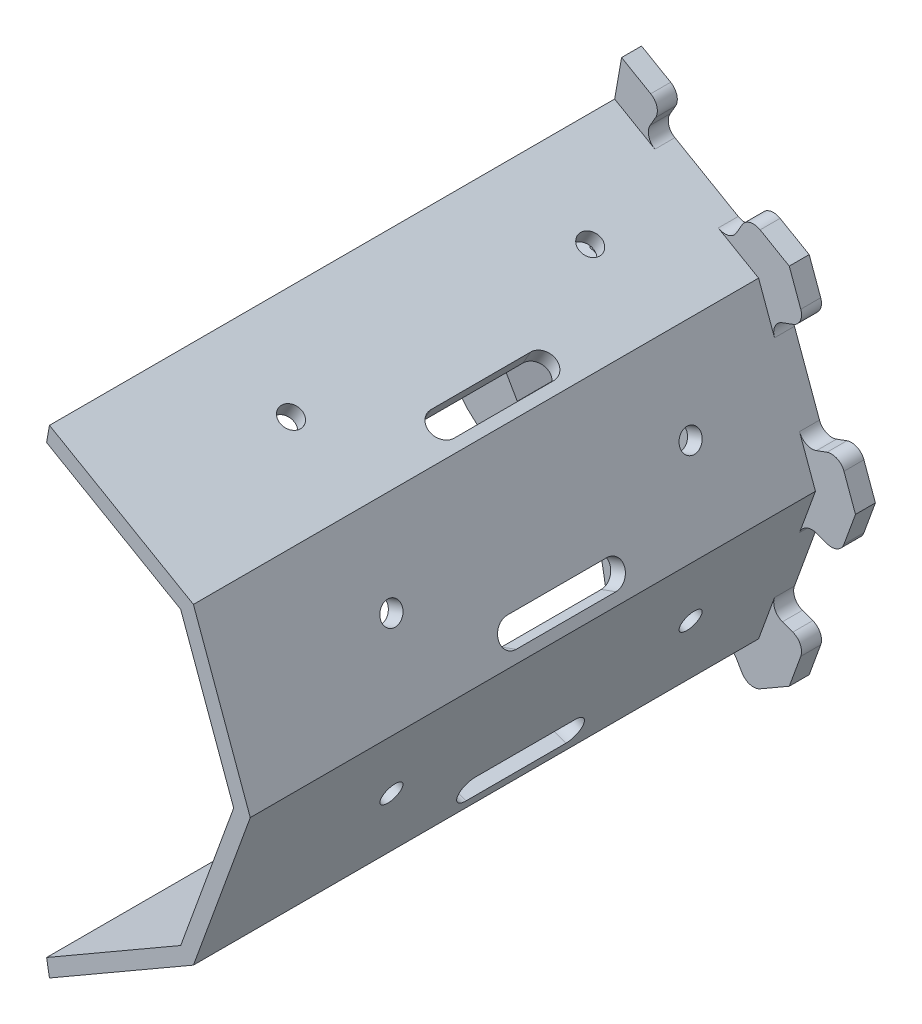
ISO-10303-21;
HEADER;
FILE_DESCRIPTION(('STEP AP214'),'2;1');
FILE_NAME('part.step','',(''),(''),'','','');
FILE_SCHEMA(('AUTOMOTIVE_DESIGN { 1 0 10303 214 1 1 1 1 }'));
ENDSEC;
DATA;
#1=APPLICATION_CONTEXT('core data for automotive mechanical design processes');
#2=APPLICATION_PROTOCOL_DEFINITION('international standard','automotive_design',2000,#1);
#3=PRODUCT_CONTEXT('',#1,'mechanical');
#4=PRODUCT('Part','Part','',(#3));
#5=PRODUCT_RELATED_PRODUCT_CATEGORY('part','',(#4));
#6=PRODUCT_DEFINITION_FORMATION('','',#4);
#7=PRODUCT_DEFINITION_CONTEXT('part definition',#1,'design');
#8=PRODUCT_DEFINITION('design','',#6,#7);
#9=PRODUCT_DEFINITION_SHAPE('','',#8);
#10=(LENGTH_UNIT() NAMED_UNIT(*) SI_UNIT(.MILLI.,.METRE.));
#11=(NAMED_UNIT(*) PLANE_ANGLE_UNIT() SI_UNIT($,.RADIAN.));
#12=(NAMED_UNIT(*) SI_UNIT($,.STERADIAN.) SOLID_ANGLE_UNIT());
#13=UNCERTAINTY_MEASURE_WITH_UNIT(LENGTH_MEASURE(1.E-05),#10,'distance_accuracy_value','');
#14=(GEOMETRIC_REPRESENTATION_CONTEXT(3) GLOBAL_UNCERTAINTY_ASSIGNED_CONTEXT((#13)) GLOBAL_UNIT_ASSIGNED_CONTEXT((#10,
#11,#12)) REPRESENTATION_CONTEXT('',''));
#15=CARTESIAN_POINT('',(0.,0.,0.));
#16=DIRECTION('',(0.,0.,1.));
#17=DIRECTION('',(1.,0.,0.));
#18=AXIS2_PLACEMENT_3D('',#15,#16,#17);
#19=CARTESIAN_POINT('',(7.39170123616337,-41.9204208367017,-3.01));
#20=DIRECTION('',(0.98480775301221,0.17364817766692,0.));
#21=DIRECTION('',(-0.17364817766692,0.98480775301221,0.));
#22=AXIS2_PLACEMENT_3D('',#19,#20,#21);
#23=PLANE('',#22);
#24=DIRECTION('',(-0.17364817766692,0.98480775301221,0.));
#25=VECTOR('',#24,1.);
#26=CARTESIAN_POINT('',(0.,0.,85.));
#27=LINE('',#26,#25);
#28=CARTESIAN_POINT('',(6.34641632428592,-35.9923155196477,85.));
#29=VERTEX_POINT('',#28);
#30=CARTESIAN_POINT('',(5.91336098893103,-33.5363366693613,85.));
#31=VERTEX_POINT('',#30);
#32=EDGE_CURVE('E1175',#29,#31,#27,.T.);
#33=ORIENTED_EDGE('',*,*,#32,.T.);
#34=DIRECTION('',(0.,0.,1.));
#35=VECTOR('',#34,1.);
#36=CARTESIAN_POINT('',(5.91336098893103,-33.5363366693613,0.));
#37=LINE('',#36,#35);
#38=CARTESIAN_POINT('',(5.91336098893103,-33.5363366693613,0.));
#39=VERTEX_POINT('',#38);
#40=EDGE_CURVE('E996',#39,#31,#37,.T.);
#41=ORIENTED_EDGE('',*,*,#40,.F.);
#42=DIRECTION('',(0.17364817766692,-0.98480775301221,0.));
#43=VECTOR('',#42,1.);
#44=CARTESIAN_POINT('',(0.,0.,0.));
#45=LINE('',#44,#43);
#46=CARTESIAN_POINT('',(2.60472266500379,-14.7721162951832,0.));
#47=VERTEX_POINT('',#46);
#48=EDGE_CURVE('E653',#47,#39,#45,.T.);
#49=ORIENTED_EDGE('',*,*,#48,.F.);
#50=DIRECTION('',(0.,0.,1.));
#51=VECTOR('',#50,1.);
#52=CARTESIAN_POINT('',(2.60472266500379,-14.7721162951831,-3.01));
#53=LINE('',#52,#51);
#54=CARTESIAN_POINT('',(2.6047226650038,-14.7721162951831,-3.));
#55=VERTEX_POINT('',#54);
#56=EDGE_CURVE('E639',#55,#47,#53,.T.);
#57=ORIENTED_EDGE('',*,*,#56,.F.);
#58=DIRECTION('',(0.17364817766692,-0.98480775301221,0.));
#59=VECTOR('',#58,1.);
#60=CARTESIAN_POINT('',(0.,0.,-3.));
#61=LINE('',#60,#59);
#62=CARTESIAN_POINT('',(7.39170123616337,-41.9204208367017,-3.));
#63=VERTEX_POINT('',#62);
#64=EDGE_CURVE('E634',#55,#63,#61,.T.);
#65=ORIENTED_EDGE('',*,*,#64,.T.);
#66=DIRECTION('',(0.,0.,1.));
#67=VECTOR('',#66,1.);
#68=CARTESIAN_POINT('',(7.39170123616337,-41.9204208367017,-3.));
#69=LINE('',#68,#67);
#70=CARTESIAN_POINT('',(7.39170123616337,-41.9204208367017,0.));
#71=VERTEX_POINT('',#70);
#72=EDGE_CURVE('E635',#63,#71,#69,.T.);
#73=ORIENTED_EDGE('',*,*,#72,.T.);
#74=DIRECTION('',(0.17364817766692,-0.98480775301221,0.));
#75=VECTOR('',#74,1.);
#76=CARTESIAN_POINT('',(0.,0.,0.));
#77=LINE('',#76,#75);
#78=CARTESIAN_POINT('',(6.34641632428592,-35.9923155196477,0.));
#79=VERTEX_POINT('',#78);
#80=EDGE_CURVE('E947',#79,#71,#77,.T.);
#81=ORIENTED_EDGE('',*,*,#80,.F.);
#82=DIRECTION('',(0.,0.,-1.));
#83=VECTOR('',#82,1.);
#84=CARTESIAN_POINT('',(6.34641632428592,-35.9923155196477,85.));
#85=LINE('',#84,#83);
#86=EDGE_CURVE('E961',#29,#79,#85,.T.);
#87=ORIENTED_EDGE('',*,*,#86,.F.);
#88=EDGE_LOOP('',(#33,#41,#49,#57,#65,#73,#81,#87));
#89=FACE_BOUND('',#88,.T.);
#90=ADVANCED_FACE('F36',(#89),#23,.F.);
#91=CARTESIAN_POINT('',(6.34641632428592,35.9923155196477,-3.01));
#92=DIRECTION('',(-0.984807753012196,0.173648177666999,0.));
#93=DIRECTION('',(-0.173648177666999,-0.984807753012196,0.));
#94=AXIS2_PLACEMENT_3D('',#91,#92,#93);
#95=PLANE('',#94);
#96=DIRECTION('',(-0.173648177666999,-0.984807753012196,0.));
#97=VECTOR('',#96,1.);
#98=CARTESIAN_POINT('',(-2.48396871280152E-12,4.37990703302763E-13,85.));
#99=LINE('',#98,#97);
#100=CARTESIAN_POINT('',(6.34641632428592,35.9923155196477,85.));
#101=VERTEX_POINT('',#100);
#102=CARTESIAN_POINT('',(5.91336098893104,33.5363366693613,85.));
#103=VERTEX_POINT('',#102);
#104=EDGE_CURVE('E958',#101,#103,#99,.T.);
#105=ORIENTED_EDGE('',*,*,#104,.F.);
#106=DIRECTION('',(0.,0.,-1.));
#107=VECTOR('',#106,1.);
#108=CARTESIAN_POINT('',(6.34641632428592,35.9923155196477,85.));
#109=LINE('',#108,#107);
#110=CARTESIAN_POINT('',(6.34641632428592,35.9923155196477,0.));
#111=VERTEX_POINT('',#110);
#112=EDGE_CURVE('E1177',#101,#111,#109,.T.);
#113=ORIENTED_EDGE('',*,*,#112,.T.);
#114=DIRECTION('',(0.173648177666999,0.984807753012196,0.));
#115=VECTOR('',#114,1.);
#116=CARTESIAN_POINT('',(-2.48396871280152E-12,4.37990703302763E-13,0.));
#117=LINE('',#116,#115);
#118=CARTESIAN_POINT('',(7.39170123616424,41.9204208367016,0.));
#119=VERTEX_POINT('',#118);
#120=EDGE_CURVE('E944',#111,#119,#117,.T.);
#121=ORIENTED_EDGE('',*,*,#120,.T.);
#122=DIRECTION('',(0.,0.,1.));
#123=VECTOR('',#122,1.);
#124=CARTESIAN_POINT('',(7.39170123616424,41.9204208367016,-3.));
#125=LINE('',#124,#123);
#126=CARTESIAN_POINT('',(7.39170123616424,41.9204208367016,-3.));
#127=VERTEX_POINT('',#126);
#128=EDGE_CURVE('E799',#127,#119,#125,.T.);
#129=ORIENTED_EDGE('',*,*,#128,.F.);
#130=DIRECTION('',(0.173648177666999,0.984807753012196,0.));
#131=VECTOR('',#130,1.);
#132=CARTESIAN_POINT('',(-2.48396871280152E-12,4.37990703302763E-13,-3.));
#133=LINE('',#132,#131);
#134=CARTESIAN_POINT('',(2.60472266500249,14.7721162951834,-3.));
#135=VERTEX_POINT('',#134);
#136=EDGE_CURVE('E620',#135,#127,#133,.T.);
#137=ORIENTED_EDGE('',*,*,#136,.F.);
#138=DIRECTION('',(0.,0.,1.));
#139=VECTOR('',#138,1.);
#140=CARTESIAN_POINT('',(2.60472266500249,14.7721162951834,-3.01));
#141=LINE('',#140,#139);
#142=CARTESIAN_POINT('',(2.6047226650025,14.7721162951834,0.));
#143=VERTEX_POINT('',#142);
#144=EDGE_CURVE('E613',#135,#143,#141,.T.);
#145=ORIENTED_EDGE('',*,*,#144,.T.);
#146=DIRECTION('',(0.173648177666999,0.984807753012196,0.));
#147=VECTOR('',#146,1.);
#148=CARTESIAN_POINT('',(-2.48396871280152E-12,4.37990703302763E-13,0.));
#149=LINE('',#148,#147);
#150=CARTESIAN_POINT('',(5.91336098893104,33.5363366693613,0.));
#151=VERTEX_POINT('',#150);
#152=EDGE_CURVE('E617',#143,#151,#149,.T.);
#153=ORIENTED_EDGE('',*,*,#152,.T.);
#154=DIRECTION('',(0.,0.,1.));
#155=VECTOR('',#154,1.);
#156=CARTESIAN_POINT('',(5.91336098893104,33.5363366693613,0.));
#157=LINE('',#156,#155);
#158=EDGE_CURVE('E40',#151,#103,#157,.T.);
#159=ORIENTED_EDGE('',*,*,#158,.T.);
#160=EDGE_LOOP('',(#105,#113,#121,#129,#137,#145,#153,#159));
#161=FACE_BOUND('',#160,.T.);
#162=ADVANCED_FACE('F38',(#161),#95,.T.);
#163=CARTESIAN_POINT('',(27.9970514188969,-23.4923155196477,85.));
#164=DIRECTION('',(-0.939692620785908,0.342020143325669,0.));
#165=DIRECTION('',(-0.342020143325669,-0.939692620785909,0.));
#166=AXIS2_PLACEMENT_3D('',#163,#164,#165);
#167=PLANE('',#166);
#168=DIRECTION('',(0.,0.,-1.));
#169=VECTOR('',#168,1.);
#170=CARTESIAN_POINT('',(28.5100816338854,-22.0827765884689,44.5));
#171=LINE('',#170,#169);
#172=CARTESIAN_POINT('',(28.5100816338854,-22.0827765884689,44.5));
#173=VERTEX_POINT('',#172);
#174=CARTESIAN_POINT('',(28.5100816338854,-22.0827765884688,29.5));
#175=VERTEX_POINT('',#174);
#176=EDGE_CURVE('E1136',#173,#175,#171,.T.);
#177=ORIENTED_EDGE('',*,*,#176,.F.);
#178=CARTESIAN_POINT('',(29.1941219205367,-20.203391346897,44.5));
#179=DIRECTION('',(0.939692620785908,-0.342020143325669,0.));
#180=DIRECTION('',(0.342020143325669,0.939692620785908,0.));
#181=AXIS2_PLACEMENT_3D('',#178,#179,#180);
#182=CIRCLE('',#181,2.);
#183=CARTESIAN_POINT('',(29.8781622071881,-18.3240061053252,44.5));
#184=VERTEX_POINT('',#183);
#185=EDGE_CURVE('E1139',#184,#173,#182,.T.);
#186=ORIENTED_EDGE('',*,*,#185,.F.);
#187=DIRECTION('',(0.,0.,1.));
#188=VECTOR('',#187,1.);
#189=CARTESIAN_POINT('',(29.8781622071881,-18.3240061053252,44.5));
#190=LINE('',#189,#188);
#191=CARTESIAN_POINT('',(29.8781622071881,-18.3240061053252,29.5));
#192=VERTEX_POINT('',#191);
#193=EDGE_CURVE('E1125',#192,#184,#190,.T.);
#194=ORIENTED_EDGE('',*,*,#193,.F.);
#195=CARTESIAN_POINT('',(29.1941219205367,-20.203391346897,29.5));
#196=DIRECTION('',(0.939692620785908,-0.342020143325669,0.));
#197=DIRECTION('',(0.342020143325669,0.939692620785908,0.));
#198=AXIS2_PLACEMENT_3D('',#195,#196,#197);
#199=CIRCLE('',#198,2.);
#200=EDGE_CURVE('E1133',#175,#192,#199,.T.);
#201=ORIENTED_EDGE('',*,*,#200,.F.);
#202=EDGE_LOOP('',(#177,#186,#194,#201));
#203=FACE_BOUND('',#202,.T.);
#204=CARTESIAN_POINT('',(32.2723032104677,-11.7461577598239,14.5));
#205=DIRECTION('',(0.939692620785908,-0.342020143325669,0.));
#206=DIRECTION('',(0.342020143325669,0.939692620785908,0.));
#207=AXIS2_PLACEMENT_3D('',#204,#205,#206);
#208=CIRCLE('',#207,1.65);
#209=CARTESIAN_POINT('',(32.8366364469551,-10.1956649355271,14.5));
#210=VERTEX_POINT('',#209);
#211=EDGE_CURVE('E1037',#210,#210,#208,.T.);
#212=ORIENTED_EDGE('',*,*,#211,.F.);
#213=EDGE_LOOP('',(#212));
#214=FACE_BOUND('',#213,.T.);
#215=CARTESIAN_POINT('',(32.2723032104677,-11.7461577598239,59.5));
#216=DIRECTION('',(0.939692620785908,-0.342020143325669,0.));
#217=DIRECTION('',(0.342020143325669,0.939692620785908,0.));
#218=AXIS2_PLACEMENT_3D('',#215,#216,#217);
#219=CIRCLE('',#218,1.65);
#220=CARTESIAN_POINT('',(32.8366364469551,-10.1956649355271,59.5));
#221=VERTEX_POINT('',#220);
#222=EDGE_CURVE('E1036',#221,#221,#219,.T.);
#223=ORIENTED_EDGE('',*,*,#222,.F.);
#224=EDGE_LOOP('',(#223));
#225=FACE_BOUND('',#224,.T.);
#226=DIRECTION('',(0.342020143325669,0.939692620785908,0.));
#227=VECTOR('',#226,1.);
#228=CARTESIAN_POINT('',(27.9970514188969,-23.4923155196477,0.));
#229=LINE('',#228,#227);
#230=CARTESIAN_POINT('',(27.9970514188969,-23.4923155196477,0.));
#231=VERTEX_POINT('',#230);
#232=CARTESIAN_POINT('',(30.3911924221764,-16.9144671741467,0.));
#233=VERTEX_POINT('',#232);
#234=EDGE_CURVE('E979',#231,#233,#229,.T.);
#235=ORIENTED_EDGE('',*,*,#234,.T.);
#236=DIRECTION('',(0.,0.,1.));
#237=VECTOR('',#236,1.);
#238=CARTESIAN_POINT('',(30.3911924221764,-16.9144671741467,-3.));
#239=LINE('',#238,#237);
#240=CARTESIAN_POINT('',(30.3911924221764,-16.9144671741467,-3.));
#241=VERTEX_POINT('',#240);
#242=EDGE_CURVE('E709',#233,#241,#239,.F.);
#243=ORIENTED_EDGE('',*,*,#242,.T.);
#244=DIRECTION('',(-0.342020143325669,-0.939692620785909,0.));
#245=VECTOR('',#244,1.);
#246=CARTESIAN_POINT('',(29.7071521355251,-18.7938524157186,-3.));
#247=LINE('',#246,#245);
#248=CARTESIAN_POINT('',(34.1534139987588,-6.57784834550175,-3.));
#249=VERTEX_POINT('',#248);
#250=EDGE_CURVE('E915',#249,#241,#247,.T.);
#251=ORIENTED_EDGE('',*,*,#250,.F.);
#252=DIRECTION('',(0.,0.,1.));
#253=VECTOR('',#252,1.);
#254=CARTESIAN_POINT('',(34.1534139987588,-6.57784834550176,0.));
#255=LINE('',#254,#253);
#256=CARTESIAN_POINT('',(34.1534139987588,-6.57784834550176,0.));
#257=VERTEX_POINT('',#256);
#258=EDGE_CURVE('E711',#249,#257,#255,.T.);
#259=ORIENTED_EDGE('',*,*,#258,.T.);
#260=CARTESIAN_POINT('',(36.5475550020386,0.,0.));
#261=VERTEX_POINT('',#260);
#262=EDGE_CURVE('E982',#257,#261,#229,.T.);
#263=ORIENTED_EDGE('',*,*,#262,.T.);
#264=DIRECTION('',(0.,0.,-1.));
#265=VECTOR('',#264,1.);
#266=CARTESIAN_POINT('',(36.5475550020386,0.,85.));
#267=LINE('',#266,#265);
#268=CARTESIAN_POINT('',(36.5475550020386,0.,85.));
#269=VERTEX_POINT('',#268);
#270=EDGE_CURVE('E954',#269,#261,#267,.T.);
#271=ORIENTED_EDGE('',*,*,#270,.F.);
#272=DIRECTION('',(0.342020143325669,0.939692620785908,0.));
#273=VECTOR('',#272,1.);
#274=CARTESIAN_POINT('',(27.9970514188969,-23.4923155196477,85.));
#275=LINE('',#274,#273);
#276=CARTESIAN_POINT('',(27.9970514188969,-23.4923155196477,85.));
#277=VERTEX_POINT('',#276);
#278=EDGE_CURVE('E970',#277,#269,#275,.T.);
#279=ORIENTED_EDGE('',*,*,#278,.F.);
#280=DIRECTION('',(0.,0.,-1.));
#281=VECTOR('',#280,1.);
#282=CARTESIAN_POINT('',(27.9970514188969,-23.4923155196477,85.));
#283=LINE('',#282,#281);
#284=EDGE_CURVE('E962',#277,#231,#283,.T.);
#285=ORIENTED_EDGE('',*,*,#284,.T.);
#286=EDGE_LOOP('',(#235,#243,#251,#259,#263,#271,#279,#285));
#287=FACE_BOUND('',#286,.T.);
#288=ADVANCED_FACE('F1308',(#203,#214,#225,#287),#167,.F.);
#289=CARTESIAN_POINT('',(27.9970514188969,23.4923155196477,85.));
#290=DIRECTION('',(-0.5,-0.866025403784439,0.));
#291=DIRECTION('',(0.866025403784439,-0.5,0.));
#292=AXIS2_PLACEMENT_3D('',#289,#290,#291);
#293=PLANE('',#292);
#294=CARTESIAN_POINT('',(24.9659625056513,25.2423155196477,29.5));
#295=DIRECTION('',(0.5,0.866025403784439,0.));
#296=DIRECTION('',(-0.866025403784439,0.5,0.));
#297=AXIS2_PLACEMENT_3D('',#294,#295,#296);
#298=CIRCLE('',#297,2.);
#299=CARTESIAN_POINT('',(26.6980133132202,24.2423155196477,29.5));
#300=VERTEX_POINT('',#299);
#301=CARTESIAN_POINT('',(23.2339116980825,26.2423155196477,29.5));
#302=VERTEX_POINT('',#301);
#303=EDGE_CURVE('E1082',#300,#302,#298,.T.);
#304=ORIENTED_EDGE('',*,*,#303,.F.);
#305=DIRECTION('',(0.,0.,-1.));
#306=VECTOR('',#305,1.);
#307=CARTESIAN_POINT('',(26.6980133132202,24.2423155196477,44.5));
#308=LINE('',#307,#306);
#309=CARTESIAN_POINT('',(26.6980133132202,24.2423155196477,44.5));
#310=VERTEX_POINT('',#309);
#311=EDGE_CURVE('E1079',#310,#300,#308,.T.);
#312=ORIENTED_EDGE('',*,*,#311,.F.);
#313=CARTESIAN_POINT('',(24.9659625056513,25.2423155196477,44.5));
#314=DIRECTION('',(0.5,0.866025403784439,0.));
#315=DIRECTION('',(-0.866025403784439,0.5,0.));
#316=AXIS2_PLACEMENT_3D('',#313,#314,#315);
#317=CIRCLE('',#316,2.);
#318=CARTESIAN_POINT('',(23.2339116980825,26.2423155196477,44.5));
#319=VERTEX_POINT('',#318);
#320=EDGE_CURVE('E1070',#319,#310,#317,.T.);
#321=ORIENTED_EDGE('',*,*,#320,.F.);
#322=DIRECTION('',(0.,0.,1.));
#323=VECTOR('',#322,1.);
#324=CARTESIAN_POINT('',(23.2339116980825,26.2423155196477,44.5));
#325=LINE('',#324,#323);
#326=EDGE_CURVE('E1061',#302,#319,#325,.T.);
#327=ORIENTED_EDGE('',*,*,#326,.F.);
#328=EDGE_LOOP('',(#304,#312,#321,#327));
#329=FACE_BOUND('',#328,.T.);
#330=CARTESIAN_POINT('',(17.1717338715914,29.7423155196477,14.5));
#331=DIRECTION('',(0.5,0.866025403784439,0.));
#332=DIRECTION('',(-0.866025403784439,0.5,0.));
#333=AXIS2_PLACEMENT_3D('',#330,#331,#332);
#334=CIRCLE('',#333,1.65);
#335=CARTESIAN_POINT('',(15.7427919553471,30.5673155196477,14.5));
#336=VERTEX_POINT('',#335);
#337=EDGE_CURVE('E1008',#336,#336,#334,.T.);
#338=ORIENTED_EDGE('',*,*,#337,.F.);
#339=EDGE_LOOP('',(#338));
#340=FACE_BOUND('',#339,.T.);
#341=CARTESIAN_POINT('',(17.1717338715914,29.7423155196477,59.5));
#342=DIRECTION('',(0.5,0.866025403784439,0.));
#343=DIRECTION('',(-0.866025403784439,0.5,0.));
#344=AXIS2_PLACEMENT_3D('',#341,#342,#343);
#345=CIRCLE('',#344,1.65);
#346=CARTESIAN_POINT('',(15.7427919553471,30.5673155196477,59.5));
#347=VERTEX_POINT('',#346);
#348=EDGE_CURVE('E1009',#347,#347,#345,.T.);
#349=ORIENTED_EDGE('',*,*,#348,.F.);
#350=EDGE_LOOP('',(#349));
#351=FACE_BOUND('',#350,.T.);
#352=DIRECTION('',(-0.866025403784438,0.5,0.));
#353=VECTOR('',#352,1.);
#354=CARTESIAN_POINT('',(27.9970514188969,23.4923155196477,0.));
#355=LINE('',#354,#353);
#356=CARTESIAN_POINT('',(27.9970514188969,23.4923155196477,0.));
#357=VERTEX_POINT('',#356);
#358=CARTESIAN_POINT('',(21.9348735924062,26.9923155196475,0.));
#359=VERTEX_POINT('',#358);
#360=EDGE_CURVE('E971',#357,#359,#355,.T.);
#361=ORIENTED_EDGE('',*,*,#360,.T.);
#362=DIRECTION('',(0.,0.,1.));
#363=VECTOR('',#362,1.);
#364=CARTESIAN_POINT('',(21.9348735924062,26.9923155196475,-3.));
#365=LINE('',#364,#363);
#366=CARTESIAN_POINT('',(21.9348735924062,26.9923155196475,-3.));
#367=VERTEX_POINT('',#366);
#368=EDGE_CURVE('E774',#359,#367,#365,.F.);
#369=ORIENTED_EDGE('',*,*,#368,.T.);
#370=DIRECTION('',(0.866025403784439,-0.5,0.));
#371=VECTOR('',#370,1.);
#372=CARTESIAN_POINT('',(23.666924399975,25.9923155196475,-3.));
#373=LINE('',#372,#371);
#374=CARTESIAN_POINT('',(12.4085941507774,32.4923155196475,-3.));
#375=VERTEX_POINT('',#374);
#376=EDGE_CURVE('E885',#375,#367,#373,.T.);
#377=ORIENTED_EDGE('',*,*,#376,.F.);
#378=DIRECTION('',(0.,0.,1.));
#379=VECTOR('',#378,1.);
#380=CARTESIAN_POINT('',(12.4085941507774,32.4923155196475,0.));
#381=LINE('',#380,#379);
#382=CARTESIAN_POINT('',(12.4085941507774,32.4923155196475,0.));
#383=VERTEX_POINT('',#382);
#384=EDGE_CURVE('E776',#375,#383,#381,.T.);
#385=ORIENTED_EDGE('',*,*,#384,.T.);
#386=EDGE_CURVE('E974',#383,#111,#355,.T.);
#387=ORIENTED_EDGE('',*,*,#386,.T.);
#388=ORIENTED_EDGE('',*,*,#112,.F.);
#389=DIRECTION('',(-0.866025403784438,0.5,0.));
#390=VECTOR('',#389,1.);
#391=CARTESIAN_POINT('',(27.9970514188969,23.4923155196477,85.));
#392=LINE('',#391,#390);
#393=CARTESIAN_POINT('',(27.9970514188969,23.4923155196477,85.));
#394=VERTEX_POINT('',#393);
#395=EDGE_CURVE('E984',#394,#101,#392,.T.);
#396=ORIENTED_EDGE('',*,*,#395,.F.);
#397=DIRECTION('',(0.,0.,-1.));
#398=VECTOR('',#397,1.);
#399=CARTESIAN_POINT('',(27.9970514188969,23.4923155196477,85.));
#400=LINE('',#399,#398);
#401=EDGE_CURVE('E957',#394,#357,#400,.T.);
#402=ORIENTED_EDGE('',*,*,#401,.T.);
#403=EDGE_LOOP('',(#361,#369,#377,#385,#387,#388,#396,#402));
#404=FACE_BOUND('',#403,.T.);
#405=ADVANCED_FACE('F1191',(#329,#340,#351,#404),#293,.F.);
#406=CARTESIAN_POINT('',(-24.1716797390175,41.8665774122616,59.5));
#407=DIRECTION('',(0.5,-0.866025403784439,0.));
#408=DIRECTION('',(0.866025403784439,0.5,0.));
#409=AXIS2_PLACEMENT_3D('',#406,#407,#408);
#410=CYLINDRICAL_SURFACE('',#409,1.65);
#411=CARTESIAN_POINT('',(17.1717338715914,-29.7423155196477,59.5));
#412=DIRECTION('',(0.5,-0.866025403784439,0.));
#413=DIRECTION('',(0.866025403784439,0.5,0.));
#414=AXIS2_PLACEMENT_3D('',#411,#412,#413);
#415=CIRCLE('',#414,1.65);
#416=CARTESIAN_POINT('',(18.6006757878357,-28.9173155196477,59.5));
#417=VERTEX_POINT('',#416);
#418=EDGE_CURVE('E1048',#417,#417,#415,.T.);
#419=CARTESIAN_POINT('',(16.,-27.712812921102,59.5));
#420=DIRECTION('',(0.5,-0.866025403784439,0.));
#421=DIRECTION('',(0.866025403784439,0.5,0.));
#422=AXIS2_PLACEMENT_3D('',#419,#420,#421);
#423=CIRCLE('',#422,1.65);
#424=CARTESIAN_POINT('',(17.4289419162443,-26.887812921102,59.5));
#425=VERTEX_POINT('',#424);
#426=EDGE_CURVE('E1045',#425,#425,#423,.F.);
#427=CARTESIAN_POINT('',(18.6006757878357,-28.9173155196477,59.5));
#428=CARTESIAN_POINT('',(18.5884702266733,-28.8961748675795,59.5));
#429=CARTESIAN_POINT('',(18.5762646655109,-28.8750342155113,59.5));
#430=CARTESIAN_POINT('',(18.5518535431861,-28.832752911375,59.5));
#431=CARTESIAN_POINT('',(18.5396479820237,-28.8116122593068,59.5));
#432=CARTESIAN_POINT('',(18.5152368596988,-28.7693309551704,59.5));
#433=CARTESIAN_POINT('',(18.5030312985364,-28.7481903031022,59.5));
#434=CARTESIAN_POINT('',(18.4786201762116,-28.7059089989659,59.5));
#435=CARTESIAN_POINT('',(18.4664146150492,-28.6847683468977,59.5));
#436=CARTESIAN_POINT('',(18.4420034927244,-28.6424870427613,59.5));
#437=CARTESIAN_POINT('',(18.429797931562,-28.6213463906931,59.5));
#438=CARTESIAN_POINT('',(18.4053868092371,-28.5790650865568,59.5));
#439=CARTESIAN_POINT('',(18.3931812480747,-28.5579244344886,59.5));
#440=CARTESIAN_POINT('',(18.3687701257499,-28.5156431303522,59.5));
#441=CARTESIAN_POINT('',(18.3565645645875,-28.494502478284,59.5));
#442=CARTESIAN_POINT('',(18.3321534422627,-28.4522211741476,59.5));
#443=CARTESIAN_POINT('',(18.3199478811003,-28.4310805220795,59.5));
#444=CARTESIAN_POINT('',(18.2955367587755,-28.3887992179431,59.5));
#445=CARTESIAN_POINT('',(18.283331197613,-28.3676585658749,59.5));
#446=CARTESIAN_POINT('',(18.2589200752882,-28.3253772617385,59.5));
#447=CARTESIAN_POINT('',(18.2467145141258,-28.3042366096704,59.5));
#448=CARTESIAN_POINT('',(18.222303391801,-28.261955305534,59.5));
#449=CARTESIAN_POINT('',(18.2100978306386,-28.2408146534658,59.5));
#450=CARTESIAN_POINT('',(18.1856867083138,-28.1985333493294,59.5));
#451=CARTESIAN_POINT('',(18.1734811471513,-28.1773926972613,59.5));
#452=CARTESIAN_POINT('',(18.1490700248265,-28.1351113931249,59.5));
#453=CARTESIAN_POINT('',(18.1368644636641,-28.1139707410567,59.5));
#454=CARTESIAN_POINT('',(18.1124533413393,-28.0716894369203,59.5));
#455=CARTESIAN_POINT('',(18.1002477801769,-28.0505487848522,59.5));
#456=CARTESIAN_POINT('',(18.0758366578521,-28.0082674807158,59.5));
#457=CARTESIAN_POINT('',(18.0636310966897,-27.9871268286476,59.5));
#458=CARTESIAN_POINT('',(18.0392199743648,-27.9448455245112,59.5));
#459=CARTESIAN_POINT('',(18.0270144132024,-27.9237048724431,59.5));
#460=CARTESIAN_POINT('',(18.0026032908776,-27.8814235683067,59.5));
#461=CARTESIAN_POINT('',(17.9903977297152,-27.8602829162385,59.5));
#462=CARTESIAN_POINT('',(17.9659866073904,-27.8180016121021,59.5));
#463=CARTESIAN_POINT('',(17.953781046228,-27.7968609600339,59.5));
#464=CARTESIAN_POINT('',(17.9293699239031,-27.7545796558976,59.5));
#465=CARTESIAN_POINT('',(17.9171643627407,-27.7334390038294,59.5));
#466=CARTESIAN_POINT('',(17.8927532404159,-27.691157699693,59.5));
#467=CARTESIAN_POINT('',(17.8805476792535,-27.6700170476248,59.5));
#468=CARTESIAN_POINT('',(17.8561365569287,-27.6277357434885,59.5));
#469=CARTESIAN_POINT('',(17.8439309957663,-27.6065950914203,59.5));
#470=CARTESIAN_POINT('',(17.8195198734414,-27.5643137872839,59.5));
#471=CARTESIAN_POINT('',(17.807314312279,-27.5431731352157,59.5));
#472=CARTESIAN_POINT('',(17.7829031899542,-27.5008918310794,59.5));
#473=CARTESIAN_POINT('',(17.7706976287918,-27.4797511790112,59.5));
#474=CARTESIAN_POINT('',(17.746286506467,-27.4374698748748,59.5));
#475=CARTESIAN_POINT('',(17.7340809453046,-27.4163292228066,59.5));
#476=CARTESIAN_POINT('',(17.7096698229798,-27.3740479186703,59.5));
#477=CARTESIAN_POINT('',(17.6974642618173,-27.3529072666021,59.5));
#478=CARTESIAN_POINT('',(17.6730531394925,-27.3106259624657,59.5));
#479=CARTESIAN_POINT('',(17.6608475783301,-27.2894853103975,59.5));
#480=CARTESIAN_POINT('',(17.6364364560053,-27.2472040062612,59.5));
#481=CARTESIAN_POINT('',(17.6242308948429,-27.226063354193,59.5));
#482=CARTESIAN_POINT('',(17.5998197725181,-27.1837820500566,59.5));
#483=CARTESIAN_POINT('',(17.5876142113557,-27.1626413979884,59.5));
#484=CARTESIAN_POINT('',(17.5632030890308,-27.1203600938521,59.5));
#485=CARTESIAN_POINT('',(17.5509975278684,-27.0992194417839,59.5));
#486=CARTESIAN_POINT('',(17.5265864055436,-27.0569381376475,59.5));
#487=CARTESIAN_POINT('',(17.5143808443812,-27.0357974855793,59.5));
#488=CARTESIAN_POINT('',(17.4899697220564,-26.993516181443,59.5));
#489=CARTESIAN_POINT('',(17.477764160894,-26.9723755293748,59.5));
#490=CARTESIAN_POINT('',(17.4533530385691,-26.9300942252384,59.5));
#491=CARTESIAN_POINT('',(17.4411474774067,-26.9089535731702,59.5));
#492=CARTESIAN_POINT('',(17.4289419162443,-26.887812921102,59.5));
#493=B_SPLINE_CURVE_WITH_KNOTS('',3,(#427,#428,#429,#430,#431,#432,#433,#434,#435,#436,#437,
#438,#439,#440,#441,#442,#443,#444,#445,#446,#447,#448,#449,#450,#451,#452,#453,#454,#455,#456,
#457,#458,#459,#460,#461,#462,#463,#464,#465,#466,#467,#468,#469,#470,#471,#472,#473,#474,#475,
#476,#477,#478,#479,#480,#481,#482,#483,#484,#485,#486,#487,#488,#489,#490,#491,#492),
.UNSPECIFIED.,.F.,.F.,(4,2,2,2,2,2,2,2,2,2,2,2,2,2,2,2,2,2,2,2,2,2,2,2,2,2,2,2,2,2,2,2,4),(0.,
0.0732333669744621,0.146466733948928,0.21970010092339,0.292933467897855,0.366166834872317,
0.439400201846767,0.512633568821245,0.585866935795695,0.659100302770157,0.732333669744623,
0.805567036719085,0.878800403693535,0.952033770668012,1.02526713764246,1.09850050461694,
1.17173387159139,1.24496723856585,1.31820060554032,1.39143397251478,1.46466733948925,
1.53790070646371,1.61113407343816,1.68436744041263,1.75760080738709,1.83083417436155,
1.90406754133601,1.97730090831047,2.05053427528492,2.1237676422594,2.19700100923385,
2.27023437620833,2.34346774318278),.UNSPECIFIED.);
#494=EDGE_CURVE('BSEAM1469',#417,#425,#493,.T.);
#495=ORIENTED_EDGE('',*,*,#418,.T.);
#496=ORIENTED_EDGE('',*,*,#426,.T.);
#497=ORIENTED_EDGE('',*,*,#494,.T.);
#498=ORIENTED_EDGE('',*,*,#494,.F.);
#499=EDGE_LOOP('',(#495,#497,#496,#498));
#500=FACE_BOUND('',#499,.T.);
#501=ADVANCED_FACE('F1469',(#500),#410,.F.);
#502=CARTESIAN_POINT('',(-24.1716797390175,41.8665774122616,14.5));
#503=DIRECTION('',(0.5,-0.866025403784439,0.));
#504=DIRECTION('',(0.866025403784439,0.5,0.));
#505=AXIS2_PLACEMENT_3D('',#502,#503,#504);
#506=CYLINDRICAL_SURFACE('',#505,1.65);
#507=CARTESIAN_POINT('',(17.1717338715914,-29.7423155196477,14.5));
#508=DIRECTION('',(0.5,-0.866025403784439,0.));
#509=DIRECTION('',(0.866025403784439,0.5,0.));
#510=AXIS2_PLACEMENT_3D('',#507,#508,#509);
#511=CIRCLE('',#510,1.65);
#512=CARTESIAN_POINT('',(18.6006757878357,-28.9173155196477,14.5));
#513=VERTEX_POINT('',#512);
#514=EDGE_CURVE('E1049',#513,#513,#511,.T.);
#515=CARTESIAN_POINT('',(16.,-27.712812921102,14.5));
#516=DIRECTION('',(0.5,-0.866025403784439,0.));
#517=DIRECTION('',(0.866025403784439,0.5,0.));
#518=AXIS2_PLACEMENT_3D('',#515,#516,#517);
#519=CIRCLE('',#518,1.65);
#520=CARTESIAN_POINT('',(17.4289419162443,-26.887812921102,14.5));
#521=VERTEX_POINT('',#520);
#522=EDGE_CURVE('E1040',#521,#521,#519,.F.);
#523=CARTESIAN_POINT('',(18.6006757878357,-28.9173155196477,14.5));
#524=CARTESIAN_POINT('',(18.5884702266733,-28.8961748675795,14.5));
#525=CARTESIAN_POINT('',(18.5762646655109,-28.8750342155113,14.5));
#526=CARTESIAN_POINT('',(18.5518535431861,-28.832752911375,14.5));
#527=CARTESIAN_POINT('',(18.5396479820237,-28.8116122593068,14.5));
#528=CARTESIAN_POINT('',(18.5152368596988,-28.7693309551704,14.5));
#529=CARTESIAN_POINT('',(18.5030312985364,-28.7481903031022,14.5));
#530=CARTESIAN_POINT('',(18.4786201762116,-28.7059089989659,14.5));
#531=CARTESIAN_POINT('',(18.4664146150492,-28.6847683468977,14.5));
#532=CARTESIAN_POINT('',(18.4420034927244,-28.6424870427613,14.5));
#533=CARTESIAN_POINT('',(18.429797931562,-28.6213463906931,14.5));
#534=CARTESIAN_POINT('',(18.4053868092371,-28.5790650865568,14.5));
#535=CARTESIAN_POINT('',(18.3931812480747,-28.5579244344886,14.5));
#536=CARTESIAN_POINT('',(18.3687701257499,-28.5156431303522,14.5));
#537=CARTESIAN_POINT('',(18.3565645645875,-28.494502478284,14.5));
#538=CARTESIAN_POINT('',(18.3321534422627,-28.4522211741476,14.5));
#539=CARTESIAN_POINT('',(18.3199478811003,-28.4310805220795,14.5));
#540=CARTESIAN_POINT('',(18.2955367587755,-28.3887992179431,14.5));
#541=CARTESIAN_POINT('',(18.283331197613,-28.3676585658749,14.5));
#542=CARTESIAN_POINT('',(18.2589200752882,-28.3253772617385,14.5));
#543=CARTESIAN_POINT('',(18.2467145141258,-28.3042366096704,14.5));
#544=CARTESIAN_POINT('',(18.222303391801,-28.261955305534,14.5));
#545=CARTESIAN_POINT('',(18.2100978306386,-28.2408146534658,14.5));
#546=CARTESIAN_POINT('',(18.1856867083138,-28.1985333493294,14.5));
#547=CARTESIAN_POINT('',(18.1734811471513,-28.1773926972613,14.5));
#548=CARTESIAN_POINT('',(18.1490700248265,-28.1351113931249,14.5));
#549=CARTESIAN_POINT('',(18.1368644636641,-28.1139707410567,14.5));
#550=CARTESIAN_POINT('',(18.1124533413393,-28.0716894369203,14.5));
#551=CARTESIAN_POINT('',(18.1002477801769,-28.0505487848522,14.5));
#552=CARTESIAN_POINT('',(18.0758366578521,-28.0082674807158,14.5));
#553=CARTESIAN_POINT('',(18.0636310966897,-27.9871268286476,14.5));
#554=CARTESIAN_POINT('',(18.0392199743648,-27.9448455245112,14.5));
#555=CARTESIAN_POINT('',(18.0270144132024,-27.9237048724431,14.5));
#556=CARTESIAN_POINT('',(18.0026032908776,-27.8814235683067,14.5));
#557=CARTESIAN_POINT('',(17.9903977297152,-27.8602829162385,14.5));
#558=CARTESIAN_POINT('',(17.9659866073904,-27.8180016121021,14.5));
#559=CARTESIAN_POINT('',(17.953781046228,-27.7968609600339,14.5));
#560=CARTESIAN_POINT('',(17.9293699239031,-27.7545796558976,14.5));
#561=CARTESIAN_POINT('',(17.9171643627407,-27.7334390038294,14.5));
#562=CARTESIAN_POINT('',(17.8927532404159,-27.691157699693,14.5));
#563=CARTESIAN_POINT('',(17.8805476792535,-27.6700170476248,14.5));
#564=CARTESIAN_POINT('',(17.8561365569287,-27.6277357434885,14.5));
#565=CARTESIAN_POINT('',(17.8439309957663,-27.6065950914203,14.5));
#566=CARTESIAN_POINT('',(17.8195198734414,-27.5643137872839,14.5));
#567=CARTESIAN_POINT('',(17.807314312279,-27.5431731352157,14.5));
#568=CARTESIAN_POINT('',(17.7829031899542,-27.5008918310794,14.5));
#569=CARTESIAN_POINT('',(17.7706976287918,-27.4797511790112,14.5));
#570=CARTESIAN_POINT('',(17.746286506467,-27.4374698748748,14.5));
#571=CARTESIAN_POINT('',(17.7340809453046,-27.4163292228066,14.5));
#572=CARTESIAN_POINT('',(17.7096698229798,-27.3740479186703,14.5));
#573=CARTESIAN_POINT('',(17.6974642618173,-27.3529072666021,14.5));
#574=CARTESIAN_POINT('',(17.6730531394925,-27.3106259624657,14.5));
#575=CARTESIAN_POINT('',(17.6608475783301,-27.2894853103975,14.5));
#576=CARTESIAN_POINT('',(17.6364364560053,-27.2472040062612,14.5));
#577=CARTESIAN_POINT('',(17.6242308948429,-27.226063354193,14.5));
#578=CARTESIAN_POINT('',(17.5998197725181,-27.1837820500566,14.5));
#579=CARTESIAN_POINT('',(17.5876142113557,-27.1626413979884,14.5));
#580=CARTESIAN_POINT('',(17.5632030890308,-27.1203600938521,14.5));
#581=CARTESIAN_POINT('',(17.5509975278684,-27.0992194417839,14.5));
#582=CARTESIAN_POINT('',(17.5265864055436,-27.0569381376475,14.5));
#583=CARTESIAN_POINT('',(17.5143808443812,-27.0357974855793,14.5));
#584=CARTESIAN_POINT('',(17.4899697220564,-26.993516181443,14.5));
#585=CARTESIAN_POINT('',(17.477764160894,-26.9723755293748,14.5));
#586=CARTESIAN_POINT('',(17.4533530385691,-26.9300942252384,14.5));
#587=CARTESIAN_POINT('',(17.4411474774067,-26.9089535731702,14.5));
#588=CARTESIAN_POINT('',(17.4289419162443,-26.887812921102,14.5));
#589=B_SPLINE_CURVE_WITH_KNOTS('',3,(#523,#524,#525,#526,#527,#528,#529,#530,#531,#532,#533,
#534,#535,#536,#537,#538,#539,#540,#541,#542,#543,#544,#545,#546,#547,#548,#549,#550,#551,#552,
#553,#554,#555,#556,#557,#558,#559,#560,#561,#562,#563,#564,#565,#566,#567,#568,#569,#570,#571,
#572,#573,#574,#575,#576,#577,#578,#579,#580,#581,#582,#583,#584,#585,#586,#587,#588),
.UNSPECIFIED.,.F.,.F.,(4,2,2,2,2,2,2,2,2,2,2,2,2,2,2,2,2,2,2,2,2,2,2,2,2,2,2,2,2,2,2,2,4),(0.,
0.0732333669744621,0.146466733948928,0.21970010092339,0.292933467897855,0.366166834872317,
0.439400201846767,0.512633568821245,0.585866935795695,0.659100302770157,0.732333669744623,
0.805567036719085,0.878800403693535,0.952033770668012,1.02526713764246,1.09850050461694,
1.17173387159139,1.24496723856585,1.31820060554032,1.39143397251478,1.46466733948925,
1.53790070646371,1.61113407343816,1.68436744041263,1.75760080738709,1.83083417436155,
1.90406754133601,1.97730090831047,2.05053427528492,2.1237676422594,2.19700100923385,
2.27023437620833,2.34346774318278),.UNSPECIFIED.);
#590=EDGE_CURVE('BSEAM1472',#513,#521,#589,.T.);
#591=ORIENTED_EDGE('',*,*,#514,.T.);
#592=ORIENTED_EDGE('',*,*,#522,.T.);
#593=ORIENTED_EDGE('',*,*,#590,.T.);
#594=ORIENTED_EDGE('',*,*,#590,.F.);
#595=EDGE_LOOP('',(#591,#593,#592,#594));
#596=FACE_BOUND('',#595,.T.);
#597=ADVANCED_FACE('F1472',(#596),#506,.F.);
#598=CARTESIAN_POINT('',(-35.9469863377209,44.2620067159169,29.5));
#599=DIRECTION('',(0.5,-0.866025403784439,0.));
#600=DIRECTION('',(0.866025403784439,0.5,0.));
#601=AXIS2_PLACEMENT_3D('',#598,#599,#600);
#602=CYLINDRICAL_SURFACE('',#601,2.);
#603=CARTESIAN_POINT('',(8.20577136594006,-32.212812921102,29.5));
#604=DIRECTION('',(0.5,-0.866025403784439,0.));
#605=DIRECTION('',(0.866025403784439,0.5,0.));
#606=AXIS2_PLACEMENT_3D('',#603,#604,#605);
#607=CIRCLE('',#606,2.);
#608=CARTESIAN_POINT('',(9.93782217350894,-31.212812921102,29.5));
#609=VERTEX_POINT('',#608);
#610=CARTESIAN_POINT('',(6.47372055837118,-33.212812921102,29.5));
#611=VERTEX_POINT('',#610);
#612=EDGE_CURVE('E11',#609,#611,#607,.F.);
#613=ORIENTED_EDGE('',*,*,#612,.T.);
#614=DIRECTION('',(0.5,-0.866025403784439,0.));
#615=VECTOR('',#614,1.);
#616=CARTESIAN_POINT('',(-37.6790371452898,43.2620067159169,29.5));
#617=LINE('',#616,#615);
#618=CARTESIAN_POINT('',(7.64545442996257,-35.2423155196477,29.5));
#619=VERTEX_POINT('',#618);
#620=EDGE_CURVE('E60',#611,#619,#617,.T.);
#621=ORIENTED_EDGE('',*,*,#620,.T.);
#622=CARTESIAN_POINT('',(9.37750523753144,-34.2423155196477,29.5));
#623=DIRECTION('',(0.5,-0.866025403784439,0.));
#624=DIRECTION('',(0.866025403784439,0.5,0.));
#625=AXIS2_PLACEMENT_3D('',#622,#623,#624);
#626=CIRCLE('',#625,2.);
#627=CARTESIAN_POINT('',(11.1095560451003,-33.2423155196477,29.5));
#628=VERTEX_POINT('',#627);
#629=EDGE_CURVE('E1160',#619,#628,#626,.T.);
#630=ORIENTED_EDGE('',*,*,#629,.T.);
#631=DIRECTION('',(0.5,-0.866025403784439,0.));
#632=VECTOR('',#631,1.);
#633=CARTESIAN_POINT('',(-34.214935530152,45.2620067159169,29.5));
#634=LINE('',#633,#632);
#635=EDGE_CURVE('E1155',#609,#628,#634,.T.);
#636=ORIENTED_EDGE('',*,*,#635,.F.);
#637=EDGE_LOOP('',(#613,#621,#630,#636));
#638=FACE_BOUND('',#637,.T.);
#639=ADVANCED_FACE('F1476',(#638),#602,.F.);
#640=CARTESIAN_POINT('',(-37.6790371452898,43.2620067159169,44.5));
#641=DIRECTION('',(-0.866025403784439,-0.5,0.));
#642=DIRECTION('',(0.5,-0.866025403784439,0.));
#643=AXIS2_PLACEMENT_3D('',#640,#641,#642);
#644=PLANE('',#643);
#645=DIRECTION('',(0.,0.,1.));
#646=VECTOR('',#645,1.);
#647=CARTESIAN_POINT('',(6.47372055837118,-33.212812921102,44.5));
#648=LINE('',#647,#646);
#649=CARTESIAN_POINT('',(6.47372055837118,-33.212812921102,44.5));
#650=VERTEX_POINT('',#649);
#651=EDGE_CURVE('E1149',#611,#650,#648,.T.);
#652=ORIENTED_EDGE('',*,*,#651,.T.);
#653=DIRECTION('',(0.5,-0.866025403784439,0.));
#654=VECTOR('',#653,1.);
#655=CARTESIAN_POINT('',(-37.6790371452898,43.2620067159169,44.5));
#656=LINE('',#655,#654);
#657=CARTESIAN_POINT('',(7.64545442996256,-35.2423155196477,44.5));
#658=VERTEX_POINT('',#657);
#659=EDGE_CURVE('E53',#650,#658,#656,.T.);
#660=ORIENTED_EDGE('',*,*,#659,.T.);
#661=DIRECTION('',(0.,0.,-1.));
#662=VECTOR('',#661,1.);
#663=CARTESIAN_POINT('',(7.64545442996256,-35.2423155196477,44.5));
#664=LINE('',#663,#662);
#665=EDGE_CURVE('E1162',#658,#619,#664,.T.);
#666=ORIENTED_EDGE('',*,*,#665,.T.);
#667=ORIENTED_EDGE('',*,*,#620,.F.);
#668=EDGE_LOOP('',(#652,#660,#666,#667));
#669=FACE_BOUND('',#668,.T.);
#670=ADVANCED_FACE('F1523',(#669),#644,.F.);
#671=CARTESIAN_POINT('',(-35.9469863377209,44.2620067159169,44.5));
#672=DIRECTION('',(0.5,-0.866025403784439,0.));
#673=DIRECTION('',(0.866025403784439,0.5,0.));
#674=AXIS2_PLACEMENT_3D('',#671,#672,#673);
#675=CYLINDRICAL_SURFACE('',#674,2.);
#676=CARTESIAN_POINT('',(8.20577136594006,-32.212812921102,44.5));
#677=DIRECTION('',(0.5,-0.866025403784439,0.));
#678=DIRECTION('',(0.866025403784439,0.5,0.));
#679=AXIS2_PLACEMENT_3D('',#676,#677,#678);
#680=CIRCLE('',#679,2.);
#681=CARTESIAN_POINT('',(9.93782217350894,-31.212812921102,44.5));
#682=VERTEX_POINT('',#681);
#683=EDGE_CURVE('E1166',#650,#682,#680,.F.);
#684=ORIENTED_EDGE('',*,*,#683,.T.);
#685=DIRECTION('',(0.5,-0.866025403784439,0.));
#686=VECTOR('',#685,1.);
#687=CARTESIAN_POINT('',(-34.214935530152,45.2620067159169,44.5));
#688=LINE('',#687,#686);
#689=CARTESIAN_POINT('',(11.1095560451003,-33.2423155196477,44.5));
#690=VERTEX_POINT('',#689);
#691=EDGE_CURVE('E1151',#682,#690,#688,.T.);
#692=ORIENTED_EDGE('',*,*,#691,.T.);
#693=CARTESIAN_POINT('',(9.37750523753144,-34.2423155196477,44.5));
#694=DIRECTION('',(0.5,-0.866025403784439,0.));
#695=DIRECTION('',(0.866025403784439,0.5,0.));
#696=AXIS2_PLACEMENT_3D('',#693,#694,#695);
#697=CIRCLE('',#696,2.);
#698=EDGE_CURVE('E1164',#690,#658,#697,.T.);
#699=ORIENTED_EDGE('',*,*,#698,.T.);
#700=ORIENTED_EDGE('',*,*,#659,.F.);
#701=EDGE_LOOP('',(#684,#692,#699,#700));
#702=FACE_BOUND('',#701,.T.);
#703=ADVANCED_FACE('F1520',(#702),#675,.F.);
#704=CARTESIAN_POINT('',(-34.214935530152,45.2620067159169,44.5));
#705=DIRECTION('',(0.866025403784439,0.5,0.));
#706=DIRECTION('',(-0.5,0.866025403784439,0.));
#707=AXIS2_PLACEMENT_3D('',#704,#705,#706);
#708=PLANE('',#707);
#709=DIRECTION('',(0.,0.,-1.));
#710=VECTOR('',#709,1.);
#711=CARTESIAN_POINT('',(9.93782217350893,-31.212812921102,44.5));
#712=LINE('',#711,#710);
#713=EDGE_CURVE('E45',#682,#609,#712,.T.);
#714=ORIENTED_EDGE('',*,*,#713,.T.);
#715=ORIENTED_EDGE('',*,*,#635,.T.);
#716=DIRECTION('',(0.,0.,1.));
#717=VECTOR('',#716,1.);
#718=CARTESIAN_POINT('',(11.1095560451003,-33.2423155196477,44.5));
#719=LINE('',#718,#717);
#720=EDGE_CURVE('E1153',#628,#690,#719,.T.);
#721=ORIENTED_EDGE('',*,*,#720,.T.);
#722=ORIENTED_EDGE('',*,*,#691,.F.);
#723=EDGE_LOOP('',(#714,#715,#721,#722));
#724=FACE_BOUND('',#723,.T.);
#725=ADVANCED_FACE('F1408',(#724),#708,.F.);
#726=CARTESIAN_POINT('',(5.91336098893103,-33.5363366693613,0.));
#727=DIRECTION('',(0.5,-0.866025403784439,0.));
#728=DIRECTION('',(0.866025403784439,0.5,0.));
#729=AXIS2_PLACEMENT_3D('',#726,#727,#728);
#730=PLANE('',#729);
#731=ORIENTED_EDGE('',*,*,#713,.F.);
#732=ORIENTED_EDGE('',*,*,#683,.F.);
#733=ORIENTED_EDGE('',*,*,#651,.F.);
#734=ORIENTED_EDGE('',*,*,#612,.F.);
#735=EDGE_LOOP('',(#731,#732,#733,#734));
#736=FACE_BOUND('',#735,.T.);
#737=ORIENTED_EDGE('',*,*,#522,.F.);
#738=EDGE_LOOP('',(#737));
#739=FACE_BOUND('',#738,.T.);
#740=ORIENTED_EDGE('',*,*,#426,.F.);
#741=EDGE_LOOP('',(#740));
#742=FACE_BOUND('',#741,.T.);
#743=DIRECTION('',(0.866025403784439,0.5,0.));
#744=VECTOR('',#743,1.);
#745=CARTESIAN_POINT('',(5.91336098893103,-33.5363366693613,85.));
#746=LINE('',#745,#744);
#747=CARTESIAN_POINT('',(26.0866390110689,-21.8892891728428,85.));
#748=VERTEX_POINT('',#747);
#749=EDGE_CURVE('E993',#31,#748,#746,.T.);
#750=ORIENTED_EDGE('',*,*,#749,.T.);
#751=DIRECTION('',(0.,0.,1.));
#752=VECTOR('',#751,1.);
#753=CARTESIAN_POINT('',(26.0866390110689,-21.8892891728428,0.));
#754=LINE('',#753,#752);
#755=CARTESIAN_POINT('',(26.0866390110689,-21.8892891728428,0.));
#756=VERTEX_POINT('',#755);
#757=EDGE_CURVE('E997',#756,#748,#754,.T.);
#758=ORIENTED_EDGE('',*,*,#757,.F.);
#759=DIRECTION('',(0.866025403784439,0.5,0.));
#760=VECTOR('',#759,1.);
#761=CARTESIAN_POINT('',(5.91336098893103,-33.5363366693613,0.));
#762=LINE('',#761,#760);
#763=EDGE_CURVE('E794',#39,#756,#762,.T.);
#764=ORIENTED_EDGE('',*,*,#763,.F.);
#765=ORIENTED_EDGE('',*,*,#40,.T.);
#766=EDGE_LOOP('',(#750,#758,#764,#765));
#767=FACE_BOUND('',#766,.T.);
#768=ADVANCED_FACE('F1379',(#736,#739,#742,#767),#730,.F.);
#769=CARTESIAN_POINT('',(-41.8949568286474,15.2485172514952,59.5));
#770=DIRECTION('',(0.939692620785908,-0.342020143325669,0.));
#771=DIRECTION('',(0.342020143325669,0.939692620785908,0.));
#772=AXIS2_PLACEMENT_3D('',#769,#770,#771);
#773=CYLINDRICAL_SURFACE('',#772,1.65);
#774=ORIENTED_EDGE('',*,*,#222,.T.);
#775=EDGE_LOOP('',(#774));
#776=FACE_BOUND('',#775,.T.);
#777=CARTESIAN_POINT('',(30.0701638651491,-10.9446445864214,59.5));
#778=DIRECTION('',(0.939692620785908,-0.342020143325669,0.));
#779=DIRECTION('',(0.342020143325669,0.939692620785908,0.));
#780=AXIS2_PLACEMENT_3D('',#777,#778,#779);
#781=CIRCLE('',#780,1.65);
#782=CARTESIAN_POINT('',(30.6344971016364,-9.39415176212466,59.5));
#783=VERTEX_POINT('',#782);
#784=EDGE_CURVE('E1033',#783,#783,#781,.F.);
#785=ORIENTED_EDGE('',*,*,#784,.T.);
#786=EDGE_LOOP('',(#785));
#787=FACE_BOUND('',#786,.T.);
#788=ADVANCED_FACE('F1443',(#776,#787),#773,.F.);
#789=CARTESIAN_POINT('',(-41.8949568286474,15.2485172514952,14.5));
#790=DIRECTION('',(0.939692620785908,-0.342020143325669,0.));
#791=DIRECTION('',(0.342020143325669,0.939692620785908,0.));
#792=AXIS2_PLACEMENT_3D('',#789,#790,#791);
#793=CYLINDRICAL_SURFACE('',#792,1.65);
#794=ORIENTED_EDGE('',*,*,#211,.T.);
#795=EDGE_LOOP('',(#794));
#796=FACE_BOUND('',#795,.T.);
#797=CARTESIAN_POINT('',(30.0701638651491,-10.9446445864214,14.5));
#798=DIRECTION('',(0.939692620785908,-0.342020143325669,0.));
#799=DIRECTION('',(0.342020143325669,0.939692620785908,0.));
#800=AXIS2_PLACEMENT_3D('',#797,#798,#799);
#801=CIRCLE('',#800,1.65);
#802=CARTESIAN_POINT('',(30.6344971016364,-9.39415176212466,14.5));
#803=VERTEX_POINT('',#802);
#804=EDGE_CURVE('E1028',#803,#803,#801,.F.);
#805=ORIENTED_EDGE('',*,*,#804,.T.);
#806=EDGE_LOOP('',(#805));
#807=FACE_BOUND('',#806,.T.);
#808=ADVANCED_FACE('F1463',(#796,#807),#793,.F.);
#809=CARTESIAN_POINT('',(-51.8732381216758,9.30271467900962,29.5));
#810=DIRECTION('',(0.939692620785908,-0.342020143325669,0.));
#811=DIRECTION('',(0.342020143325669,0.939692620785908,0.));
#812=AXIS2_PLACEMENT_3D('',#809,#810,#811);
#813=CYLINDRICAL_SURFACE('',#812,2.);
#814=CARTESIAN_POINT('',(26.9919825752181,-19.4018781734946,29.5));
#815=DIRECTION('',(0.939692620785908,-0.342020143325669,0.));
#816=DIRECTION('',(0.342020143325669,0.939692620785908,0.));
#817=AXIS2_PLACEMENT_3D('',#814,#815,#816);
#818=CIRCLE('',#817,2.);
#819=CARTESIAN_POINT('',(27.6760228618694,-17.5224929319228,29.5));
#820=VERTEX_POINT('',#819);
#821=CARTESIAN_POINT('',(26.3079422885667,-21.2812634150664,29.5));
#822=VERTEX_POINT('',#821);
#823=EDGE_CURVE('E1147',#820,#822,#818,.F.);
#824=ORIENTED_EDGE('',*,*,#823,.T.);
#825=DIRECTION('',(0.939692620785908,-0.342020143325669,0.));
#826=VECTOR('',#825,1.);
#827=CARTESIAN_POINT('',(-52.5572784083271,7.42332943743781,29.5));
#828=LINE('',#827,#826);
#829=EDGE_CURVE('E1126',#822,#175,#828,.T.);
#830=ORIENTED_EDGE('',*,*,#829,.T.);
#831=ORIENTED_EDGE('',*,*,#200,.T.);
#832=DIRECTION('',(0.939692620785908,-0.342020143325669,0.));
#833=VECTOR('',#832,1.);
#834=CARTESIAN_POINT('',(-51.1891978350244,11.1820999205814,29.5));
#835=LINE('',#834,#833);
#836=EDGE_CURVE('E1128',#820,#192,#835,.T.);
#837=ORIENTED_EDGE('',*,*,#836,.F.);
#838=EDGE_LOOP('',(#824,#830,#831,#837));
#839=FACE_BOUND('',#838,.T.);
#840=ADVANCED_FACE('F1467',(#839),#813,.F.);
#841=CARTESIAN_POINT('',(-52.5572784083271,7.4233294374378,44.5));
#842=DIRECTION('',(-0.342020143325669,-0.939692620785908,0.));
#843=DIRECTION('',(0.939692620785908,-0.342020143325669,0.));
#844=AXIS2_PLACEMENT_3D('',#841,#842,#843);
#845=PLANE('',#844);
#846=DIRECTION('',(0.,0.,1.));
#847=VECTOR('',#846,1.);
#848=CARTESIAN_POINT('',(26.3079422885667,-21.2812634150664,44.5));
#849=LINE('',#848,#847);
#850=CARTESIAN_POINT('',(26.3079422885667,-21.2812634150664,44.5));
#851=VERTEX_POINT('',#850);
#852=EDGE_CURVE('E1118',#822,#851,#849,.T.);
#853=ORIENTED_EDGE('',*,*,#852,.T.);
#854=DIRECTION('',(0.939692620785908,-0.342020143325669,0.));
#855=VECTOR('',#854,1.);
#856=CARTESIAN_POINT('',(-52.5572784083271,7.4233294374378,44.5));
#857=LINE('',#856,#855);
#858=EDGE_CURVE('E1122',#851,#173,#857,.T.);
#859=ORIENTED_EDGE('',*,*,#858,.T.);
#860=ORIENTED_EDGE('',*,*,#176,.T.);
#861=ORIENTED_EDGE('',*,*,#829,.F.);
#862=EDGE_LOOP('',(#853,#859,#860,#861));
#863=FACE_BOUND('',#862,.T.);
#864=ADVANCED_FACE('F1509',(#863),#845,.F.);
#865=CARTESIAN_POINT('',(-51.8732381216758,9.30271467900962,44.5));
#866=DIRECTION('',(0.939692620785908,-0.342020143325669,0.));
#867=DIRECTION('',(0.342020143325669,0.939692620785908,0.));
#868=AXIS2_PLACEMENT_3D('',#865,#866,#867);
#869=CYLINDRICAL_SURFACE('',#868,2.);
#870=CARTESIAN_POINT('',(26.9919825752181,-19.4018781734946,44.5));
#871=DIRECTION('',(0.939692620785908,-0.342020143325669,0.));
#872=DIRECTION('',(0.342020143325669,0.939692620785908,0.));
#873=AXIS2_PLACEMENT_3D('',#870,#871,#872);
#874=CIRCLE('',#873,2.);
#875=CARTESIAN_POINT('',(27.6760228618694,-17.5224929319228,44.5));
#876=VERTEX_POINT('',#875);
#877=EDGE_CURVE('E1141',#851,#876,#874,.F.);
#878=ORIENTED_EDGE('',*,*,#877,.T.);
#879=DIRECTION('',(0.939692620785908,-0.342020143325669,0.));
#880=VECTOR('',#879,1.);
#881=CARTESIAN_POINT('',(-51.1891978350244,11.1820999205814,44.5));
#882=LINE('',#881,#880);
#883=EDGE_CURVE('E1121',#876,#184,#882,.T.);
#884=ORIENTED_EDGE('',*,*,#883,.T.);
#885=ORIENTED_EDGE('',*,*,#185,.T.);
#886=ORIENTED_EDGE('',*,*,#858,.F.);
#887=EDGE_LOOP('',(#878,#884,#885,#886));
#888=FACE_BOUND('',#887,.T.);
#889=ADVANCED_FACE('F1506',(#888),#869,.F.);
#890=CARTESIAN_POINT('',(-51.1891978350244,11.1820999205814,44.5));
#891=DIRECTION('',(0.342020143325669,0.939692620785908,0.));
#892=DIRECTION('',(-0.939692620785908,0.342020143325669,0.));
#893=AXIS2_PLACEMENT_3D('',#890,#891,#892);
#894=PLANE('',#893);
#895=DIRECTION('',(0.,0.,-1.));
#896=VECTOR('',#895,1.);
#897=CARTESIAN_POINT('',(27.6760228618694,-17.5224929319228,44.5));
#898=LINE('',#897,#896);
#899=EDGE_CURVE('E1144',#876,#820,#898,.T.);
#900=ORIENTED_EDGE('',*,*,#899,.T.);
#901=ORIENTED_EDGE('',*,*,#836,.T.);
#902=ORIENTED_EDGE('',*,*,#193,.T.);
#903=ORIENTED_EDGE('',*,*,#883,.F.);
#904=EDGE_LOOP('',(#900,#901,#902,#903));
#905=FACE_BOUND('',#904,.T.);
#906=ADVANCED_FACE('F1430',(#905),#894,.F.);
#907=CARTESIAN_POINT('',(26.0866390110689,-21.8892891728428,0.));
#908=DIRECTION('',(0.939692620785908,-0.342020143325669,0.));
#909=DIRECTION('',(0.342020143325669,0.939692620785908,0.));
#910=AXIS2_PLACEMENT_3D('',#907,#908,#909);
#911=PLANE('',#910);
#912=ORIENTED_EDGE('',*,*,#899,.F.);
#913=ORIENTED_EDGE('',*,*,#877,.F.);
#914=ORIENTED_EDGE('',*,*,#852,.F.);
#915=ORIENTED_EDGE('',*,*,#823,.F.);
#916=EDGE_LOOP('',(#912,#913,#914,#915));
#917=FACE_BOUND('',#916,.T.);
#918=ORIENTED_EDGE('',*,*,#804,.F.);
#919=EDGE_LOOP('',(#918));
#920=FACE_BOUND('',#919,.T.);
#921=ORIENTED_EDGE('',*,*,#784,.F.);
#922=EDGE_LOOP('',(#921));
#923=FACE_BOUND('',#922,.T.);
#924=DIRECTION('',(0.342020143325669,0.939692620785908,0.));
#925=VECTOR('',#924,1.);
#926=CARTESIAN_POINT('',(26.0866390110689,-21.8892891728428,85.));
#927=LINE('',#926,#925);
#928=CARTESIAN_POINT('',(34.0536887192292,0.,85.));
#929=VERTEX_POINT('',#928);
#930=EDGE_CURVE('E1006',#748,#929,#927,.T.);
#931=ORIENTED_EDGE('',*,*,#930,.T.);
#932=DIRECTION('',(0.,0.,1.));
#933=VECTOR('',#932,1.);
#934=CARTESIAN_POINT('',(34.0536887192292,0.,0.));
#935=LINE('',#934,#933);
#936=CARTESIAN_POINT('',(34.0536887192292,0.,0.));
#937=VERTEX_POINT('',#936);
#938=EDGE_CURVE('E990',#937,#929,#935,.T.);
#939=ORIENTED_EDGE('',*,*,#938,.F.);
#940=DIRECTION('',(0.342020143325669,0.939692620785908,0.));
#941=VECTOR('',#940,1.);
#942=CARTESIAN_POINT('',(26.0866390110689,-21.8892891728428,0.));
#943=LINE('',#942,#941);
#944=EDGE_CURVE('E936',#756,#937,#943,.T.);
#945=ORIENTED_EDGE('',*,*,#944,.F.);
#946=ORIENTED_EDGE('',*,*,#757,.T.);
#947=EDGE_LOOP('',(#931,#939,#945,#946));
#948=FACE_BOUND('',#947,.T.);
#949=ADVANCED_FACE('F1383',(#917,#920,#923,#948),#911,.F.);
#950=CARTESIAN_POINT('',(-41.8949568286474,-15.2485172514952,59.5));
#951=DIRECTION('',(0.939692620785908,0.342020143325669,0.));
#952=DIRECTION('',(-0.342020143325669,0.939692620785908,0.));
#953=AXIS2_PLACEMENT_3D('',#950,#951,#952);
#954=CYLINDRICAL_SURFACE('',#953,1.65);
#955=CARTESIAN_POINT('',(32.2723032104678,11.7461577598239,59.5));
#956=DIRECTION('',(0.939692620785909,0.342020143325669,0.));
#957=DIRECTION('',(-0.342020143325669,0.939692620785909,0.));
#958=AXIS2_PLACEMENT_3D('',#955,#956,#957);
#959=CIRCLE('',#958,1.65);
#960=CARTESIAN_POINT('',(31.7079699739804,13.2966505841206,59.5));
#961=VERTEX_POINT('',#960);
#962=EDGE_CURVE('E1021',#961,#961,#959,.T.);
#963=ORIENTED_EDGE('',*,*,#962,.T.);
#964=EDGE_LOOP('',(#963));
#965=FACE_BOUND('',#964,.T.);
#966=CARTESIAN_POINT('',(30.0701638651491,10.9446445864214,59.5));
#967=DIRECTION('',(0.939692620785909,0.342020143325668,0.));
#968=DIRECTION('',(-0.342020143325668,0.939692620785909,0.));
#969=AXIS2_PLACEMENT_3D('',#966,#967,#968);
#970=CIRCLE('',#969,1.65);
#971=CARTESIAN_POINT('',(29.5058306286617,12.4951374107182,59.5));
#972=VERTEX_POINT('',#971);
#973=EDGE_CURVE('E1024',#972,#972,#970,.F.);
#974=ORIENTED_EDGE('',*,*,#973,.T.);
#975=EDGE_LOOP('',(#974));
#976=FACE_BOUND('',#975,.T.);
#977=ADVANCED_FACE('F1429',(#965,#976),#954,.F.);
#978=CARTESIAN_POINT('',(-41.8949568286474,-15.2485172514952,14.5));
#979=DIRECTION('',(0.939692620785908,0.342020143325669,0.));
#980=DIRECTION('',(-0.342020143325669,0.939692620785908,0.));
#981=AXIS2_PLACEMENT_3D('',#978,#979,#980);
#982=CYLINDRICAL_SURFACE('',#981,1.65);
#983=CARTESIAN_POINT('',(32.2723032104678,11.7461577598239,14.5));
#984=DIRECTION('',(0.939692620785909,0.342020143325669,0.));
#985=DIRECTION('',(-0.342020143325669,0.939692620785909,0.));
#986=AXIS2_PLACEMENT_3D('',#983,#984,#985);
#987=CIRCLE('',#986,1.65);
#988=CARTESIAN_POINT('',(31.7079699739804,13.2966505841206,14.5));
#989=VERTEX_POINT('',#988);
#990=EDGE_CURVE('E1016',#989,#989,#987,.T.);
#991=ORIENTED_EDGE('',*,*,#990,.T.);
#992=EDGE_LOOP('',(#991));
#993=FACE_BOUND('',#992,.T.);
#994=CARTESIAN_POINT('',(30.0701638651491,10.9446445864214,14.5));
#995=DIRECTION('',(0.939692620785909,0.342020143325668,0.));
#996=DIRECTION('',(-0.342020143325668,0.939692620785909,0.));
#997=AXIS2_PLACEMENT_3D('',#994,#995,#996);
#998=CIRCLE('',#997,1.65);
#999=CARTESIAN_POINT('',(29.5058306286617,12.4951374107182,14.5));
#1000=VERTEX_POINT('',#999);
#1001=EDGE_CURVE('E1025',#1000,#1000,#998,.F.);
#1002=ORIENTED_EDGE('',*,*,#1001,.T.);
#1003=EDGE_LOOP('',(#1002));
#1004=FACE_BOUND('',#1003,.T.);
#1005=ADVANCED_FACE('F1455',(#993,#1004),#982,.F.);
#1006=CARTESIAN_POINT('',(-46.4009158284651,-24.3377966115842,44.5));
#1007=DIRECTION('',(-0.342020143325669,0.939692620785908,0.));
#1008=DIRECTION('',(-0.939692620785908,-0.342020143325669,0.));
#1009=AXIS2_PLACEMENT_3D('',#1006,#1007,#1008);
#1010=PLANE('',#1009);
#1011=DIRECTION('',(0.,0.,-1.));
#1012=VECTOR('',#1011,1.);
#1013=CARTESIAN_POINT('',(32.4643048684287,4.36679624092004,44.5));
#1014=LINE('',#1013,#1012);
#1015=CARTESIAN_POINT('',(32.4643048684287,4.36679624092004,44.5));
#1016=VERTEX_POINT('',#1015);
#1017=CARTESIAN_POINT('',(32.4643048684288,4.36679624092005,29.5));
#1018=VERTEX_POINT('',#1017);
#1019=EDGE_CURVE('E1100',#1016,#1018,#1014,.T.);
#1020=ORIENTED_EDGE('',*,*,#1019,.T.);
#1021=DIRECTION('',(0.939692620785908,0.342020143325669,0.));
#1022=VECTOR('',#1021,1.);
#1023=CARTESIAN_POINT('',(-46.4009158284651,-24.3377966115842,29.5));
#1024=LINE('',#1023,#1022);
#1025=CARTESIAN_POINT('',(34.6664442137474,5.16830941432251,29.5));
#1026=VERTEX_POINT('',#1025);
#1027=EDGE_CURVE('E1093',#1018,#1026,#1024,.T.);
#1028=ORIENTED_EDGE('',*,*,#1027,.T.);
#1029=DIRECTION('',(0.,0.,1.));
#1030=VECTOR('',#1029,1.);
#1031=CARTESIAN_POINT('',(34.6664442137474,5.1683094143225,44.5));
#1032=LINE('',#1031,#1030);
#1033=CARTESIAN_POINT('',(34.6664442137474,5.1683094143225,44.5));
#1034=VERTEX_POINT('',#1033);
#1035=EDGE_CURVE('E1092',#1026,#1034,#1032,.T.);
#1036=ORIENTED_EDGE('',*,*,#1035,.T.);
#1037=DIRECTION('',(0.939692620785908,0.342020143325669,0.));
#1038=VECTOR('',#1037,1.);
#1039=CARTESIAN_POINT('',(-46.4009158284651,-24.3377966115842,44.5));
#1040=LINE('',#1039,#1038);
#1041=EDGE_CURVE('E1089',#1016,#1034,#1040,.T.);
#1042=ORIENTED_EDGE('',*,*,#1041,.F.);
#1043=EDGE_LOOP('',(#1020,#1028,#1036,#1042));
#1044=FACE_BOUND('',#1043,.T.);
#1045=ADVANCED_FACE('F1459',(#1044),#1010,.F.);
#1046=CARTESIAN_POINT('',(-45.7168755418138,-26.217181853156,29.5));
#1047=DIRECTION('',(0.939692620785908,0.342020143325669,0.));
#1048=DIRECTION('',(-0.342020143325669,0.939692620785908,0.));
#1049=AXIS2_PLACEMENT_3D('',#1046,#1047,#1048);
#1050=CYLINDRICAL_SURFACE('',#1049,2.);
#1051=CARTESIAN_POINT('',(33.1483451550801,2.48741099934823,29.5));
#1052=DIRECTION('',(0.939692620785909,0.342020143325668,0.));
#1053=DIRECTION('',(-0.342020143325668,0.939692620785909,0.));
#1054=AXIS2_PLACEMENT_3D('',#1051,#1052,#1053);
#1055=CIRCLE('',#1054,2.);
#1056=CARTESIAN_POINT('',(33.8323854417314,0.608025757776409,29.5));
#1057=VERTEX_POINT('',#1056);
#1058=EDGE_CURVE('E1097',#1018,#1057,#1055,.F.);
#1059=ORIENTED_EDGE('',*,*,#1058,.T.);
#1060=DIRECTION('',(0.939692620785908,0.342020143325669,0.));
#1061=VECTOR('',#1060,1.);
#1062=CARTESIAN_POINT('',(-45.0328352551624,-28.0965670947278,29.5));
#1063=LINE('',#1062,#1061);
#1064=CARTESIAN_POINT('',(36.0345247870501,1.40953893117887,29.5));
#1065=VERTEX_POINT('',#1064);
#1066=EDGE_CURVE('E1090',#1057,#1065,#1063,.T.);
#1067=ORIENTED_EDGE('',*,*,#1066,.T.);
#1068=CARTESIAN_POINT('',(35.3504845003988,3.28892417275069,29.5));
#1069=DIRECTION('',(0.939692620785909,0.342020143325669,0.));
#1070=DIRECTION('',(-0.342020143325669,0.939692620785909,0.));
#1071=AXIS2_PLACEMENT_3D('',#1068,#1069,#1070);
#1072=CIRCLE('',#1071,2.);
#1073=EDGE_CURVE('E1113',#1065,#1026,#1072,.T.);
#1074=ORIENTED_EDGE('',*,*,#1073,.T.);
#1075=ORIENTED_EDGE('',*,*,#1027,.F.);
#1076=EDGE_LOOP('',(#1059,#1067,#1074,#1075));
#1077=FACE_BOUND('',#1076,.T.);
#1078=ADVANCED_FACE('F1495',(#1077),#1050,.F.);
#1079=CARTESIAN_POINT('',(-45.0328352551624,-28.0965670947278,44.5));
#1080=DIRECTION('',(0.342020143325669,-0.939692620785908,0.));
#1081=DIRECTION('',(0.939692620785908,0.342020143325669,0.));
#1082=AXIS2_PLACEMENT_3D('',#1079,#1080,#1081);
#1083=PLANE('',#1082);
#1084=DIRECTION('',(0.,0.,1.));
#1085=VECTOR('',#1084,1.);
#1086=CARTESIAN_POINT('',(33.8323854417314,0.608025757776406,44.5));
#1087=LINE('',#1086,#1085);
#1088=CARTESIAN_POINT('',(33.8323854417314,0.608025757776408,44.5));
#1089=VERTEX_POINT('',#1088);
#1090=EDGE_CURVE('E1107',#1057,#1089,#1087,.T.);
#1091=ORIENTED_EDGE('',*,*,#1090,.T.);
#1092=DIRECTION('',(0.939692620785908,0.342020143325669,0.));
#1093=VECTOR('',#1092,1.);
#1094=CARTESIAN_POINT('',(-45.0328352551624,-28.0965670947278,44.5));
#1095=LINE('',#1094,#1093);
#1096=CARTESIAN_POINT('',(36.0345247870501,1.40953893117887,44.5));
#1097=VERTEX_POINT('',#1096);
#1098=EDGE_CURVE('E1087',#1089,#1097,#1095,.T.);
#1099=ORIENTED_EDGE('',*,*,#1098,.T.);
#1100=DIRECTION('',(0.,0.,-1.));
#1101=VECTOR('',#1100,1.);
#1102=CARTESIAN_POINT('',(36.0345247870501,1.40953893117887,44.5));
#1103=LINE('',#1102,#1101);
#1104=EDGE_CURVE('E1110',#1097,#1065,#1103,.T.);
#1105=ORIENTED_EDGE('',*,*,#1104,.T.);
#1106=ORIENTED_EDGE('',*,*,#1066,.F.);
#1107=EDGE_LOOP('',(#1091,#1099,#1105,#1106));
#1108=FACE_BOUND('',#1107,.T.);
#1109=ADVANCED_FACE('F1492',(#1108),#1083,.F.);
#1110=CARTESIAN_POINT('',(-45.7168755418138,-26.217181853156,44.5));
#1111=DIRECTION('',(0.939692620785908,0.342020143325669,0.));
#1112=DIRECTION('',(-0.342020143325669,0.939692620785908,0.));
#1113=AXIS2_PLACEMENT_3D('',#1110,#1111,#1112);
#1114=CYLINDRICAL_SURFACE('',#1113,2.);
#1115=CARTESIAN_POINT('',(33.1483451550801,2.48741099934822,44.5));
#1116=DIRECTION('',(0.939692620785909,0.342020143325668,0.));
#1117=DIRECTION('',(-0.342020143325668,0.939692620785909,0.));
#1118=AXIS2_PLACEMENT_3D('',#1115,#1116,#1117);
#1119=CIRCLE('',#1118,2.);
#1120=EDGE_CURVE('E1104',#1089,#1016,#1119,.F.);
#1121=ORIENTED_EDGE('',*,*,#1120,.T.);
#1122=ORIENTED_EDGE('',*,*,#1041,.T.);
#1123=CARTESIAN_POINT('',(35.3504845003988,3.28892417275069,44.5));
#1124=DIRECTION('',(0.939692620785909,0.342020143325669,0.));
#1125=DIRECTION('',(-0.342020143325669,0.939692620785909,0.));
#1126=AXIS2_PLACEMENT_3D('',#1123,#1124,#1125);
#1127=CIRCLE('',#1126,2.);
#1128=EDGE_CURVE('E1101',#1034,#1097,#1127,.T.);
#1129=ORIENTED_EDGE('',*,*,#1128,.T.);
#1130=ORIENTED_EDGE('',*,*,#1098,.F.);
#1131=EDGE_LOOP('',(#1121,#1122,#1129,#1130));
#1132=FACE_BOUND('',#1131,.T.);
#1133=ADVANCED_FACE('F1435',(#1132),#1114,.F.);
#1134=CARTESIAN_POINT('',(34.0536887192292,0.,0.));
#1135=DIRECTION('',(0.939692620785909,0.342020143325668,0.));
#1136=DIRECTION('',(-0.342020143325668,0.939692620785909,0.));
#1137=AXIS2_PLACEMENT_3D('',#1134,#1135,#1136);
#1138=PLANE('',#1137);
#1139=ORIENTED_EDGE('',*,*,#1120,.F.);
#1140=ORIENTED_EDGE('',*,*,#1090,.F.);
#1141=ORIENTED_EDGE('',*,*,#1058,.F.);
#1142=ORIENTED_EDGE('',*,*,#1019,.F.);
#1143=EDGE_LOOP('',(#1139,#1140,#1141,#1142));
#1144=FACE_BOUND('',#1143,.T.);
#1145=ORIENTED_EDGE('',*,*,#1001,.F.);
#1146=EDGE_LOOP('',(#1145));
#1147=FACE_BOUND('',#1146,.T.);
#1148=ORIENTED_EDGE('',*,*,#973,.F.);
#1149=EDGE_LOOP('',(#1148));
#1150=FACE_BOUND('',#1149,.T.);
#1151=DIRECTION('',(-0.342020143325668,0.939692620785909,0.));
#1152=VECTOR('',#1151,1.);
#1153=CARTESIAN_POINT('',(34.0536887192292,0.,85.));
#1154=LINE('',#1153,#1152);
#1155=CARTESIAN_POINT('',(26.086639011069,21.8892891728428,85.));
#1156=VERTEX_POINT('',#1155);
#1157=EDGE_CURVE('E1003',#929,#1156,#1154,.T.);
#1158=ORIENTED_EDGE('',*,*,#1157,.T.);
#1159=DIRECTION('',(0.,0.,1.));
#1160=VECTOR('',#1159,1.);
#1161=CARTESIAN_POINT('',(26.086639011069,21.8892891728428,0.));
#1162=LINE('',#1161,#1160);
#1163=CARTESIAN_POINT('',(26.086639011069,21.8892891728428,0.));
#1164=VERTEX_POINT('',#1163);
#1165=EDGE_CURVE('E994',#1164,#1156,#1162,.T.);
#1166=ORIENTED_EDGE('',*,*,#1165,.F.);
#1167=DIRECTION('',(-0.342020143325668,0.939692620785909,0.));
#1168=VECTOR('',#1167,1.);
#1169=CARTESIAN_POINT('',(34.0536887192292,0.,0.));
#1170=LINE('',#1169,#1168);
#1171=EDGE_CURVE('E934',#937,#1164,#1170,.T.);
#1172=ORIENTED_EDGE('',*,*,#1171,.F.);
#1173=ORIENTED_EDGE('',*,*,#938,.T.);
#1174=EDGE_LOOP('',(#1158,#1166,#1172,#1173));
#1175=FACE_BOUND('',#1174,.T.);
#1176=ADVANCED_FACE('F1387',(#1144,#1147,#1150,#1175),#1138,.F.);
#1177=CARTESIAN_POINT('',(-24.1716797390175,-41.8665774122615,59.5));
#1178=DIRECTION('',(0.5,0.866025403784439,0.));
#1179=DIRECTION('',(-0.866025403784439,0.5,0.));
#1180=AXIS2_PLACEMENT_3D('',#1177,#1178,#1179);
#1181=CYLINDRICAL_SURFACE('',#1180,1.65);
#1182=ORIENTED_EDGE('',*,*,#348,.T.);
#1183=EDGE_LOOP('',(#1182));
#1184=FACE_BOUND('',#1183,.T.);
#1185=CARTESIAN_POINT('',(16.,27.712812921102,59.5));
#1186=DIRECTION('',(0.5,0.866025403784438,0.));
#1187=DIRECTION('',(-0.866025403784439,0.5,0.));
#1188=AXIS2_PLACEMENT_3D('',#1185,#1186,#1187);
#1189=CIRCLE('',#1188,1.65);
#1190=CARTESIAN_POINT('',(14.5710580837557,28.537812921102,59.5));
#1191=VERTEX_POINT('',#1190);
#1192=EDGE_CURVE('E1012',#1191,#1191,#1189,.F.);
#1193=ORIENTED_EDGE('',*,*,#1192,.T.);
#1194=EDGE_LOOP('',(#1193));
#1195=FACE_BOUND('',#1194,.T.);
#1196=ADVANCED_FACE('F1434',(#1184,#1195),#1181,.F.);
#1197=CARTESIAN_POINT('',(-24.1716797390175,-41.8665774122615,14.5));
#1198=DIRECTION('',(0.5,0.866025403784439,0.));
#1199=DIRECTION('',(-0.866025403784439,0.5,0.));
#1200=AXIS2_PLACEMENT_3D('',#1197,#1198,#1199);
#1201=CYLINDRICAL_SURFACE('',#1200,1.65);
#1202=ORIENTED_EDGE('',*,*,#337,.T.);
#1203=EDGE_LOOP('',(#1202));
#1204=FACE_BOUND('',#1203,.T.);
#1205=CARTESIAN_POINT('',(16.,27.712812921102,14.5));
#1206=DIRECTION('',(0.5,0.866025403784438,0.));
#1207=DIRECTION('',(-0.866025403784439,0.5,0.));
#1208=AXIS2_PLACEMENT_3D('',#1205,#1206,#1207);
#1209=CIRCLE('',#1208,1.65);
#1210=CARTESIAN_POINT('',(14.5710580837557,28.537812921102,14.5));
#1211=VERTEX_POINT('',#1210);
#1212=EDGE_CURVE('E1013',#1211,#1211,#1209,.F.);
#1213=ORIENTED_EDGE('',*,*,#1212,.T.);
#1214=EDGE_LOOP('',(#1213));
#1215=FACE_BOUND('',#1214,.T.);
#1216=ADVANCED_FACE('F1447',(#1204,#1215),#1201,.F.);
#1217=CARTESIAN_POINT('',(-22.09057987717,-52.262006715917,44.5));
#1218=DIRECTION('',(-0.866025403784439,0.5,0.));
#1219=DIRECTION('',(-0.5,-0.866025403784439,0.));
#1220=AXIS2_PLACEMENT_3D('',#1217,#1218,#1219);
#1221=PLANE('',#1220);
#1222=DIRECTION('',(0.,0.,-1.));
#1223=VECTOR('',#1222,1.);
#1224=CARTESIAN_POINT('',(22.0621778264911,24.212812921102,44.5));
#1225=LINE('',#1224,#1223);
#1226=CARTESIAN_POINT('',(22.0621778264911,24.212812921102,44.5));
#1227=VERTEX_POINT('',#1226);
#1228=CARTESIAN_POINT('',(22.0621778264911,24.212812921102,29.5));
#1229=VERTEX_POINT('',#1228);
#1230=EDGE_CURVE('E1069',#1227,#1229,#1225,.T.);
#1231=ORIENTED_EDGE('',*,*,#1230,.T.);
#1232=DIRECTION('',(0.5,0.866025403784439,0.));
#1233=VECTOR('',#1232,1.);
#1234=CARTESIAN_POINT('',(-22.09057987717,-52.262006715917,29.5));
#1235=LINE('',#1234,#1233);
#1236=EDGE_CURVE('E1062',#1229,#302,#1235,.T.);
#1237=ORIENTED_EDGE('',*,*,#1236,.T.);
#1238=ORIENTED_EDGE('',*,*,#326,.T.);
#1239=DIRECTION('',(0.5,0.866025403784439,0.));
#1240=VECTOR('',#1239,1.);
#1241=CARTESIAN_POINT('',(-22.09057987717,-52.262006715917,44.5));
#1242=LINE('',#1241,#1240);
#1243=EDGE_CURVE('E1058',#1227,#319,#1242,.T.);
#1244=ORIENTED_EDGE('',*,*,#1243,.F.);
#1245=EDGE_LOOP('',(#1231,#1237,#1238,#1244));
#1246=FACE_BOUND('',#1245,.T.);
#1247=ADVANCED_FACE('F1451',(#1246),#1221,.F.);
#1248=CARTESIAN_POINT('',(-20.3585290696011,-53.262006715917,29.5));
#1249=DIRECTION('',(0.5,0.866025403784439,0.));
#1250=DIRECTION('',(-0.866025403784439,0.5,0.));
#1251=AXIS2_PLACEMENT_3D('',#1248,#1249,#1250);
#1252=CYLINDRICAL_SURFACE('',#1251,2.);
#1253=CARTESIAN_POINT('',(23.7942286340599,23.212812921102,29.5));
#1254=DIRECTION('',(0.5,0.866025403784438,0.));
#1255=DIRECTION('',(-0.866025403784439,0.5,0.));
#1256=AXIS2_PLACEMENT_3D('',#1253,#1254,#1255);
#1257=CIRCLE('',#1256,2.);
#1258=CARTESIAN_POINT('',(25.5262794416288,22.212812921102,29.5));
#1259=VERTEX_POINT('',#1258);
#1260=EDGE_CURVE('E1066',#1229,#1259,#1257,.F.);
#1261=ORIENTED_EDGE('',*,*,#1260,.T.);
#1262=DIRECTION('',(0.5,0.866025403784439,0.));
#1263=VECTOR('',#1262,1.);
#1264=CARTESIAN_POINT('',(-18.6264782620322,-54.262006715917,29.5));
#1265=LINE('',#1264,#1263);
#1266=EDGE_CURVE('E1059',#1259,#300,#1265,.T.);
#1267=ORIENTED_EDGE('',*,*,#1266,.T.);
#1268=ORIENTED_EDGE('',*,*,#303,.T.);
#1269=ORIENTED_EDGE('',*,*,#1236,.F.);
#1270=EDGE_LOOP('',(#1261,#1267,#1268,#1269));
#1271=FACE_BOUND('',#1270,.T.);
#1272=ADVANCED_FACE('F1481',(#1271),#1252,.F.);
#1273=CARTESIAN_POINT('',(-18.6264782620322,-54.262006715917,44.5));
#1274=DIRECTION('',(0.866025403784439,-0.5,0.));
#1275=DIRECTION('',(0.5,0.866025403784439,0.));
#1276=AXIS2_PLACEMENT_3D('',#1273,#1274,#1275);
#1277=PLANE('',#1276);
#1278=DIRECTION('',(0.,0.,1.));
#1279=VECTOR('',#1278,1.);
#1280=CARTESIAN_POINT('',(25.5262794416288,22.212812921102,44.5));
#1281=LINE('',#1280,#1279);
#1282=CARTESIAN_POINT('',(25.5262794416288,22.212812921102,44.5));
#1283=VERTEX_POINT('',#1282);
#1284=EDGE_CURVE('E1076',#1259,#1283,#1281,.T.);
#1285=ORIENTED_EDGE('',*,*,#1284,.T.);
#1286=DIRECTION('',(0.5,0.866025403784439,0.));
#1287=VECTOR('',#1286,1.);
#1288=CARTESIAN_POINT('',(-18.6264782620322,-54.262006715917,44.5));
#1289=LINE('',#1288,#1287);
#1290=EDGE_CURVE('E1052',#1283,#310,#1289,.T.);
#1291=ORIENTED_EDGE('',*,*,#1290,.T.);
#1292=ORIENTED_EDGE('',*,*,#311,.T.);
#1293=ORIENTED_EDGE('',*,*,#1266,.F.);
#1294=EDGE_LOOP('',(#1285,#1291,#1292,#1293));
#1295=FACE_BOUND('',#1294,.T.);
#1296=ADVANCED_FACE('F1478',(#1295),#1277,.F.);
#1297=CARTESIAN_POINT('',(-20.3585290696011,-53.262006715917,44.5));
#1298=DIRECTION('',(0.5,0.866025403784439,0.));
#1299=DIRECTION('',(-0.866025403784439,0.5,0.));
#1300=AXIS2_PLACEMENT_3D('',#1297,#1298,#1299);
#1301=CYLINDRICAL_SURFACE('',#1300,2.);
#1302=CARTESIAN_POINT('',(23.79422863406,23.212812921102,44.5));
#1303=DIRECTION('',(0.5,0.866025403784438,0.));
#1304=DIRECTION('',(-0.866025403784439,0.5,0.));
#1305=AXIS2_PLACEMENT_3D('',#1302,#1303,#1304);
#1306=CIRCLE('',#1305,2.);
#1307=EDGE_CURVE('E1073',#1283,#1227,#1306,.F.);
#1308=ORIENTED_EDGE('',*,*,#1307,.T.);
#1309=ORIENTED_EDGE('',*,*,#1243,.T.);
#1310=ORIENTED_EDGE('',*,*,#320,.T.);
#1311=ORIENTED_EDGE('',*,*,#1290,.F.);
#1312=EDGE_LOOP('',(#1308,#1309,#1310,#1311));
#1313=FACE_BOUND('',#1312,.T.);
#1314=ADVANCED_FACE('F1439',(#1313),#1301,.F.);
#1315=CARTESIAN_POINT('',(26.086639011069,21.8892891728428,0.));
#1316=DIRECTION('',(0.5,0.866025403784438,0.));
#1317=DIRECTION('',(-0.866025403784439,0.5,0.));
#1318=AXIS2_PLACEMENT_3D('',#1315,#1316,#1317);
#1319=PLANE('',#1318);
#1320=ORIENTED_EDGE('',*,*,#1307,.F.);
#1321=ORIENTED_EDGE('',*,*,#1284,.F.);
#1322=ORIENTED_EDGE('',*,*,#1260,.F.);
#1323=ORIENTED_EDGE('',*,*,#1230,.F.);
#1324=EDGE_LOOP('',(#1320,#1321,#1322,#1323));
#1325=FACE_BOUND('',#1324,.T.);
#1326=ORIENTED_EDGE('',*,*,#1212,.F.);
#1327=EDGE_LOOP('',(#1326));
#1328=FACE_BOUND('',#1327,.T.);
#1329=ORIENTED_EDGE('',*,*,#1192,.F.);
#1330=EDGE_LOOP('',(#1329));
#1331=FACE_BOUND('',#1330,.T.);
#1332=DIRECTION('',(-0.866025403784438,0.5,0.));
#1333=VECTOR('',#1332,1.);
#1334=CARTESIAN_POINT('',(26.086639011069,21.8892891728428,85.));
#1335=LINE('',#1334,#1333);
#1336=EDGE_CURVE('E1001',#1156,#103,#1335,.T.);
#1337=ORIENTED_EDGE('',*,*,#1336,.T.);
#1338=ORIENTED_EDGE('',*,*,#158,.F.);
#1339=DIRECTION('',(-0.866025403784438,0.5,0.));
#1340=VECTOR('',#1339,1.);
#1341=CARTESIAN_POINT('',(26.086639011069,21.8892891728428,0.));
#1342=LINE('',#1341,#1340);
#1343=EDGE_CURVE('E632',#1164,#151,#1342,.T.);
#1344=ORIENTED_EDGE('',*,*,#1343,.F.);
#1345=ORIENTED_EDGE('',*,*,#1165,.T.);
#1346=EDGE_LOOP('',(#1337,#1338,#1344,#1345));
#1347=FACE_BOUND('',#1346,.T.);
#1348=ADVANCED_FACE('F1181',(#1325,#1328,#1331,#1347),#1319,.F.);
#1349=CARTESIAN_POINT('',(36.5475550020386,0.,85.));
#1350=DIRECTION('',(-0.939692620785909,-0.342020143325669,0.));
#1351=DIRECTION('',(0.342020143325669,-0.939692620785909,0.));
#1352=AXIS2_PLACEMENT_3D('',#1349,#1350,#1351);
#1353=PLANE('',#1352);
#1354=ORIENTED_EDGE('',*,*,#1073,.F.);
#1355=ORIENTED_EDGE('',*,*,#1104,.F.);
#1356=ORIENTED_EDGE('',*,*,#1128,.F.);
#1357=ORIENTED_EDGE('',*,*,#1035,.F.);
#1358=EDGE_LOOP('',(#1354,#1355,#1356,#1357));
#1359=FACE_BOUND('',#1358,.T.);
#1360=ORIENTED_EDGE('',*,*,#990,.F.);
#1361=EDGE_LOOP('',(#1360));
#1362=FACE_BOUND('',#1361,.T.);
#1363=ORIENTED_EDGE('',*,*,#962,.F.);
#1364=EDGE_LOOP('',(#1363));
#1365=FACE_BOUND('',#1364,.T.);
#1366=DIRECTION('',(-0.342020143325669,0.939692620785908,0.));
#1367=VECTOR('',#1366,1.);
#1368=CARTESIAN_POINT('',(36.5475550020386,0.,0.));
#1369=LINE('',#1368,#1367);
#1370=CARTESIAN_POINT('',(34.1534139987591,6.57784834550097,0.));
#1371=VERTEX_POINT('',#1370);
#1372=EDGE_CURVE('E975',#261,#1371,#1369,.T.);
#1373=ORIENTED_EDGE('',*,*,#1372,.T.);
#1374=DIRECTION('',(0.,0.,1.));
#1375=VECTOR('',#1374,1.);
#1376=CARTESIAN_POINT('',(34.1534139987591,6.57784834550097,-3.));
#1377=LINE('',#1376,#1375);
#1378=CARTESIAN_POINT('',(34.1534139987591,6.57784834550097,-3.));
#1379=VERTEX_POINT('',#1378);
#1380=EDGE_CURVE('E686',#1371,#1379,#1377,.F.);
#1381=ORIENTED_EDGE('',*,*,#1380,.T.);
#1382=DIRECTION('',(0.342020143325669,-0.939692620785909,0.));
#1383=VECTOR('',#1382,1.);
#1384=CARTESIAN_POINT('',(34.8374542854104,4.69846310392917,-3.));
#1385=LINE('',#1384,#1383);
#1386=CARTESIAN_POINT('',(30.3911924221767,16.914467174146,-3.));
#1387=VERTEX_POINT('',#1386);
#1388=EDGE_CURVE('E900',#1387,#1379,#1385,.T.);
#1389=ORIENTED_EDGE('',*,*,#1388,.F.);
#1390=DIRECTION('',(0.,0.,1.));
#1391=VECTOR('',#1390,1.);
#1392=CARTESIAN_POINT('',(30.3911924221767,16.914467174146,0.));
#1393=LINE('',#1392,#1391);
#1394=CARTESIAN_POINT('',(30.3911924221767,16.914467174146,0.));
#1395=VERTEX_POINT('',#1394);
#1396=EDGE_CURVE('E688',#1387,#1395,#1393,.T.);
#1397=ORIENTED_EDGE('',*,*,#1396,.T.);
#1398=EDGE_CURVE('E978',#1395,#357,#1369,.T.);
#1399=ORIENTED_EDGE('',*,*,#1398,.T.);
#1400=ORIENTED_EDGE('',*,*,#401,.F.);
#1401=DIRECTION('',(-0.342020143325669,0.939692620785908,0.));
#1402=VECTOR('',#1401,1.);
#1403=CARTESIAN_POINT('',(36.5475550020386,0.,85.));
#1404=LINE('',#1403,#1402);
#1405=EDGE_CURVE('E986',#269,#394,#1404,.T.);
#1406=ORIENTED_EDGE('',*,*,#1405,.F.);
#1407=ORIENTED_EDGE('',*,*,#270,.T.);
#1408=EDGE_LOOP('',(#1373,#1381,#1389,#1397,#1399,#1400,#1406,#1407));
#1409=FACE_BOUND('',#1408,.T.);
#1410=ADVANCED_FACE('F1264',(#1359,#1362,#1365,#1409),#1353,.F.);
#1411=CARTESIAN_POINT('',(6.34641632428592,-35.9923155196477,85.));
#1412=DIRECTION('',(-0.5,0.866025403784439,0.));
#1413=DIRECTION('',(-0.866025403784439,-0.5,0.));
#1414=AXIS2_PLACEMENT_3D('',#1411,#1412,#1413);
#1415=PLANE('',#1414);
#1416=ORIENTED_EDGE('',*,*,#665,.F.);
#1417=ORIENTED_EDGE('',*,*,#698,.F.);
#1418=ORIENTED_EDGE('',*,*,#720,.F.);
#1419=ORIENTED_EDGE('',*,*,#629,.F.);
#1420=EDGE_LOOP('',(#1416,#1417,#1418,#1419));
#1421=FACE_BOUND('',#1420,.T.);
#1422=ORIENTED_EDGE('',*,*,#514,.F.);
#1423=EDGE_LOOP('',(#1422));
#1424=FACE_BOUND('',#1423,.T.);
#1425=ORIENTED_EDGE('',*,*,#418,.F.);
#1426=EDGE_LOOP('',(#1425));
#1427=FACE_BOUND('',#1426,.T.);
#1428=DIRECTION('',(0.866025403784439,0.5,0.));
#1429=VECTOR('',#1428,1.);
#1430=CARTESIAN_POINT('',(6.34641632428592,-35.9923155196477,0.));
#1431=LINE('',#1430,#1429);
#1432=CARTESIAN_POINT('',(12.4085941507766,-32.4923155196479,0.));
#1433=VERTEX_POINT('',#1432);
#1434=EDGE_CURVE('E966',#79,#1433,#1431,.T.);
#1435=ORIENTED_EDGE('',*,*,#1434,.T.);
#1436=DIRECTION('',(0.,0.,1.));
#1437=VECTOR('',#1436,1.);
#1438=CARTESIAN_POINT('',(12.4085941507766,-32.4923155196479,-3.));
#1439=LINE('',#1438,#1437);
#1440=CARTESIAN_POINT('',(12.4085941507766,-32.4923155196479,-3.));
#1441=VERTEX_POINT('',#1440);
#1442=EDGE_CURVE('E732',#1433,#1441,#1439,.F.);
#1443=ORIENTED_EDGE('',*,*,#1442,.T.);
#1444=DIRECTION('',(-0.866025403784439,-0.5,0.));
#1445=VECTOR('',#1444,1.);
#1446=CARTESIAN_POINT('',(10.6765433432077,-33.4923155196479,-3.));
#1447=LINE('',#1446,#1445);
#1448=CARTESIAN_POINT('',(21.9348735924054,-26.9923155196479,-3.));
#1449=VERTEX_POINT('',#1448);
#1450=EDGE_CURVE('E625',#1449,#1441,#1447,.T.);
#1451=ORIENTED_EDGE('',*,*,#1450,.F.);
#1452=DIRECTION('',(0.,0.,1.));
#1453=VECTOR('',#1452,1.);
#1454=CARTESIAN_POINT('',(21.9348735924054,-26.9923155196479,0.));
#1455=LINE('',#1454,#1453);
#1456=CARTESIAN_POINT('',(21.9348735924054,-26.9923155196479,0.));
#1457=VERTEX_POINT('',#1456);
#1458=EDGE_CURVE('E734',#1449,#1457,#1455,.T.);
#1459=ORIENTED_EDGE('',*,*,#1458,.T.);
#1460=EDGE_CURVE('E969',#1457,#231,#1431,.T.);
#1461=ORIENTED_EDGE('',*,*,#1460,.T.);
#1462=ORIENTED_EDGE('',*,*,#284,.F.);
#1463=DIRECTION('',(0.866025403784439,0.5,0.));
#1464=VECTOR('',#1463,1.);
#1465=CARTESIAN_POINT('',(6.34641632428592,-35.9923155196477,85.));
#1466=LINE('',#1465,#1464);
#1467=EDGE_CURVE('E965',#29,#277,#1466,.T.);
#1468=ORIENTED_EDGE('',*,*,#1467,.F.);
#1469=ORIENTED_EDGE('',*,*,#86,.T.);
#1470=EDGE_LOOP('',(#1435,#1443,#1451,#1459,#1461,#1462,#1468,#1469));
#1471=FACE_BOUND('',#1470,.T.);
#1472=ADVANCED_FACE('F1352',(#1421,#1424,#1427,#1471),#1415,.F.);
#1473=CARTESIAN_POINT('',(0.,0.,85.));
#1474=DIRECTION('',(0.,0.,1.));
#1475=DIRECTION('',(1.,0.,0.));
#1476=AXIS2_PLACEMENT_3D('',#1473,#1474,#1475);
#1477=PLANE('',#1476);
#1478=ORIENTED_EDGE('',*,*,#32,.F.);
#1479=ORIENTED_EDGE('',*,*,#1467,.T.);
#1480=ORIENTED_EDGE('',*,*,#278,.T.);
#1481=ORIENTED_EDGE('',*,*,#1405,.T.);
#1482=ORIENTED_EDGE('',*,*,#395,.T.);
#1483=ORIENTED_EDGE('',*,*,#104,.T.);
#1484=ORIENTED_EDGE('',*,*,#1336,.F.);
#1485=ORIENTED_EDGE('',*,*,#1157,.F.);
#1486=ORIENTED_EDGE('',*,*,#930,.F.);
#1487=ORIENTED_EDGE('',*,*,#749,.F.);
#1488=EDGE_LOOP('',(#1478,#1479,#1480,#1481,#1482,#1483,#1484,#1485,#1486,#1487));
#1489=FACE_BOUND('',#1488,.T.);
#1490=ADVANCED_FACE('F1187',(#1489),#1477,.T.);
#1491=CARTESIAN_POINT('',(0.,0.,-3.01));
#1492=DIRECTION('',(0.,0.,1.));
#1493=DIRECTION('',(1.,0.,0.));
#1494=AXIS2_PLACEMENT_3D('',#1491,#1492,#1493);
#1495=CYLINDRICAL_SURFACE('',#1494,15.);
#1496=CARTESIAN_POINT('',(0.,0.,-3.));
#1497=DIRECTION('',(0.,0.,-1.));
#1498=DIRECTION('',(-1.,0.,0.));
#1499=AXIS2_PLACEMENT_3D('',#1496,#1497,#1498);
#1500=CIRCLE('',#1499,15.);
#1501=EDGE_CURVE('E950',#55,#135,#1500,.T.);
#1502=ORIENTED_EDGE('',*,*,#1501,.F.);
#1503=ORIENTED_EDGE('',*,*,#56,.T.);
#1504=CARTESIAN_POINT('',(0.,0.,0.));
#1505=DIRECTION('',(0.,0.,-1.));
#1506=DIRECTION('',(-1.,0.,0.));
#1507=AXIS2_PLACEMENT_3D('',#1504,#1505,#1506);
#1508=CIRCLE('',#1507,15.);
#1509=EDGE_CURVE('E630',#47,#143,#1508,.F.);
#1510=ORIENTED_EDGE('',*,*,#1509,.T.);
#1511=ORIENTED_EDGE('',*,*,#144,.F.);
#1512=EDGE_LOOP('',(#1502,#1503,#1510,#1511));
#1513=FACE_BOUND('',#1512,.T.);
#1514=CARTESIAN_POINT('',(0.,0.,5.));
#1515=DIRECTION('',(0.,0.,1.));
#1516=DIRECTION('',(1.,0.,0.));
#1517=AXIS2_PLACEMENT_3D('',#1514,#1515,#1516);
#1518=CIRCLE('',#1517,15.);
#1519=CARTESIAN_POINT('',(15.,0.,5.));
#1520=VERTEX_POINT('',#1519);
#1521=EDGE_CURVE('E641',#1520,#1520,#1518,.T.);
#1522=ORIENTED_EDGE('',*,*,#1521,.F.);
#1523=EDGE_LOOP('',(#1522));
#1524=FACE_BOUND('',#1523,.T.);
#1525=ADVANCED_FACE('F637',(#1513,#1524),#1495,.T.);
#1526=CARTESIAN_POINT('',(0.,0.,-3.001));
#1527=DIRECTION('',(0.,0.,1.));
#1528=DIRECTION('',(1.,0.,0.));
#1529=AXIS2_PLACEMENT_3D('',#1526,#1527,#1528);
#1530=CYLINDRICAL_SURFACE('',#1529,3.5);
#1531=CARTESIAN_POINT('',(0.,0.,-3.));
#1532=DIRECTION('',(0.,0.,-1.));
#1533=DIRECTION('',(-1.,0.,0.));
#1534=AXIS2_PLACEMENT_3D('',#1531,#1532,#1533);
#1535=CIRCLE('',#1534,3.5);
#1536=CARTESIAN_POINT('',(-3.5,0.,-3.));
#1537=VERTEX_POINT('',#1536);
#1538=EDGE_CURVE('E868',#1537,#1537,#1535,.F.);
#1539=ORIENTED_EDGE('',*,*,#1538,.F.);
#1540=EDGE_LOOP('',(#1539));
#1541=FACE_BOUND('',#1540,.T.);
#1542=CARTESIAN_POINT('',(0.,0.,-1.));
#1543=DIRECTION('',(0.,0.,1.));
#1544=DIRECTION('',(1.,0.,0.));
#1545=AXIS2_PLACEMENT_3D('',#1542,#1543,#1544);
#1546=CIRCLE('',#1545,3.5);
#1547=CARTESIAN_POINT('',(3.5,0.,-1.));
#1548=VERTEX_POINT('',#1547);
#1549=EDGE_CURVE('E867',#1548,#1548,#1546,.T.);
#1550=ORIENTED_EDGE('',*,*,#1549,.T.);
#1551=EDGE_LOOP('',(#1550));
#1552=FACE_BOUND('',#1551,.T.);
#1553=ADVANCED_FACE('F1415',(#1541,#1552),#1530,.F.);
#1554=CARTESIAN_POINT('',(7.39170123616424,41.9204208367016,-3.));
#1555=DIRECTION('',(-0.500000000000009,-0.866025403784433,0.));
#1556=DIRECTION('',(0.866025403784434,-0.500000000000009,0.));
#1557=AXIS2_PLACEMENT_3D('',#1554,#1555,#1556);
#1558=PLANE('',#1557);
#1559=DIRECTION('',(0.866025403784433,-0.500000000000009,0.));
#1560=VECTOR('',#1559,1.);
#1561=CARTESIAN_POINT('',(7.39170123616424,41.9204208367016,-3.));
#1562=LINE('',#1561,#1560);
#1563=CARTESIAN_POINT('',(28.2272413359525,29.8910161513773,-3.));
#1564=VERTEX_POINT('',#1563);
#1565=CARTESIAN_POINT('',(32.6082987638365,27.3616114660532,-3.));
#1566=VERTEX_POINT('',#1565);
#1567=EDGE_CURVE('E810',#1564,#1566,#1562,.T.);
#1568=ORIENTED_EDGE('',*,*,#1567,.F.);
#1569=DIRECTION('',(0.,0.,1.));
#1570=VECTOR('',#1569,1.);
#1571=CARTESIAN_POINT('',(28.2272413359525,29.8910161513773,-3.));
#1572=LINE('',#1571,#1570);
#1573=CARTESIAN_POINT('',(28.2272413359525,29.8910161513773,0.));
#1574=VERTEX_POINT('',#1573);
#1575=EDGE_CURVE('E791',#1564,#1574,#1572,.T.);
#1576=ORIENTED_EDGE('',*,*,#1575,.T.);
#1577=DIRECTION('',(0.866025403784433,-0.500000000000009,0.));
#1578=VECTOR('',#1577,1.);
#1579=CARTESIAN_POINT('',(7.39170123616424,41.9204208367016,0.));
#1580=LINE('',#1579,#1578);
#1581=CARTESIAN_POINT('',(32.6082987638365,27.3616114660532,0.));
#1582=VERTEX_POINT('',#1581);
#1583=EDGE_CURVE('E822',#1574,#1582,#1580,.T.);
#1584=ORIENTED_EDGE('',*,*,#1583,.T.);
#1585=DIRECTION('',(0.,0.,1.));
#1586=VECTOR('',#1585,1.);
#1587=CARTESIAN_POINT('',(32.6082987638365,27.3616114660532,-3.));
#1588=LINE('',#1587,#1586);
#1589=EDGE_CURVE('E795',#1566,#1582,#1588,.T.);
#1590=ORIENTED_EDGE('',*,*,#1589,.F.);
#1591=EDGE_LOOP('',(#1568,#1576,#1584,#1590));
#1592=FACE_BOUND('',#1591,.T.);
#1593=ADVANCED_FACE('F1242',(#1592),#1558,.F.);
#1594=CARTESIAN_POINT('',(26.4951905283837,30.8910161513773,-3.001));
#1595=DIRECTION('',(0.866025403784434,-0.500000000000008,0.));
#1596=DIRECTION('',(0.500000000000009,0.866025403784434,0.));
#1597=AXIS2_PLACEMENT_3D('',#1594,#1595,#1596);
#1598=PLANE('',#1597);
#1599=DIRECTION('',(0.500000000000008,0.866025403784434,0.));
#1600=VECTOR('',#1599,1.);
#1601=CARTESIAN_POINT('',(26.4951905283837,30.8910161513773,0.));
#1602=LINE('',#1601,#1600);
#1603=CARTESIAN_POINT('',(24.666924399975,27.7243663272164,0.));
#1604=VERTEX_POINT('',#1603);
#1605=CARTESIAN_POINT('',(25.4951905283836,29.1589653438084,0.));
#1606=VERTEX_POINT('',#1605);
#1607=EDGE_CURVE('E876',#1604,#1606,#1602,.T.);
#1608=ORIENTED_EDGE('',*,*,#1607,.T.);
#1609=DIRECTION('',(0.,0.,1.));
#1610=VECTOR('',#1609,1.);
#1611=CARTESIAN_POINT('',(25.4951905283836,29.1589653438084,-3.001));
#1612=LINE('',#1611,#1610);
#1613=CARTESIAN_POINT('',(25.4951905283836,29.1589653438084,-3.));
#1614=VERTEX_POINT('',#1613);
#1615=EDGE_CURVE('E782',#1606,#1614,#1612,.F.);
#1616=ORIENTED_EDGE('',*,*,#1615,.T.);
#1617=DIRECTION('',(0.500000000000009,0.866025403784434,0.));
#1618=VECTOR('',#1617,1.);
#1619=CARTESIAN_POINT('',(26.4951905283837,30.8910161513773,-3.));
#1620=LINE('',#1619,#1618);
#1621=CARTESIAN_POINT('',(24.666924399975,27.7243663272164,-3.));
#1622=VERTEX_POINT('',#1621);
#1623=EDGE_CURVE('E882',#1622,#1614,#1620,.T.);
#1624=ORIENTED_EDGE('',*,*,#1623,.F.);
#1625=DIRECTION('',(0.,0.,1.));
#1626=VECTOR('',#1625,1.);
#1627=CARTESIAN_POINT('',(24.666924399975,27.7243663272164,0.));
#1628=LINE('',#1627,#1626);
#1629=EDGE_CURVE('E784',#1622,#1604,#1628,.T.);
#1630=ORIENTED_EDGE('',*,*,#1629,.T.);
#1631=EDGE_LOOP('',(#1608,#1616,#1624,#1630));
#1632=FACE_BOUND('',#1631,.T.);
#1633=ADVANCED_FACE('F1233',(#1632),#1598,.F.);
#1634=CARTESIAN_POINT('',(11.7727586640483,39.3910161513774,0.));
#1635=VERTEX_POINT('',#1634);
#1636=EDGE_CURVE('E819',#119,#1635,#1580,.T.);
#1637=ORIENTED_EDGE('',*,*,#1636,.T.);
#1638=DIRECTION('',(0.,0.,1.));
#1639=VECTOR('',#1638,1.);
#1640=CARTESIAN_POINT('',(11.7727586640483,39.3910161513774,-3.));
#1641=LINE('',#1640,#1639);
#1642=CARTESIAN_POINT('',(11.7727586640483,39.3910161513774,-3.));
#1643=VERTEX_POINT('',#1642);
#1644=EDGE_CURVE('E767',#1635,#1643,#1641,.F.);
#1645=ORIENTED_EDGE('',*,*,#1644,.T.);
#1646=EDGE_CURVE('E834',#127,#1643,#1562,.T.);
#1647=ORIENTED_EDGE('',*,*,#1646,.F.);
#1648=ORIENTED_EDGE('',*,*,#128,.T.);
#1649=EDGE_LOOP('',(#1637,#1645,#1647,#1648));
#1650=FACE_BOUND('',#1649,.T.);
#1651=ADVANCED_FACE('F1208',(#1650),#1558,.F.);
#1652=CARTESIAN_POINT('',(10.6765433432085,33.4923155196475,-3.001));
#1653=DIRECTION('',(-0.866025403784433,0.500000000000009,0.));
#1654=DIRECTION('',(-0.500000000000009,-0.866025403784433,0.));
#1655=AXIS2_PLACEMENT_3D('',#1652,#1653,#1654);
#1656=PLANE('',#1655);
#1657=DIRECTION('',(-0.500000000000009,-0.866025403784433,0.));
#1658=VECTOR('',#1657,1.);
#1659=CARTESIAN_POINT('',(10.6765433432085,33.4923155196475,-3.));
#1660=LINE('',#1659,#1658);
#1661=CARTESIAN_POINT('',(12.5048094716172,36.6589653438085,-3.));
#1662=VERTEX_POINT('',#1661);
#1663=CARTESIAN_POINT('',(11.6765433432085,35.2243663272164,-3.));
#1664=VERTEX_POINT('',#1663);
#1665=EDGE_CURVE('E871',#1662,#1664,#1660,.T.);
#1666=ORIENTED_EDGE('',*,*,#1665,.F.);
#1667=DIRECTION('',(0.,0.,1.));
#1668=VECTOR('',#1667,1.);
#1669=CARTESIAN_POINT('',(12.5048094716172,36.6589653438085,-3.001));
#1670=LINE('',#1669,#1668);
#1671=CARTESIAN_POINT('',(12.5048094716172,36.6589653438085,0.));
#1672=VERTEX_POINT('',#1671);
#1673=EDGE_CURVE('E769',#1662,#1672,#1670,.T.);
#1674=ORIENTED_EDGE('',*,*,#1673,.T.);
#1675=DIRECTION('',(-0.500000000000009,-0.866025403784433,0.));
#1676=VECTOR('',#1675,1.);
#1677=CARTESIAN_POINT('',(10.6765433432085,33.4923155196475,0.));
#1678=LINE('',#1677,#1676);
#1679=CARTESIAN_POINT('',(11.6765433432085,35.2243663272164,0.));
#1680=VERTEX_POINT('',#1679);
#1681=EDGE_CURVE('E879',#1672,#1680,#1678,.T.);
#1682=ORIENTED_EDGE('',*,*,#1681,.T.);
#1683=DIRECTION('',(0.,0.,1.));
#1684=VECTOR('',#1683,1.);
#1685=CARTESIAN_POINT('',(11.6765433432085,35.2243663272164,-3.));
#1686=LINE('',#1685,#1684);
#1687=EDGE_CURVE('E772',#1680,#1664,#1686,.F.);
#1688=ORIENTED_EDGE('',*,*,#1687,.T.);
#1689=EDGE_LOOP('',(#1666,#1674,#1682,#1688));
#1690=FACE_BOUND('',#1689,.T.);
#1691=ADVANCED_FACE('F1216',(#1690),#1656,.F.);
#1692=CARTESIAN_POINT('',(32.6082987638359,-27.3616114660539,-3.));
#1693=DIRECTION('',(-0.499999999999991,0.866025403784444,0.));
#1694=DIRECTION('',(-0.866025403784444,-0.499999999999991,0.));
#1695=AXIS2_PLACEMENT_3D('',#1692,#1693,#1694);
#1696=PLANE('',#1695);
#1697=DIRECTION('',(-0.866025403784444,-0.499999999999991,0.));
#1698=VECTOR('',#1697,1.);
#1699=CARTESIAN_POINT('',(32.6082987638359,-27.3616114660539,-3.));
#1700=LINE('',#1699,#1698);
#1701=CARTESIAN_POINT('',(11.7727586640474,-39.3910161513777,-3.));
#1702=VERTEX_POINT('',#1701);
#1703=EDGE_CURVE('E825',#1702,#63,#1700,.T.);
#1704=ORIENTED_EDGE('',*,*,#1703,.F.);
#1705=DIRECTION('',(0.,0.,1.));
#1706=VECTOR('',#1705,1.);
#1707=CARTESIAN_POINT('',(11.7727586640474,-39.3910161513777,-3.));
#1708=LINE('',#1707,#1706);
#1709=CARTESIAN_POINT('',(11.7727586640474,-39.3910161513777,0.));
#1710=VERTEX_POINT('',#1709);
#1711=EDGE_CURVE('E755',#1702,#1710,#1708,.T.);
#1712=ORIENTED_EDGE('',*,*,#1711,.T.);
#1713=DIRECTION('',(-0.866025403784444,-0.499999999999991,0.));
#1714=VECTOR('',#1713,1.);
#1715=CARTESIAN_POINT('',(32.6082987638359,-27.3616114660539,0.));
#1716=LINE('',#1715,#1714);
#1717=EDGE_CURVE('E809',#1710,#71,#1716,.T.);
#1718=ORIENTED_EDGE('',*,*,#1717,.T.);
#1719=ORIENTED_EDGE('',*,*,#72,.F.);
#1720=EDGE_LOOP('',(#1704,#1712,#1718,#1719));
#1721=FACE_BOUND('',#1720,.T.);
#1722=ADVANCED_FACE('F1370',(#1721),#1696,.F.);
#1723=CARTESIAN_POINT('',(13.5048094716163,-38.3910161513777,-3.001));
#1724=DIRECTION('',(-0.866025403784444,-0.499999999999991,0.));
#1725=DIRECTION('',(0.499999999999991,-0.866025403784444,0.));
#1726=AXIS2_PLACEMENT_3D('',#1723,#1724,#1725);
#1727=PLANE('',#1726);
#1728=DIRECTION('',(0.499999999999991,-0.866025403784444,0.));
#1729=VECTOR('',#1728,1.);
#1730=CARTESIAN_POINT('',(13.5048094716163,-38.3910161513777,0.));
#1731=LINE('',#1730,#1729);
#1732=CARTESIAN_POINT('',(11.6765433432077,-35.2243663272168,0.));
#1733=VERTEX_POINT('',#1732);
#1734=CARTESIAN_POINT('',(12.5048094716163,-36.6589653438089,0.));
#1735=VERTEX_POINT('',#1734);
#1736=EDGE_CURVE('E921',#1733,#1735,#1731,.T.);
#1737=ORIENTED_EDGE('',*,*,#1736,.T.);
#1738=DIRECTION('',(0.,0.,1.));
#1739=VECTOR('',#1738,1.);
#1740=CARTESIAN_POINT('',(12.5048094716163,-36.6589653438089,-3.001));
#1741=LINE('',#1740,#1739);
#1742=CARTESIAN_POINT('',(12.5048094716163,-36.6589653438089,-3.));
#1743=VERTEX_POINT('',#1742);
#1744=EDGE_CURVE('E748',#1735,#1743,#1741,.F.);
#1745=ORIENTED_EDGE('',*,*,#1744,.T.);
#1746=DIRECTION('',(0.499999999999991,-0.866025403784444,0.));
#1747=VECTOR('',#1746,1.);
#1748=CARTESIAN_POINT('',(13.5048094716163,-38.3910161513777,-3.));
#1749=LINE('',#1748,#1747);
#1750=CARTESIAN_POINT('',(11.6765433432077,-35.2243663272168,-3.));
#1751=VERTEX_POINT('',#1750);
#1752=EDGE_CURVE('E927',#1751,#1743,#1749,.T.);
#1753=ORIENTED_EDGE('',*,*,#1752,.F.);
#1754=DIRECTION('',(0.,0.,1.));
#1755=VECTOR('',#1754,1.);
#1756=CARTESIAN_POINT('',(11.6765433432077,-35.2243663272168,0.));
#1757=LINE('',#1756,#1755);
#1758=EDGE_CURVE('E750',#1751,#1733,#1757,.T.);
#1759=ORIENTED_EDGE('',*,*,#1758,.T.);
#1760=EDGE_LOOP('',(#1737,#1745,#1753,#1759));
#1761=FACE_BOUND('',#1760,.T.);
#1762=ADVANCED_FACE('F1361',(#1761),#1727,.F.);
#1763=CARTESIAN_POINT('',(23.6669243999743,-25.9923155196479,-3.001));
#1764=DIRECTION('',(0.866025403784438,0.5,0.));
#1765=DIRECTION('',(-0.5,0.866025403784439,0.));
#1766=AXIS2_PLACEMENT_3D('',#1763,#1764,#1765);
#1767=PLANE('',#1766);
#1768=DIRECTION('',(-0.5,0.866025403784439,0.));
#1769=VECTOR('',#1768,1.);
#1770=CARTESIAN_POINT('',(23.6669243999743,-25.9923155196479,0.));
#1771=LINE('',#1770,#1769);
#1772=CARTESIAN_POINT('',(25.495190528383,-29.158965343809,0.));
#1773=VERTEX_POINT('',#1772);
#1774=CARTESIAN_POINT('',(24.6669243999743,-27.7243663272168,0.));
#1775=VERTEX_POINT('',#1774);
#1776=EDGE_CURVE('E924',#1773,#1775,#1771,.T.);
#1777=ORIENTED_EDGE('',*,*,#1776,.T.);
#1778=DIRECTION('',(0.,0.,1.));
#1779=VECTOR('',#1778,1.);
#1780=CARTESIAN_POINT('',(24.6669243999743,-27.7243663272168,-3.));
#1781=LINE('',#1780,#1779);
#1782=CARTESIAN_POINT('',(24.6669243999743,-27.7243663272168,-3.));
#1783=VERTEX_POINT('',#1782);
#1784=EDGE_CURVE('E727',#1775,#1783,#1781,.F.);
#1785=ORIENTED_EDGE('',*,*,#1784,.T.);
#1786=DIRECTION('',(-0.5,0.866025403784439,0.));
#1787=VECTOR('',#1786,1.);
#1788=CARTESIAN_POINT('',(23.6669243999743,-25.9923155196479,-3.));
#1789=LINE('',#1788,#1787);
#1790=CARTESIAN_POINT('',(25.495190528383,-29.158965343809,-3.));
#1791=VERTEX_POINT('',#1790);
#1792=EDGE_CURVE('E918',#1791,#1783,#1789,.T.);
#1793=ORIENTED_EDGE('',*,*,#1792,.F.);
#1794=DIRECTION('',(0.,0.,1.));
#1795=VECTOR('',#1794,1.);
#1796=CARTESIAN_POINT('',(25.495190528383,-29.158965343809,-3.001));
#1797=LINE('',#1796,#1795);
#1798=EDGE_CURVE('E729',#1791,#1773,#1797,.T.);
#1799=ORIENTED_EDGE('',*,*,#1798,.T.);
#1800=EDGE_LOOP('',(#1777,#1785,#1793,#1799));
#1801=FACE_BOUND('',#1800,.T.);
#1802=ADVANCED_FACE('F1342',(#1801),#1767,.F.);
#1803=CARTESIAN_POINT('',(32.6082987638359,-27.3616114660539,0.));
#1804=VERTEX_POINT('',#1803);
#1805=CARTESIAN_POINT('',(28.2272413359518,-29.8910161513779,0.));
#1806=VERTEX_POINT('',#1805);
#1807=EDGE_CURVE('E806',#1804,#1806,#1716,.T.);
#1808=ORIENTED_EDGE('',*,*,#1807,.T.);
#1809=DIRECTION('',(0.,0.,1.));
#1810=VECTOR('',#1809,1.);
#1811=CARTESIAN_POINT('',(28.2272413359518,-29.8910161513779,-3.));
#1812=LINE('',#1811,#1810);
#1813=CARTESIAN_POINT('',(28.2272413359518,-29.8910161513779,-3.));
#1814=VERTEX_POINT('',#1813);
#1815=EDGE_CURVE('E721',#1806,#1814,#1812,.F.);
#1816=ORIENTED_EDGE('',*,*,#1815,.T.);
#1817=CARTESIAN_POINT('',(32.6082987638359,-27.3616114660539,-3.));
#1818=VERTEX_POINT('',#1817);
#1819=EDGE_CURVE('E805',#1818,#1814,#1700,.T.);
#1820=ORIENTED_EDGE('',*,*,#1819,.F.);
#1821=DIRECTION('',(0.,0.,1.));
#1822=VECTOR('',#1821,1.);
#1823=CARTESIAN_POINT('',(32.6082987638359,-27.3616114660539,-3.));
#1824=LINE('',#1823,#1822);
#1825=EDGE_CURVE('E802',#1818,#1804,#1824,.T.);
#1826=ORIENTED_EDGE('',*,*,#1825,.T.);
#1827=EDGE_LOOP('',(#1808,#1816,#1820,#1826));
#1828=FACE_BOUND('',#1827,.T.);
#1829=ADVANCED_FACE('F1334',(#1828),#1696,.F.);
#1830=CARTESIAN_POINT('',(42.5671108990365,-4.2288056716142E-13,-3.));
#1831=DIRECTION('',(-0.939692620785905,0.342020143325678,0.));
#1832=DIRECTION('',(-0.342020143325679,-0.939692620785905,0.));
#1833=AXIS2_PLACEMENT_3D('',#1830,#1831,#1832);
#1834=PLANE('',#1833);
#1835=DIRECTION('',(-0.342020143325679,-0.939692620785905,0.));
#1836=VECTOR('',#1835,1.);
#1837=CARTESIAN_POINT('',(42.5671108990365,-4.2288056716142E-13,-3.));
#1838=LINE('',#1837,#1836);
#1839=CARTESIAN_POINT('',(34.3385134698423,-22.6078856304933,-3.));
#1840=VERTEX_POINT('',#1839);
#1841=EDGE_CURVE('E829',#1840,#1818,#1838,.T.);
#1842=ORIENTED_EDGE('',*,*,#1841,.F.);
#1843=DIRECTION('',(0.,0.,1.));
#1844=VECTOR('',#1843,1.);
#1845=CARTESIAN_POINT('',(34.3385134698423,-22.6078856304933,-3.));
#1846=LINE('',#1845,#1844);
#1847=CARTESIAN_POINT('',(34.3385134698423,-22.6078856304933,0.));
#1848=VERTEX_POINT('',#1847);
#1849=EDGE_CURVE('E718',#1840,#1848,#1846,.T.);
#1850=ORIENTED_EDGE('',*,*,#1849,.T.);
#1851=DIRECTION('',(-0.342020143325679,-0.939692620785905,0.));
#1852=VECTOR('',#1851,1.);
#1853=CARTESIAN_POINT('',(42.5671108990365,-4.2288056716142E-13,0.));
#1854=LINE('',#1853,#1852);
#1855=EDGE_CURVE('E814',#1848,#1804,#1854,.T.);
#1856=ORIENTED_EDGE('',*,*,#1855,.T.);
#1857=ORIENTED_EDGE('',*,*,#1825,.F.);
#1858=EDGE_LOOP('',(#1842,#1850,#1856,#1857));
#1859=FACE_BOUND('',#1858,.T.);
#1860=ADVANCED_FACE('F1330',(#1859),#1834,.F.);
#1861=CARTESIAN_POINT('',(35.0225537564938,-20.7285003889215,-3.001));
#1862=DIRECTION('',(-0.342020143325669,-0.939692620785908,0.));
#1863=DIRECTION('',(0.939692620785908,-0.342020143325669,0.));
#1864=AXIS2_PLACEMENT_3D('',#1861,#1862,#1863);
#1865=PLANE('',#1864);
#1866=DIRECTION('',(0.939692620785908,-0.342020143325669,0.));
#1867=VECTOR('',#1866,1.);
#1868=CARTESIAN_POINT('',(35.0225537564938,-20.7285003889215,0.));
#1869=LINE('',#1868,#1867);
#1870=CARTESIAN_POINT('',(31.5865373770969,-19.4778927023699,0.));
#1871=VERTEX_POINT('',#1870);
#1872=CARTESIAN_POINT('',(33.1431685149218,-20.0444601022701,0.));
#1873=VERTEX_POINT('',#1872);
#1874=EDGE_CURVE('E906',#1871,#1873,#1869,.T.);
#1875=ORIENTED_EDGE('',*,*,#1874,.T.);
#1876=DIRECTION('',(0.,0.,1.));
#1877=VECTOR('',#1876,1.);
#1878=CARTESIAN_POINT('',(33.1431685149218,-20.0444601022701,-3.001));
#1879=LINE('',#1878,#1877);
#1880=CARTESIAN_POINT('',(33.1431685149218,-20.0444601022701,-3.));
#1881=VERTEX_POINT('',#1880);
#1882=EDGE_CURVE('E713',#1873,#1881,#1879,.F.);
#1883=ORIENTED_EDGE('',*,*,#1882,.T.);
#1884=DIRECTION('',(0.939692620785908,-0.342020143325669,0.));
#1885=VECTOR('',#1884,1.);
#1886=CARTESIAN_POINT('',(35.0225537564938,-20.7285003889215,-3.));
#1887=LINE('',#1886,#1885);
#1888=CARTESIAN_POINT('',(31.5865373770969,-19.4778927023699,-3.));
#1889=VERTEX_POINT('',#1888);
#1890=EDGE_CURVE('E912',#1889,#1881,#1887,.T.);
#1891=ORIENTED_EDGE('',*,*,#1890,.F.);
#1892=DIRECTION('',(0.,0.,1.));
#1893=VECTOR('',#1892,1.);
#1894=CARTESIAN_POINT('',(31.5865373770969,-19.4778927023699,0.));
#1895=LINE('',#1894,#1893);
#1896=EDGE_CURVE('E715',#1889,#1871,#1895,.T.);
#1897=ORIENTED_EDGE('',*,*,#1896,.T.);
#1898=EDGE_LOOP('',(#1875,#1883,#1891,#1897));
#1899=FACE_BOUND('',#1898,.T.);
#1900=ADVANCED_FACE('F1321',(#1899),#1865,.F.);
#1901=CARTESIAN_POINT('',(34.8374542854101,-4.69846310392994,-3.001));
#1902=DIRECTION('',(0.342020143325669,0.939692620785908,0.));
#1903=DIRECTION('',(-0.939692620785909,0.342020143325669,0.));
#1904=AXIS2_PLACEMENT_3D('',#1901,#1902,#1903);
#1905=PLANE('',#1904);
#1906=DIRECTION('',(-0.939692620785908,0.342020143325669,0.));
#1907=VECTOR('',#1906,1.);
#1908=CARTESIAN_POINT('',(34.8374542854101,-4.69846310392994,0.));
#1909=LINE('',#1908,#1907);
#1910=CARTESIAN_POINT('',(38.273470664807,-5.94907079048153,0.));
#1911=VERTEX_POINT('',#1910);
#1912=CARTESIAN_POINT('',(36.7168395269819,-5.38250339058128,0.));
#1913=VERTEX_POINT('',#1912);
#1914=EDGE_CURVE('E909',#1911,#1913,#1909,.T.);
#1915=ORIENTED_EDGE('',*,*,#1914,.T.);
#1916=DIRECTION('',(0.,0.,1.));
#1917=VECTOR('',#1916,1.);
#1918=CARTESIAN_POINT('',(36.7168395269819,-5.38250339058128,-3.));
#1919=LINE('',#1918,#1917);
#1920=CARTESIAN_POINT('',(36.7168395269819,-5.38250339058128,-3.));
#1921=VERTEX_POINT('',#1920);
#1922=EDGE_CURVE('E704',#1913,#1921,#1919,.F.);
#1923=ORIENTED_EDGE('',*,*,#1922,.T.);
#1924=DIRECTION('',(-0.939692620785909,0.342020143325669,0.));
#1925=VECTOR('',#1924,1.);
#1926=CARTESIAN_POINT('',(34.8374542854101,-4.69846310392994,-3.));
#1927=LINE('',#1926,#1925);
#1928=CARTESIAN_POINT('',(38.273470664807,-5.94907079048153,-3.));
#1929=VERTEX_POINT('',#1928);
#1930=EDGE_CURVE('E903',#1929,#1921,#1927,.T.);
#1931=ORIENTED_EDGE('',*,*,#1930,.F.);
#1932=DIRECTION('',(0.,0.,1.));
#1933=VECTOR('',#1932,1.);
#1934=CARTESIAN_POINT('',(38.273470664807,-5.94907079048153,-3.001));
#1935=LINE('',#1934,#1933);
#1936=EDGE_CURVE('E706',#1929,#1911,#1935,.T.);
#1937=ORIENTED_EDGE('',*,*,#1936,.T.);
#1938=EDGE_LOOP('',(#1915,#1923,#1931,#1937));
#1939=FACE_BOUND('',#1938,.T.);
#1940=ADVANCED_FACE('F1298',(#1939),#1905,.F.);
#1941=CARTESIAN_POINT('',(42.5671108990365,-4.2288056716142E-13,0.));
#1942=VERTEX_POINT('',#1941);
#1943=CARTESIAN_POINT('',(40.8368961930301,-4.75372583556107,0.));
#1944=VERTEX_POINT('',#1943);
#1945=EDGE_CURVE('E811',#1942,#1944,#1854,.T.);
#1946=ORIENTED_EDGE('',*,*,#1945,.T.);
#1947=DIRECTION('',(0.,0.,1.));
#1948=VECTOR('',#1947,1.);
#1949=CARTESIAN_POINT('',(40.8368961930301,-4.75372583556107,-3.));
#1950=LINE('',#1949,#1948);
#1951=CARTESIAN_POINT('',(40.8368961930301,-4.75372583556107,-3.));
#1952=VERTEX_POINT('',#1951);
#1953=EDGE_CURVE('E698',#1944,#1952,#1950,.F.);
#1954=ORIENTED_EDGE('',*,*,#1953,.T.);
#1955=CARTESIAN_POINT('',(42.5671108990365,-4.2288056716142E-13,-3.));
#1956=VERTEX_POINT('',#1955);
#1957=EDGE_CURVE('E826',#1956,#1952,#1838,.T.);
#1958=ORIENTED_EDGE('',*,*,#1957,.F.);
#1959=DIRECTION('',(0.,0.,1.));
#1960=VECTOR('',#1959,1.);
#1961=CARTESIAN_POINT('',(42.5671108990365,-4.2288056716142E-13,-3.));
#1962=LINE('',#1961,#1960);
#1963=EDGE_CURVE('E798',#1956,#1942,#1962,.T.);
#1964=ORIENTED_EDGE('',*,*,#1963,.T.);
#1965=EDGE_LOOP('',(#1946,#1954,#1958,#1964));
#1966=FACE_BOUND('',#1965,.T.);
#1967=ADVANCED_FACE('F1290',(#1966),#1834,.F.);
#1968=CARTESIAN_POINT('',(32.6082987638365,27.3616114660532,-3.));
#1969=DIRECTION('',(-0.939692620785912,-0.342020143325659,0.));
#1970=DIRECTION('',(0.342020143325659,-0.939692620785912,0.));
#1971=AXIS2_PLACEMENT_3D('',#1968,#1969,#1970);
#1972=PLANE('',#1971);
#1973=DIRECTION('',(0.342020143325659,-0.939692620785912,0.));
#1974=VECTOR('',#1973,1.);
#1975=CARTESIAN_POINT('',(32.6082987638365,27.3616114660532,-3.));
#1976=LINE('',#1975,#1974);
#1977=CARTESIAN_POINT('',(40.8368961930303,4.75372583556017,-3.));
#1978=VERTEX_POINT('',#1977);
#1979=EDGE_CURVE('E833',#1978,#1956,#1976,.T.);
#1980=ORIENTED_EDGE('',*,*,#1979,.F.);
#1981=DIRECTION('',(0.,0.,1.));
#1982=VECTOR('',#1981,1.);
#1983=CARTESIAN_POINT('',(40.8368961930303,4.75372583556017,-3.));
#1984=LINE('',#1983,#1982);
#1985=CARTESIAN_POINT('',(40.8368961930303,4.75372583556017,0.));
#1986=VERTEX_POINT('',#1985);
#1987=EDGE_CURVE('E695',#1978,#1986,#1984,.T.);
#1988=ORIENTED_EDGE('',*,*,#1987,.T.);
#1989=DIRECTION('',(0.342020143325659,-0.939692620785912,0.));
#1990=VECTOR('',#1989,1.);
#1991=CARTESIAN_POINT('',(32.6082987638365,27.3616114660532,0.));
#1992=LINE('',#1991,#1990);
#1993=EDGE_CURVE('E818',#1986,#1942,#1992,.T.);
#1994=ORIENTED_EDGE('',*,*,#1993,.T.);
#1995=ORIENTED_EDGE('',*,*,#1963,.F.);
#1996=EDGE_LOOP('',(#1980,#1988,#1994,#1995));
#1997=FACE_BOUND('',#1996,.T.);
#1998=ADVANCED_FACE('F1286',(#1997),#1972,.F.);
#1999=CARTESIAN_POINT('',(40.152855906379,6.633111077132,-3.001));
#2000=DIRECTION('',(0.342020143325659,-0.939692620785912,0.));
#2001=DIRECTION('',(0.939692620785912,0.342020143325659,0.));
#2002=AXIS2_PLACEMENT_3D('',#1999,#2000,#2001);
#2003=PLANE('',#2002);
#2004=DIRECTION('',(0.939692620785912,0.342020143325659,0.));
#2005=VECTOR('',#2004,1.);
#2006=CARTESIAN_POINT('',(40.152855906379,6.633111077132,0.));
#2007=LINE('',#2006,#2005);
#2008=CARTESIAN_POINT('',(36.7168395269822,5.38250339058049,0.));
#2009=VERTEX_POINT('',#2008);
#2010=CARTESIAN_POINT('',(38.2734706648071,5.94907079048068,0.));
#2011=VERTEX_POINT('',#2010);
#2012=EDGE_CURVE('E891',#2009,#2011,#2007,.T.);
#2013=ORIENTED_EDGE('',*,*,#2012,.T.);
#2014=DIRECTION('',(0.,0.,1.));
#2015=VECTOR('',#2014,1.);
#2016=CARTESIAN_POINT('',(38.2734706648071,5.94907079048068,-3.001));
#2017=LINE('',#2016,#2015);
#2018=CARTESIAN_POINT('',(38.2734706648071,5.94907079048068,-3.));
#2019=VERTEX_POINT('',#2018);
#2020=EDGE_CURVE('E690',#2011,#2019,#2017,.F.);
#2021=ORIENTED_EDGE('',*,*,#2020,.T.);
#2022=DIRECTION('',(0.939692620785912,0.342020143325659,0.));
#2023=VECTOR('',#2022,1.);
#2024=CARTESIAN_POINT('',(40.152855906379,6.633111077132,-3.));
#2025=LINE('',#2024,#2023);
#2026=CARTESIAN_POINT('',(36.7168395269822,5.38250339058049,-3.));
#2027=VERTEX_POINT('',#2026);
#2028=EDGE_CURVE('E897',#2027,#2019,#2025,.T.);
#2029=ORIENTED_EDGE('',*,*,#2028,.F.);
#2030=DIRECTION('',(0.,0.,1.));
#2031=VECTOR('',#2030,1.);
#2032=CARTESIAN_POINT('',(36.7168395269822,5.38250339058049,0.));
#2033=LINE('',#2032,#2031);
#2034=EDGE_CURVE('E692',#2027,#2009,#2033,.T.);
#2035=ORIENTED_EDGE('',*,*,#2034,.T.);
#2036=EDGE_LOOP('',(#2013,#2021,#2029,#2035));
#2037=FACE_BOUND('',#2036,.T.);
#2038=ADVANCED_FACE('F1277',(#2037),#2003,.F.);
#2039=CARTESIAN_POINT('',(29.7071521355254,18.7938524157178,-3.001));
#2040=DIRECTION('',(-0.342020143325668,0.939692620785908,0.));
#2041=DIRECTION('',(-0.939692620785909,-0.342020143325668,0.));
#2042=AXIS2_PLACEMENT_3D('',#2039,#2040,#2041);
#2043=PLANE('',#2042);
#2044=DIRECTION('',(-0.939692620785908,-0.342020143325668,0.));
#2045=VECTOR('',#2044,1.);
#2046=CARTESIAN_POINT('',(29.7071521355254,18.7938524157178,0.));
#2047=LINE('',#2046,#2045);
#2048=CARTESIAN_POINT('',(33.1431685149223,20.0444601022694,0.));
#2049=VERTEX_POINT('',#2048);
#2050=CARTESIAN_POINT('',(31.5865373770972,19.4778927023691,0.));
#2051=VERTEX_POINT('',#2050);
#2052=EDGE_CURVE('E894',#2049,#2051,#2047,.T.);
#2053=ORIENTED_EDGE('',*,*,#2052,.T.);
#2054=DIRECTION('',(0.,0.,1.));
#2055=VECTOR('',#2054,1.);
#2056=CARTESIAN_POINT('',(31.5865373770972,19.4778927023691,-3.));
#2057=LINE('',#2056,#2055);
#2058=CARTESIAN_POINT('',(31.5865373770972,19.4778927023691,-3.));
#2059=VERTEX_POINT('',#2058);
#2060=EDGE_CURVE('E681',#2051,#2059,#2057,.F.);
#2061=ORIENTED_EDGE('',*,*,#2060,.T.);
#2062=DIRECTION('',(-0.939692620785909,-0.342020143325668,0.));
#2063=VECTOR('',#2062,1.);
#2064=CARTESIAN_POINT('',(29.7071521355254,18.7938524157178,-3.));
#2065=LINE('',#2064,#2063);
#2066=CARTESIAN_POINT('',(33.1431685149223,20.0444601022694,-3.));
#2067=VERTEX_POINT('',#2066);
#2068=EDGE_CURVE('E888',#2067,#2059,#2065,.T.);
#2069=ORIENTED_EDGE('',*,*,#2068,.F.);
#2070=DIRECTION('',(0.,0.,1.));
#2071=VECTOR('',#2070,1.);
#2072=CARTESIAN_POINT('',(33.1431685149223,20.0444601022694,-3.001));
#2073=LINE('',#2072,#2071);
#2074=EDGE_CURVE('E683',#2067,#2049,#2073,.T.);
#2075=ORIENTED_EDGE('',*,*,#2074,.T.);
#2076=EDGE_LOOP('',(#2053,#2061,#2069,#2075));
#2077=FACE_BOUND('',#2076,.T.);
#2078=ADVANCED_FACE('F1254',(#2077),#2043,.F.);
#2079=CARTESIAN_POINT('',(34.3385134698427,22.6078856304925,0.));
#2080=VERTEX_POINT('',#2079);
#2081=EDGE_CURVE('E815',#1582,#2080,#1992,.T.);
#2082=ORIENTED_EDGE('',*,*,#2081,.T.);
#2083=DIRECTION('',(0.,0.,1.));
#2084=VECTOR('',#2083,1.);
#2085=CARTESIAN_POINT('',(34.3385134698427,22.6078856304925,-3.));
#2086=LINE('',#2085,#2084);
#2087=CARTESIAN_POINT('',(34.3385134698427,22.6078856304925,-3.));
#2088=VERTEX_POINT('',#2087);
#2089=EDGE_CURVE('E677',#2080,#2088,#2086,.F.);
#2090=ORIENTED_EDGE('',*,*,#2089,.T.);
#2091=EDGE_CURVE('E830',#1566,#2088,#1976,.T.);
#2092=ORIENTED_EDGE('',*,*,#2091,.F.);
#2093=ORIENTED_EDGE('',*,*,#1589,.T.);
#2094=EDGE_LOOP('',(#2082,#2090,#2092,#2093));
#2095=FACE_BOUND('',#2094,.T.);
#2096=ADVANCED_FACE('F1246',(#2095),#1972,.F.);
#2097=CARTESIAN_POINT('',(0.,0.,-3.));
#2098=DIRECTION('',(0.,0.,-1.));
#2099=DIRECTION('',(-1.,0.,0.));
#2100=AXIS2_PLACEMENT_3D('',#2097,#2098,#2099);
#2101=PLANE('',#2100);
#2102=ORIENTED_EDGE('',*,*,#64,.F.);
#2103=ORIENTED_EDGE('',*,*,#1501,.T.);
#2104=ORIENTED_EDGE('',*,*,#136,.T.);
#2105=ORIENTED_EDGE('',*,*,#1646,.T.);
#2106=CARTESIAN_POINT('',(10.7727586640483,37.6589653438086,-3.));
#2107=DIRECTION('',(0.,0.,-1.));
#2108=DIRECTION('',(-1.,0.,0.));
#2109=AXIS2_PLACEMENT_3D('',#2106,#2107,#2108);
#2110=CIRCLE('',#2109,2.);
#2111=EDGE_CURVE('E780',#1643,#1662,#2110,.T.);
#2112=ORIENTED_EDGE('',*,*,#2111,.T.);
#2113=ORIENTED_EDGE('',*,*,#1665,.T.);
#2114=CARTESIAN_POINT('',(13.4085941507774,34.2243663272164,-3.));
#2115=DIRECTION('',(0.,0.,-1.));
#2116=DIRECTION('',(-1.,0.,0.));
#2117=AXIS2_PLACEMENT_3D('',#2114,#2115,#2116);
#2118=CIRCLE('',#2117,2.);
#2119=EDGE_CURVE('E758',#1664,#375,#2118,.F.);
#2120=ORIENTED_EDGE('',*,*,#2119,.T.);
#2121=ORIENTED_EDGE('',*,*,#376,.T.);
#2122=CARTESIAN_POINT('',(22.9348735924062,28.7243663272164,-3.));
#2123=DIRECTION('',(0.,0.,-1.));
#2124=DIRECTION('',(-1.,0.,0.));
#2125=AXIS2_PLACEMENT_3D('',#2122,#2123,#2124);
#2126=CIRCLE('',#2125,2.);
#2127=EDGE_CURVE('E762',#367,#1622,#2126,.F.);
#2128=ORIENTED_EDGE('',*,*,#2127,.T.);
#2129=ORIENTED_EDGE('',*,*,#1623,.T.);
#2130=CARTESIAN_POINT('',(27.2272413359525,28.1589653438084,-3.));
#2131=DIRECTION('',(0.,0.,-1.));
#2132=DIRECTION('',(-1.,0.,0.));
#2133=AXIS2_PLACEMENT_3D('',#2130,#2131,#2132);
#2134=CIRCLE('',#2133,2.);
#2135=EDGE_CURVE('E778',#1614,#1564,#2134,.T.);
#2136=ORIENTED_EDGE('',*,*,#2135,.T.);
#2137=ORIENTED_EDGE('',*,*,#1567,.T.);
#2138=ORIENTED_EDGE('',*,*,#2091,.T.);
#2139=CARTESIAN_POINT('',(32.4591282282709,21.9238453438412,-3.));
#2140=DIRECTION('',(0.,0.,-1.));
#2141=DIRECTION('',(-1.,0.,0.));
#2142=AXIS2_PLACEMENT_3D('',#2139,#2140,#2141);
#2143=CIRCLE('',#2142,2.);
#2144=EDGE_CURVE('E746',#2088,#2067,#2143,.T.);
#2145=ORIENTED_EDGE('',*,*,#2144,.T.);
#2146=ORIENTED_EDGE('',*,*,#2068,.T.);
#2147=CARTESIAN_POINT('',(32.2705776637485,17.5985074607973,-3.));
#2148=DIRECTION('',(0.,0.,-1.));
#2149=DIRECTION('',(-1.,0.,0.));
#2150=AXIS2_PLACEMENT_3D('',#2147,#2148,#2149);
#2151=CIRCLE('',#2150,2.);
#2152=EDGE_CURVE('E650',#2059,#1387,#2151,.F.);
#2153=ORIENTED_EDGE('',*,*,#2152,.T.);
#2154=ORIENTED_EDGE('',*,*,#1388,.T.);
#2155=CARTESIAN_POINT('',(36.0327992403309,7.26188863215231,-3.));
#2156=DIRECTION('',(0.,0.,-1.));
#2157=DIRECTION('',(-1.,0.,0.));
#2158=AXIS2_PLACEMENT_3D('',#2155,#2156,#2157);
#2159=CIRCLE('',#2158,2.);
#2160=EDGE_CURVE('E655',#1379,#2027,#2159,.F.);
#2161=ORIENTED_EDGE('',*,*,#2160,.T.);
#2162=ORIENTED_EDGE('',*,*,#2028,.T.);
#2163=CARTESIAN_POINT('',(38.9575109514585,4.06968554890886,-3.));
#2164=DIRECTION('',(0.,0.,-1.));
#2165=DIRECTION('',(-1.,0.,0.));
#2166=AXIS2_PLACEMENT_3D('',#2163,#2164,#2165);
#2167=CIRCLE('',#2166,2.);
#2168=EDGE_CURVE('E744',#2019,#1978,#2167,.T.);
#2169=ORIENTED_EDGE('',*,*,#2168,.T.);
#2170=ORIENTED_EDGE('',*,*,#1979,.T.);
#2171=ORIENTED_EDGE('',*,*,#1957,.T.);
#2172=CARTESIAN_POINT('',(38.9575109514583,-4.06968554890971,-3.));
#2173=DIRECTION('',(0.,0.,-1.));
#2174=DIRECTION('',(-1.,0.,0.));
#2175=AXIS2_PLACEMENT_3D('',#2172,#2173,#2174);
#2176=CIRCLE('',#2175,2.);
#2177=EDGE_CURVE('E742',#1952,#1929,#2176,.T.);
#2178=ORIENTED_EDGE('',*,*,#2177,.T.);
#2179=ORIENTED_EDGE('',*,*,#1930,.T.);
#2180=CARTESIAN_POINT('',(36.0327992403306,-7.2618886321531,-3.));
#2181=DIRECTION('',(0.,0.,-1.));
#2182=DIRECTION('',(-1.,0.,0.));
#2183=AXIS2_PLACEMENT_3D('',#2180,#2181,#2182);
#2184=CIRCLE('',#2183,2.);
#2185=EDGE_CURVE('E660',#1921,#249,#2184,.F.);
#2186=ORIENTED_EDGE('',*,*,#2185,.T.);
#2187=ORIENTED_EDGE('',*,*,#250,.T.);
#2188=CARTESIAN_POINT('',(32.2705776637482,-17.5985074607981,-3.));
#2189=DIRECTION('',(0.,0.,-1.));
#2190=DIRECTION('',(-1.,0.,0.));
#2191=AXIS2_PLACEMENT_3D('',#2188,#2189,#2190);
#2192=CIRCLE('',#2191,2.);
#2193=EDGE_CURVE('E664',#241,#1889,#2192,.F.);
#2194=ORIENTED_EDGE('',*,*,#2193,.T.);
#2195=ORIENTED_EDGE('',*,*,#1890,.T.);
#2196=CARTESIAN_POINT('',(32.4591282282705,-21.9238453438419,-3.));
#2197=DIRECTION('',(0.,0.,-1.));
#2198=DIRECTION('',(-1.,0.,0.));
#2199=AXIS2_PLACEMENT_3D('',#2196,#2197,#2198);
#2200=CIRCLE('',#2199,2.);
#2201=EDGE_CURVE('E740',#1881,#1840,#2200,.T.);
#2202=ORIENTED_EDGE('',*,*,#2201,.T.);
#2203=ORIENTED_EDGE('',*,*,#1841,.T.);
#2204=ORIENTED_EDGE('',*,*,#1819,.T.);
#2205=CARTESIAN_POINT('',(27.2272413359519,-28.158965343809,-3.));
#2206=DIRECTION('',(0.,0.,-1.));
#2207=DIRECTION('',(-1.,0.,0.));
#2208=AXIS2_PLACEMENT_3D('',#2205,#2206,#2207);
#2209=CIRCLE('',#2208,2.);
#2210=EDGE_CURVE('E738',#1814,#1791,#2209,.T.);
#2211=ORIENTED_EDGE('',*,*,#2210,.T.);
#2212=ORIENTED_EDGE('',*,*,#1792,.T.);
#2213=CARTESIAN_POINT('',(22.9348735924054,-28.7243663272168,-3.));
#2214=DIRECTION('',(0.,0.,-1.));
#2215=DIRECTION('',(-1.,0.,0.));
#2216=AXIS2_PLACEMENT_3D('',#2213,#2214,#2215);
#2217=CIRCLE('',#2216,2.);
#2218=EDGE_CURVE('E669',#1783,#1449,#2217,.F.);
#2219=ORIENTED_EDGE('',*,*,#2218,.T.);
#2220=ORIENTED_EDGE('',*,*,#1450,.T.);
#2221=CARTESIAN_POINT('',(13.4085941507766,-34.2243663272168,-3.));
#2222=DIRECTION('',(0.,0.,-1.));
#2223=DIRECTION('',(-1.,0.,0.));
#2224=AXIS2_PLACEMENT_3D('',#2221,#2222,#2223);
#2225=CIRCLE('',#2224,2.);
#2226=EDGE_CURVE('E673',#1441,#1751,#2225,.F.);
#2227=ORIENTED_EDGE('',*,*,#2226,.T.);
#2228=ORIENTED_EDGE('',*,*,#1752,.T.);
#2229=CARTESIAN_POINT('',(10.7727586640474,-37.6589653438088,-3.));
#2230=DIRECTION('',(0.,0.,-1.));
#2231=DIRECTION('',(-1.,0.,0.));
#2232=AXIS2_PLACEMENT_3D('',#2229,#2230,#2231);
#2233=CIRCLE('',#2232,2.);
#2234=EDGE_CURVE('E736',#1743,#1702,#2233,.T.);
#2235=ORIENTED_EDGE('',*,*,#2234,.T.);
#2236=ORIENTED_EDGE('',*,*,#1703,.T.);
#2237=EDGE_LOOP('',(#2102,#2103,#2104,#2105,#2112,#2113,#2120,#2121,#2128,#2129,#2136,#2137,
#2138,#2145,#2146,#2153,#2154,#2161,#2162,#2169,#2170,#2171,#2178,#2179,#2186,#2187,#2194,#2195,
#2202,#2203,#2204,#2211,#2212,#2219,#2220,#2227,#2228,#2235,#2236));
#2238=FACE_BOUND('',#2237,.T.);
#2239=ORIENTED_EDGE('',*,*,#1538,.T.);
#2240=EDGE_LOOP('',(#2239));
#2241=FACE_BOUND('',#2240,.T.);
#2242=ADVANCED_FACE('F1205',(#2238,#2241),#2101,.T.);
#2243=CARTESIAN_POINT('',(32.4591282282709,21.9238453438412,-3.001));
#2244=DIRECTION('',(0.,0.,1.));
#2245=DIRECTION('',(1.,0.,0.));
#2246=AXIS2_PLACEMENT_3D('',#2243,#2244,#2245);
#2247=CYLINDRICAL_SURFACE('',#2246,2.);
#2248=ORIENTED_EDGE('',*,*,#2144,.F.);
#2249=ORIENTED_EDGE('',*,*,#2089,.F.);
#2250=CARTESIAN_POINT('',(32.4591282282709,21.9238453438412,0.));
#2251=DIRECTION('',(0.,0.,-1.));
#2252=DIRECTION('',(-1.,0.,0.));
#2253=AXIS2_PLACEMENT_3D('',#2250,#2251,#2252);
#2254=CIRCLE('',#2253,2.);
#2255=EDGE_CURVE('E679',#2049,#2080,#2254,.F.);
#2256=ORIENTED_EDGE('',*,*,#2255,.F.);
#2257=ORIENTED_EDGE('',*,*,#2074,.F.);
#2258=EDGE_LOOP('',(#2248,#2249,#2256,#2257));
#2259=FACE_BOUND('',#2258,.T.);
#2260=ADVANCED_FACE('F1252',(#2259),#2247,.T.);
#2261=CARTESIAN_POINT('',(32.2705776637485,17.5985074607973,85.));
#2262=DIRECTION('',(0.,0.,-1.));
#2263=DIRECTION('',(-1.,0.,0.));
#2264=AXIS2_PLACEMENT_3D('',#2261,#2262,#2263);
#2265=CYLINDRICAL_SURFACE('',#2264,2.);
#2266=ORIENTED_EDGE('',*,*,#2152,.F.);
#2267=ORIENTED_EDGE('',*,*,#2060,.F.);
#2268=CARTESIAN_POINT('',(32.2705776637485,17.5985074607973,0.));
#2269=DIRECTION('',(0.,0.,-1.));
#2270=DIRECTION('',(-1.,0.,0.));
#2271=AXIS2_PLACEMENT_3D('',#2268,#2269,#2270);
#2272=CIRCLE('',#2271,2.);
#2273=EDGE_CURVE('E652',#1395,#2051,#2272,.T.);
#2274=ORIENTED_EDGE('',*,*,#2273,.F.);
#2275=ORIENTED_EDGE('',*,*,#1396,.F.);
#2276=EDGE_LOOP('',(#2266,#2267,#2274,#2275));
#2277=FACE_BOUND('',#2276,.T.);
#2278=ADVANCED_FACE('F1260',(#2277),#2265,.F.);
#2279=CARTESIAN_POINT('',(36.0327992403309,7.26188863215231,-3.001));
#2280=DIRECTION('',(0.,0.,-1.));
#2281=DIRECTION('',(-1.,0.,0.));
#2282=AXIS2_PLACEMENT_3D('',#2279,#2280,#2281);
#2283=CYLINDRICAL_SURFACE('',#2282,2.);
#2284=ORIENTED_EDGE('',*,*,#2160,.F.);
#2285=ORIENTED_EDGE('',*,*,#1380,.F.);
#2286=CARTESIAN_POINT('',(36.0327992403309,7.26188863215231,0.));
#2287=DIRECTION('',(0.,0.,-1.));
#2288=DIRECTION('',(-1.,0.,0.));
#2289=AXIS2_PLACEMENT_3D('',#2286,#2287,#2288);
#2290=CIRCLE('',#2289,2.);
#2291=EDGE_CURVE('E657',#2009,#1371,#2290,.T.);
#2292=ORIENTED_EDGE('',*,*,#2291,.F.);
#2293=ORIENTED_EDGE('',*,*,#2034,.F.);
#2294=EDGE_LOOP('',(#2284,#2285,#2292,#2293));
#2295=FACE_BOUND('',#2294,.T.);
#2296=ADVANCED_FACE('F1266',(#2295),#2283,.F.);
#2297=CARTESIAN_POINT('',(38.9575109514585,4.06968554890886,-3.));
#2298=DIRECTION('',(0.,0.,1.));
#2299=DIRECTION('',(1.,0.,0.));
#2300=AXIS2_PLACEMENT_3D('',#2297,#2298,#2299);
#2301=CYLINDRICAL_SURFACE('',#2300,2.);
#2302=ORIENTED_EDGE('',*,*,#2168,.F.);
#2303=ORIENTED_EDGE('',*,*,#2020,.F.);
#2304=CARTESIAN_POINT('',(38.9575109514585,4.06968554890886,0.));
#2305=DIRECTION('',(0.,0.,-1.));
#2306=DIRECTION('',(-1.,0.,0.));
#2307=AXIS2_PLACEMENT_3D('',#2304,#2305,#2306);
#2308=CIRCLE('',#2307,2.);
#2309=EDGE_CURVE('E702',#1986,#2011,#2308,.F.);
#2310=ORIENTED_EDGE('',*,*,#2309,.F.);
#2311=ORIENTED_EDGE('',*,*,#1987,.F.);
#2312=EDGE_LOOP('',(#2302,#2303,#2310,#2311));
#2313=FACE_BOUND('',#2312,.T.);
#2314=ADVANCED_FACE('F1281',(#2313),#2301,.T.);
#2315=CARTESIAN_POINT('',(38.9575109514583,-4.06968554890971,-3.001));
#2316=DIRECTION('',(0.,0.,1.));
#2317=DIRECTION('',(1.,0.,0.));
#2318=AXIS2_PLACEMENT_3D('',#2315,#2316,#2317);
#2319=CYLINDRICAL_SURFACE('',#2318,2.);
#2320=ORIENTED_EDGE('',*,*,#2177,.F.);
#2321=ORIENTED_EDGE('',*,*,#1953,.F.);
#2322=CARTESIAN_POINT('',(38.9575109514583,-4.06968554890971,0.));
#2323=DIRECTION('',(0.,0.,-1.));
#2324=DIRECTION('',(-1.,0.,0.));
#2325=AXIS2_PLACEMENT_3D('',#2322,#2323,#2324);
#2326=CIRCLE('',#2325,2.);
#2327=EDGE_CURVE('E700',#1911,#1944,#2326,.F.);
#2328=ORIENTED_EDGE('',*,*,#2327,.F.);
#2329=ORIENTED_EDGE('',*,*,#1936,.F.);
#2330=EDGE_LOOP('',(#2320,#2321,#2328,#2329));
#2331=FACE_BOUND('',#2330,.T.);
#2332=ADVANCED_FACE('F1296',(#2331),#2319,.T.);
#2333=CARTESIAN_POINT('',(36.0327992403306,-7.2618886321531,85.));
#2334=DIRECTION('',(0.,0.,-1.));
#2335=DIRECTION('',(-1.,0.,0.));
#2336=AXIS2_PLACEMENT_3D('',#2333,#2334,#2335);
#2337=CYLINDRICAL_SURFACE('',#2336,2.);
#2338=ORIENTED_EDGE('',*,*,#2185,.F.);
#2339=ORIENTED_EDGE('',*,*,#1922,.F.);
#2340=CARTESIAN_POINT('',(36.0327992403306,-7.2618886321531,0.));
#2341=DIRECTION('',(0.,0.,-1.));
#2342=DIRECTION('',(-1.,0.,0.));
#2343=AXIS2_PLACEMENT_3D('',#2340,#2341,#2342);
#2344=CIRCLE('',#2343,2.);
#2345=EDGE_CURVE('E662',#257,#1913,#2344,.T.);
#2346=ORIENTED_EDGE('',*,*,#2345,.F.);
#2347=ORIENTED_EDGE('',*,*,#258,.F.);
#2348=EDGE_LOOP('',(#2338,#2339,#2346,#2347));
#2349=FACE_BOUND('',#2348,.T.);
#2350=ADVANCED_FACE('F1304',(#2349),#2337,.F.);
#2351=CARTESIAN_POINT('',(32.2705776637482,-17.5985074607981,-3.001));
#2352=DIRECTION('',(0.,0.,-1.));
#2353=DIRECTION('',(-1.,0.,0.));
#2354=AXIS2_PLACEMENT_3D('',#2351,#2352,#2353);
#2355=CYLINDRICAL_SURFACE('',#2354,2.);
#2356=ORIENTED_EDGE('',*,*,#2193,.F.);
#2357=ORIENTED_EDGE('',*,*,#242,.F.);
#2358=CARTESIAN_POINT('',(32.2705776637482,-17.5985074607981,0.));
#2359=DIRECTION('',(0.,0.,-1.));
#2360=DIRECTION('',(-1.,0.,0.));
#2361=AXIS2_PLACEMENT_3D('',#2358,#2359,#2360);
#2362=CIRCLE('',#2361,2.);
#2363=EDGE_CURVE('E666',#1871,#233,#2362,.T.);
#2364=ORIENTED_EDGE('',*,*,#2363,.F.);
#2365=ORIENTED_EDGE('',*,*,#1896,.F.);
#2366=EDGE_LOOP('',(#2356,#2357,#2364,#2365));
#2367=FACE_BOUND('',#2366,.T.);
#2368=ADVANCED_FACE('F1310',(#2367),#2355,.F.);
#2369=CARTESIAN_POINT('',(32.4591282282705,-21.9238453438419,-3.));
#2370=DIRECTION('',(0.,0.,1.));
#2371=DIRECTION('',(1.,0.,0.));
#2372=AXIS2_PLACEMENT_3D('',#2369,#2370,#2371);
#2373=CYLINDRICAL_SURFACE('',#2372,2.);
#2374=ORIENTED_EDGE('',*,*,#2201,.F.);
#2375=ORIENTED_EDGE('',*,*,#1882,.F.);
#2376=CARTESIAN_POINT('',(32.4591282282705,-21.9238453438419,0.));
#2377=DIRECTION('',(0.,0.,-1.));
#2378=DIRECTION('',(-1.,0.,0.));
#2379=AXIS2_PLACEMENT_3D('',#2376,#2377,#2378);
#2380=CIRCLE('',#2379,2.);
#2381=EDGE_CURVE('E725',#1848,#1873,#2380,.F.);
#2382=ORIENTED_EDGE('',*,*,#2381,.F.);
#2383=ORIENTED_EDGE('',*,*,#1849,.F.);
#2384=EDGE_LOOP('',(#2374,#2375,#2382,#2383));
#2385=FACE_BOUND('',#2384,.T.);
#2386=ADVANCED_FACE('F1325',(#2385),#2373,.T.);
#2387=CARTESIAN_POINT('',(27.2272413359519,-28.158965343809,-3.001));
#2388=DIRECTION('',(0.,0.,1.));
#2389=DIRECTION('',(1.,0.,0.));
#2390=AXIS2_PLACEMENT_3D('',#2387,#2388,#2389);
#2391=CYLINDRICAL_SURFACE('',#2390,2.);
#2392=ORIENTED_EDGE('',*,*,#2210,.F.);
#2393=ORIENTED_EDGE('',*,*,#1815,.F.);
#2394=CARTESIAN_POINT('',(27.2272413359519,-28.158965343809,0.));
#2395=DIRECTION('',(0.,0.,-1.));
#2396=DIRECTION('',(-1.,0.,0.));
#2397=AXIS2_PLACEMENT_3D('',#2394,#2395,#2396);
#2398=CIRCLE('',#2397,2.);
#2399=EDGE_CURVE('E723',#1773,#1806,#2398,.F.);
#2400=ORIENTED_EDGE('',*,*,#2399,.F.);
#2401=ORIENTED_EDGE('',*,*,#1798,.F.);
#2402=EDGE_LOOP('',(#2392,#2393,#2400,#2401));
#2403=FACE_BOUND('',#2402,.T.);
#2404=ADVANCED_FACE('F1340',(#2403),#2391,.T.);
#2405=CARTESIAN_POINT('',(22.9348735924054,-28.7243663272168,85.));
#2406=DIRECTION('',(0.,0.,-1.));
#2407=DIRECTION('',(-1.,0.,0.));
#2408=AXIS2_PLACEMENT_3D('',#2405,#2406,#2407);
#2409=CYLINDRICAL_SURFACE('',#2408,2.);
#2410=ORIENTED_EDGE('',*,*,#2218,.F.);
#2411=ORIENTED_EDGE('',*,*,#1784,.F.);
#2412=CARTESIAN_POINT('',(22.9348735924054,-28.7243663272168,0.));
#2413=DIRECTION('',(0.,0.,-1.));
#2414=DIRECTION('',(-1.,0.,0.));
#2415=AXIS2_PLACEMENT_3D('',#2412,#2413,#2414);
#2416=CIRCLE('',#2415,2.);
#2417=EDGE_CURVE('E671',#1457,#1775,#2416,.T.);
#2418=ORIENTED_EDGE('',*,*,#2417,.F.);
#2419=ORIENTED_EDGE('',*,*,#1458,.F.);
#2420=EDGE_LOOP('',(#2410,#2411,#2418,#2419));
#2421=FACE_BOUND('',#2420,.T.);
#2422=ADVANCED_FACE('F1348',(#2421),#2409,.F.);
#2423=CARTESIAN_POINT('',(13.4085941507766,-34.2243663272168,-3.001));
#2424=DIRECTION('',(0.,0.,-1.));
#2425=DIRECTION('',(-1.,0.,0.));
#2426=AXIS2_PLACEMENT_3D('',#2423,#2424,#2425);
#2427=CYLINDRICAL_SURFACE('',#2426,2.);
#2428=ORIENTED_EDGE('',*,*,#2226,.F.);
#2429=ORIENTED_EDGE('',*,*,#1442,.F.);
#2430=CARTESIAN_POINT('',(13.4085941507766,-34.2243663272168,0.));
#2431=DIRECTION('',(0.,0.,-1.));
#2432=DIRECTION('',(-1.,0.,0.));
#2433=AXIS2_PLACEMENT_3D('',#2430,#2431,#2432);
#2434=CIRCLE('',#2433,2.);
#2435=EDGE_CURVE('E675',#1733,#1433,#2434,.T.);
#2436=ORIENTED_EDGE('',*,*,#2435,.F.);
#2437=ORIENTED_EDGE('',*,*,#1758,.F.);
#2438=EDGE_LOOP('',(#2428,#2429,#2436,#2437));
#2439=FACE_BOUND('',#2438,.T.);
#2440=ADVANCED_FACE('F1356',(#2439),#2427,.F.);
#2441=CARTESIAN_POINT('',(10.7727586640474,-37.6589653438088,-3.));
#2442=DIRECTION('',(0.,0.,1.));
#2443=DIRECTION('',(1.,0.,0.));
#2444=AXIS2_PLACEMENT_3D('',#2441,#2442,#2443);
#2445=CYLINDRICAL_SURFACE('',#2444,2.);
#2446=ORIENTED_EDGE('',*,*,#2234,.F.);
#2447=ORIENTED_EDGE('',*,*,#1744,.F.);
#2448=CARTESIAN_POINT('',(10.7727586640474,-37.6589653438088,0.));
#2449=DIRECTION('',(0.,0.,-1.));
#2450=DIRECTION('',(-1.,0.,0.));
#2451=AXIS2_PLACEMENT_3D('',#2448,#2449,#2450);
#2452=CIRCLE('',#2451,2.);
#2453=EDGE_CURVE('E753',#1710,#1735,#2452,.F.);
#2454=ORIENTED_EDGE('',*,*,#2453,.F.);
#2455=ORIENTED_EDGE('',*,*,#1711,.F.);
#2456=EDGE_LOOP('',(#2446,#2447,#2454,#2455));
#2457=FACE_BOUND('',#2456,.T.);
#2458=ADVANCED_FACE('F1365',(#2457),#2445,.T.);
#2459=CARTESIAN_POINT('',(13.4085941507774,34.2243663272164,85.));
#2460=DIRECTION('',(0.,0.,-1.));
#2461=DIRECTION('',(-1.,0.,0.));
#2462=AXIS2_PLACEMENT_3D('',#2459,#2460,#2461);
#2463=CYLINDRICAL_SURFACE('',#2462,2.);
#2464=ORIENTED_EDGE('',*,*,#2119,.F.);
#2465=ORIENTED_EDGE('',*,*,#1687,.F.);
#2466=CARTESIAN_POINT('',(13.4085941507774,34.2243663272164,0.));
#2467=DIRECTION('',(0.,0.,-1.));
#2468=DIRECTION('',(-1.,0.,0.));
#2469=AXIS2_PLACEMENT_3D('',#2466,#2467,#2468);
#2470=CIRCLE('',#2469,2.);
#2471=EDGE_CURVE('E760',#383,#1680,#2470,.T.);
#2472=ORIENTED_EDGE('',*,*,#2471,.F.);
#2473=ORIENTED_EDGE('',*,*,#384,.F.);
#2474=EDGE_LOOP('',(#2464,#2465,#2472,#2473));
#2475=FACE_BOUND('',#2474,.T.);
#2476=ADVANCED_FACE('F1219',(#2475),#2463,.F.);
#2477=CARTESIAN_POINT('',(10.7727586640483,37.6589653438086,-3.001));
#2478=DIRECTION('',(0.,0.,1.));
#2479=DIRECTION('',(1.,0.,0.));
#2480=AXIS2_PLACEMENT_3D('',#2477,#2478,#2479);
#2481=CYLINDRICAL_SURFACE('',#2480,2.);
#2482=ORIENTED_EDGE('',*,*,#2111,.F.);
#2483=ORIENTED_EDGE('',*,*,#1644,.F.);
#2484=CARTESIAN_POINT('',(10.7727586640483,37.6589653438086,0.));
#2485=DIRECTION('',(0.,0.,-1.));
#2486=DIRECTION('',(-1.,0.,0.));
#2487=AXIS2_PLACEMENT_3D('',#2484,#2485,#2486);
#2488=CIRCLE('',#2487,2.);
#2489=EDGE_CURVE('E789',#1672,#1635,#2488,.F.);
#2490=ORIENTED_EDGE('',*,*,#2489,.F.);
#2491=ORIENTED_EDGE('',*,*,#1673,.F.);
#2492=EDGE_LOOP('',(#2482,#2483,#2490,#2491));
#2493=FACE_BOUND('',#2492,.T.);
#2494=ADVANCED_FACE('F1211',(#2493),#2481,.T.);
#2495=CARTESIAN_POINT('',(22.9348735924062,28.7243663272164,-3.001));
#2496=DIRECTION('',(0.,0.,-1.));
#2497=DIRECTION('',(-1.,0.,0.));
#2498=AXIS2_PLACEMENT_3D('',#2495,#2496,#2497);
#2499=CYLINDRICAL_SURFACE('',#2498,2.);
#2500=ORIENTED_EDGE('',*,*,#2127,.F.);
#2501=ORIENTED_EDGE('',*,*,#368,.F.);
#2502=CARTESIAN_POINT('',(22.9348735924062,28.7243663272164,0.));
#2503=DIRECTION('',(0.,0.,-1.));
#2504=DIRECTION('',(-1.,0.,0.));
#2505=AXIS2_PLACEMENT_3D('',#2502,#2503,#2504);
#2506=CIRCLE('',#2505,2.);
#2507=EDGE_CURVE('E764',#1604,#359,#2506,.T.);
#2508=ORIENTED_EDGE('',*,*,#2507,.F.);
#2509=ORIENTED_EDGE('',*,*,#1629,.F.);
#2510=EDGE_LOOP('',(#2500,#2501,#2508,#2509));
#2511=FACE_BOUND('',#2510,.T.);
#2512=ADVANCED_FACE('F1222',(#2511),#2499,.F.);
#2513=CARTESIAN_POINT('',(27.2272413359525,28.1589653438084,-3.));
#2514=DIRECTION('',(0.,0.,1.));
#2515=DIRECTION('',(1.,0.,0.));
#2516=AXIS2_PLACEMENT_3D('',#2513,#2514,#2515);
#2517=CYLINDRICAL_SURFACE('',#2516,2.);
#2518=ORIENTED_EDGE('',*,*,#2135,.F.);
#2519=ORIENTED_EDGE('',*,*,#1615,.F.);
#2520=CARTESIAN_POINT('',(27.2272413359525,28.1589653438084,0.));
#2521=DIRECTION('',(0.,0.,-1.));
#2522=DIRECTION('',(-1.,0.,0.));
#2523=AXIS2_PLACEMENT_3D('',#2520,#2521,#2522);
#2524=CIRCLE('',#2523,2.);
#2525=EDGE_CURVE('E787',#1574,#1606,#2524,.F.);
#2526=ORIENTED_EDGE('',*,*,#2525,.F.);
#2527=ORIENTED_EDGE('',*,*,#1575,.F.);
#2528=EDGE_LOOP('',(#2518,#2519,#2526,#2527));
#2529=FACE_BOUND('',#2528,.T.);
#2530=ADVANCED_FACE('F1237',(#2529),#2517,.T.);
#2531=CARTESIAN_POINT('',(-3.29,-5.69844715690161,-1.));
#2532=DIRECTION('',(0.,-1.,0.));
#2533=DIRECTION('',(1.,0.,0.));
#2534=AXIS2_PLACEMENT_3D('',#2531,#2532,#2533);
#2535=PLANE('',#2534);
#2536=DIRECTION('',(0.,0.,1.));
#2537=VECTOR('',#2536,1.);
#2538=CARTESIAN_POINT('',(-3.29,-5.69844715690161,-1.));
#2539=LINE('',#2538,#2537);
#2540=CARTESIAN_POINT('',(-3.29,-5.69844715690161,-1.));
#2541=VERTEX_POINT('',#2540);
#2542=CARTESIAN_POINT('',(-3.29,-5.69844715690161,5.));
#2543=VERTEX_POINT('',#2542);
#2544=EDGE_CURVE('E846',#2541,#2543,#2539,.T.);
#2545=ORIENTED_EDGE('',*,*,#2544,.T.);
#2546=DIRECTION('',(1.,0.,0.));
#2547=VECTOR('',#2546,1.);
#2548=CARTESIAN_POINT('',(-3.29,-5.69844715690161,5.));
#2549=LINE('',#2548,#2547);
#2550=CARTESIAN_POINT('',(3.29,-5.69844715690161,5.));
#2551=VERTEX_POINT('',#2550);
#2552=EDGE_CURVE('E644',#2543,#2551,#2549,.T.);
#2553=ORIENTED_EDGE('',*,*,#2552,.T.);
#2554=DIRECTION('',(0.,0.,1.));
#2555=VECTOR('',#2554,1.);
#2556=CARTESIAN_POINT('',(3.29,-5.69844715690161,-1.));
#2557=LINE('',#2556,#2555);
#2558=CARTESIAN_POINT('',(3.29,-5.69844715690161,-1.));
#2559=VERTEX_POINT('',#2558);
#2560=EDGE_CURVE('E848',#2559,#2551,#2557,.T.);
#2561=ORIENTED_EDGE('',*,*,#2560,.F.);
#2562=DIRECTION('',(1.,0.,0.));
#2563=VECTOR('',#2562,1.);
#2564=CARTESIAN_POINT('',(-3.29,-5.69844715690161,-1.));
#2565=LINE('',#2564,#2563);
#2566=EDGE_CURVE('E839',#2541,#2559,#2565,.T.);
#2567=ORIENTED_EDGE('',*,*,#2566,.F.);
#2568=EDGE_LOOP('',(#2545,#2553,#2561,#2567));
#2569=FACE_BOUND('',#2568,.T.);
#2570=ADVANCED_FACE('F1923',(#2569),#2535,.F.);
#2571=CARTESIAN_POINT('',(-6.58,0.,-1.));
#2572=DIRECTION('',(-0.866025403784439,-0.5,0.));
#2573=DIRECTION('',(0.5,-0.866025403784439,0.));
#2574=AXIS2_PLACEMENT_3D('',#2571,#2572,#2573);
#2575=PLANE('',#2574);
#2576=DIRECTION('',(0.,0.,1.));
#2577=VECTOR('',#2576,1.);
#2578=CARTESIAN_POINT('',(-6.58,0.,-1.));
#2579=LINE('',#2578,#2577);
#2580=CARTESIAN_POINT('',(-6.58,0.,-1.));
#2581=VERTEX_POINT('',#2580);
#2582=CARTESIAN_POINT('',(-6.58,0.,5.));
#2583=VERTEX_POINT('',#2582);
#2584=EDGE_CURVE('E844',#2581,#2583,#2579,.T.);
#2585=ORIENTED_EDGE('',*,*,#2584,.T.);
#2586=DIRECTION('',(0.5,-0.866025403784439,0.));
#2587=VECTOR('',#2586,1.);
#2588=CARTESIAN_POINT('',(-6.58,0.,5.));
#2589=LINE('',#2588,#2587);
#2590=EDGE_CURVE('E2645',#2583,#2543,#2589,.T.);
#2591=ORIENTED_EDGE('',*,*,#2590,.T.);
#2592=ORIENTED_EDGE('',*,*,#2544,.F.);
#2593=DIRECTION('',(0.5,-0.866025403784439,0.));
#2594=VECTOR('',#2593,1.);
#2595=CARTESIAN_POINT('',(-6.58,0.,-1.));
#2596=LINE('',#2595,#2594);
#2597=EDGE_CURVE('E852',#2581,#2541,#2596,.T.);
#2598=ORIENTED_EDGE('',*,*,#2597,.F.);
#2599=EDGE_LOOP('',(#2585,#2591,#2592,#2598));
#2600=FACE_BOUND('',#2599,.T.);
#2601=ADVANCED_FACE('F1932',(#2600),#2575,.F.);
#2602=CARTESIAN_POINT('',(-3.29,5.69844715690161,-1.));
#2603=DIRECTION('',(-0.866025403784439,0.5,0.));
#2604=DIRECTION('',(-0.5,-0.866025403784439,0.));
#2605=AXIS2_PLACEMENT_3D('',#2602,#2603,#2604);
#2606=PLANE('',#2605);
#2607=DIRECTION('',(0.,0.,1.));
#2608=VECTOR('',#2607,1.);
#2609=CARTESIAN_POINT('',(-3.29,5.69844715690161,-1.));
#2610=LINE('',#2609,#2608);
#2611=CARTESIAN_POINT('',(-3.29,5.69844715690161,-1.));
#2612=VERTEX_POINT('',#2611);
#2613=CARTESIAN_POINT('',(-3.29,5.69844715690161,5.));
#2614=VERTEX_POINT('',#2613);
#2615=EDGE_CURVE('E842',#2612,#2614,#2610,.T.);
#2616=ORIENTED_EDGE('',*,*,#2615,.T.);
#2617=DIRECTION('',(-0.5,-0.866025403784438,0.));
#2618=VECTOR('',#2617,1.);
#2619=CARTESIAN_POINT('',(-3.29,5.69844715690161,5.));
#2620=LINE('',#2619,#2618);
#2621=EDGE_CURVE('E2642',#2614,#2583,#2620,.T.);
#2622=ORIENTED_EDGE('',*,*,#2621,.T.);
#2623=ORIENTED_EDGE('',*,*,#2584,.F.);
#2624=DIRECTION('',(-0.5,-0.866025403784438,0.));
#2625=VECTOR('',#2624,1.);
#2626=CARTESIAN_POINT('',(-3.29,5.69844715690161,-1.));
#2627=LINE('',#2626,#2625);
#2628=EDGE_CURVE('E855',#2612,#2581,#2627,.T.);
#2629=ORIENTED_EDGE('',*,*,#2628,.F.);
#2630=EDGE_LOOP('',(#2616,#2622,#2623,#2629));
#2631=FACE_BOUND('',#2630,.T.);
#2632=ADVANCED_FACE('F1942',(#2631),#2606,.F.);
#2633=CARTESIAN_POINT('',(3.29,-5.69844715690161,-1.));
#2634=DIRECTION('',(0.866025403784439,-0.5,0.));
#2635=DIRECTION('',(0.5,0.866025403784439,0.));
#2636=AXIS2_PLACEMENT_3D('',#2633,#2634,#2635);
#2637=PLANE('',#2636);
#2638=ORIENTED_EDGE('',*,*,#2560,.T.);
#2639=DIRECTION('',(0.5,0.866025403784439,0.));
#2640=VECTOR('',#2639,1.);
#2641=CARTESIAN_POINT('',(3.29,-5.69844715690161,5.));
#2642=LINE('',#2641,#2640);
#2643=CARTESIAN_POINT('',(6.58,0.,5.));
#2644=VERTEX_POINT('',#2643);
#2645=EDGE_CURVE('E2633',#2551,#2644,#2642,.T.);
#2646=ORIENTED_EDGE('',*,*,#2645,.T.);
#2647=DIRECTION('',(0.,0.,1.));
#2648=VECTOR('',#2647,1.);
#2649=CARTESIAN_POINT('',(6.58,0.,-1.));
#2650=LINE('',#2649,#2648);
#2651=CARTESIAN_POINT('',(6.58,0.,-1.));
#2652=VERTEX_POINT('',#2651);
#2653=EDGE_CURVE('E837',#2652,#2644,#2650,.T.);
#2654=ORIENTED_EDGE('',*,*,#2653,.F.);
#2655=DIRECTION('',(0.5,0.866025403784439,0.));
#2656=VECTOR('',#2655,1.);
#2657=CARTESIAN_POINT('',(3.29,-5.69844715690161,-1.));
#2658=LINE('',#2657,#2656);
#2659=EDGE_CURVE('E864',#2559,#2652,#2658,.T.);
#2660=ORIENTED_EDGE('',*,*,#2659,.F.);
#2661=EDGE_LOOP('',(#2638,#2646,#2654,#2660));
#2662=FACE_BOUND('',#2661,.T.);
#2663=ADVANCED_FACE('F1952',(#2662),#2637,.F.);
#2664=CARTESIAN_POINT('',(0.,0.,-1.));
#2665=DIRECTION('',(0.,0.,1.));
#2666=DIRECTION('',(1.,0.,0.));
#2667=AXIS2_PLACEMENT_3D('',#2664,#2665,#2666);
#2668=PLANE('',#2667);
#2669=ORIENTED_EDGE('',*,*,#1549,.F.);
#2670=EDGE_LOOP('',(#2669));
#2671=FACE_BOUND('',#2670,.T.);
#2672=ORIENTED_EDGE('',*,*,#2659,.T.);
#2673=DIRECTION('',(-0.5,0.866025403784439,0.));
#2674=VECTOR('',#2673,1.);
#2675=CARTESIAN_POINT('',(6.58,0.,-1.));
#2676=LINE('',#2675,#2674);
#2677=CARTESIAN_POINT('',(3.29,5.69844715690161,-1.));
#2678=VERTEX_POINT('',#2677);
#2679=EDGE_CURVE('E861',#2652,#2678,#2676,.T.);
#2680=ORIENTED_EDGE('',*,*,#2679,.T.);
#2681=DIRECTION('',(-1.,0.,0.));
#2682=VECTOR('',#2681,1.);
#2683=CARTESIAN_POINT('',(3.29,5.69844715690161,-1.));
#2684=LINE('',#2683,#2682);
#2685=EDGE_CURVE('E858',#2678,#2612,#2684,.T.);
#2686=ORIENTED_EDGE('',*,*,#2685,.T.);
#2687=ORIENTED_EDGE('',*,*,#2628,.T.);
#2688=ORIENTED_EDGE('',*,*,#2597,.T.);
#2689=ORIENTED_EDGE('',*,*,#2566,.T.);
#2690=EDGE_LOOP('',(#2672,#2680,#2686,#2687,#2688,#2689));
#2691=FACE_BOUND('',#2690,.T.);
#2692=ADVANCED_FACE('F1962',(#2671,#2691),#2668,.T.);
#2693=CARTESIAN_POINT('',(3.29,5.69844715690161,-1.));
#2694=DIRECTION('',(0.,1.,0.));
#2695=DIRECTION('',(-1.,0.,0.));
#2696=AXIS2_PLACEMENT_3D('',#2693,#2694,#2695);
#2697=PLANE('',#2696);
#2698=DIRECTION('',(0.,0.,1.));
#2699=VECTOR('',#2698,1.);
#2700=CARTESIAN_POINT('',(3.29,5.69844715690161,-1.));
#2701=LINE('',#2700,#2699);
#2702=CARTESIAN_POINT('',(3.29,5.69844715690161,5.));
#2703=VERTEX_POINT('',#2702);
#2704=EDGE_CURVE('E840',#2678,#2703,#2701,.T.);
#2705=ORIENTED_EDGE('',*,*,#2704,.T.);
#2706=DIRECTION('',(-1.,0.,0.));
#2707=VECTOR('',#2706,1.);
#2708=CARTESIAN_POINT('',(3.29,5.69844715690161,5.));
#2709=LINE('',#2708,#2707);
#2710=EDGE_CURVE('E2639',#2703,#2614,#2709,.T.);
#2711=ORIENTED_EDGE('',*,*,#2710,.T.);
#2712=ORIENTED_EDGE('',*,*,#2615,.F.);
#2713=ORIENTED_EDGE('',*,*,#2685,.F.);
#2714=EDGE_LOOP('',(#2705,#2711,#2712,#2713));
#2715=FACE_BOUND('',#2714,.T.);
#2716=ADVANCED_FACE('F1972',(#2715),#2697,.F.);
#2717=CARTESIAN_POINT('',(6.58,0.,-1.));
#2718=DIRECTION('',(0.866025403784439,0.5,0.));
#2719=DIRECTION('',(-0.5,0.866025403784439,0.));
#2720=AXIS2_PLACEMENT_3D('',#2717,#2718,#2719);
#2721=PLANE('',#2720);
#2722=ORIENTED_EDGE('',*,*,#2653,.T.);
#2723=DIRECTION('',(-0.5,0.866025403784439,0.));
#2724=VECTOR('',#2723,1.);
#2725=CARTESIAN_POINT('',(6.58,0.,5.));
#2726=LINE('',#2725,#2724);
#2727=EDGE_CURVE('E2636',#2644,#2703,#2726,.T.);
#2728=ORIENTED_EDGE('',*,*,#2727,.T.);
#2729=ORIENTED_EDGE('',*,*,#2704,.F.);
#2730=ORIENTED_EDGE('',*,*,#2679,.F.);
#2731=EDGE_LOOP('',(#2722,#2728,#2729,#2730));
#2732=FACE_BOUND('',#2731,.T.);
#2733=ADVANCED_FACE('F1982',(#2732),#2721,.F.);
#2734=CARTESIAN_POINT('',(0.,0.,0.));
#2735=DIRECTION('',(0.,0.,-1.));
#2736=DIRECTION('',(-1.,0.,0.));
#2737=AXIS2_PLACEMENT_3D('',#2734,#2735,#2736);
#2738=PLANE('',#2737);
#2739=ORIENTED_EDGE('',*,*,#2052,.F.);
#2740=ORIENTED_EDGE('',*,*,#2255,.T.);
#2741=ORIENTED_EDGE('',*,*,#2081,.F.);
#2742=ORIENTED_EDGE('',*,*,#1583,.F.);
#2743=ORIENTED_EDGE('',*,*,#2525,.T.);
#2744=ORIENTED_EDGE('',*,*,#1607,.F.);
#2745=ORIENTED_EDGE('',*,*,#2507,.T.);
#2746=ORIENTED_EDGE('',*,*,#360,.F.);
#2747=ORIENTED_EDGE('',*,*,#1398,.F.);
#2748=ORIENTED_EDGE('',*,*,#2273,.T.);
#2749=EDGE_LOOP('',(#2739,#2740,#2741,#2742,#2743,#2744,#2745,#2746,#2747,#2748));
#2750=FACE_BOUND('',#2749,.T.);
#2751=ADVANCED_FACE('F1227',(#2750),#2738,.F.);
#2752=ORIENTED_EDGE('',*,*,#1914,.F.);
#2753=ORIENTED_EDGE('',*,*,#2327,.T.);
#2754=ORIENTED_EDGE('',*,*,#1945,.F.);
#2755=ORIENTED_EDGE('',*,*,#1993,.F.);
#2756=ORIENTED_EDGE('',*,*,#2309,.T.);
#2757=ORIENTED_EDGE('',*,*,#2012,.F.);
#2758=ORIENTED_EDGE('',*,*,#2291,.T.);
#2759=ORIENTED_EDGE('',*,*,#1372,.F.);
#2760=ORIENTED_EDGE('',*,*,#262,.F.);
#2761=ORIENTED_EDGE('',*,*,#2345,.T.);
#2762=EDGE_LOOP('',(#2752,#2753,#2754,#2755,#2756,#2757,#2758,#2759,#2760,#2761));
#2763=FACE_BOUND('',#2762,.T.);
#2764=ADVANCED_FACE('F1271',(#2763),#2738,.F.);
#2765=ORIENTED_EDGE('',*,*,#1776,.F.);
#2766=ORIENTED_EDGE('',*,*,#2399,.T.);
#2767=ORIENTED_EDGE('',*,*,#1807,.F.);
#2768=ORIENTED_EDGE('',*,*,#1855,.F.);
#2769=ORIENTED_EDGE('',*,*,#2381,.T.);
#2770=ORIENTED_EDGE('',*,*,#1874,.F.);
#2771=ORIENTED_EDGE('',*,*,#2363,.T.);
#2772=ORIENTED_EDGE('',*,*,#234,.F.);
#2773=ORIENTED_EDGE('',*,*,#1460,.F.);
#2774=ORIENTED_EDGE('',*,*,#2417,.T.);
#2775=EDGE_LOOP('',(#2765,#2766,#2767,#2768,#2769,#2770,#2771,#2772,#2773,#2774));
#2776=FACE_BOUND('',#2775,.T.);
#2777=ADVANCED_FACE('F1315',(#2776),#2738,.F.);
#2778=ORIENTED_EDGE('',*,*,#1434,.F.);
#2779=ORIENTED_EDGE('',*,*,#80,.T.);
#2780=ORIENTED_EDGE('',*,*,#1717,.F.);
#2781=ORIENTED_EDGE('',*,*,#2453,.T.);
#2782=ORIENTED_EDGE('',*,*,#1736,.F.);
#2783=ORIENTED_EDGE('',*,*,#2435,.T.);
#2784=EDGE_LOOP('',(#2778,#2779,#2780,#2781,#2782,#2783));
#2785=FACE_BOUND('',#2784,.T.);
#2786=ADVANCED_FACE('F1393',(#2785),#2738,.F.);
#2787=ORIENTED_EDGE('',*,*,#120,.F.);
#2788=ORIENTED_EDGE('',*,*,#386,.F.);
#2789=ORIENTED_EDGE('',*,*,#2471,.T.);
#2790=ORIENTED_EDGE('',*,*,#1681,.F.);
#2791=ORIENTED_EDGE('',*,*,#2489,.T.);
#2792=ORIENTED_EDGE('',*,*,#1636,.F.);
#2793=EDGE_LOOP('',(#2787,#2788,#2789,#2790,#2791,#2792));
#2794=FACE_BOUND('',#2793,.T.);
#2795=ADVANCED_FACE('F1198',(#2794),#2738,.F.);
#2796=ORIENTED_EDGE('',*,*,#1509,.F.);
#2797=ORIENTED_EDGE('',*,*,#48,.T.);
#2798=ORIENTED_EDGE('',*,*,#763,.T.);
#2799=ORIENTED_EDGE('',*,*,#944,.T.);
#2800=ORIENTED_EDGE('',*,*,#1171,.T.);
#2801=ORIENTED_EDGE('',*,*,#1343,.T.);
#2802=ORIENTED_EDGE('',*,*,#152,.F.);
#2803=EDGE_LOOP('',(#2796,#2797,#2798,#2799,#2800,#2801,#2802));
#2804=FACE_BOUND('',#2803,.T.);
#2805=ADVANCED_FACE('F629',(#2804),#2738,.F.);
#2806=CARTESIAN_POINT('',(0.,0.,5.));
#2807=DIRECTION('',(0.,0.,1.));
#2808=DIRECTION('',(1.,0.,0.));
#2809=AXIS2_PLACEMENT_3D('',#2806,#2807,#2808);
#2810=PLANE('',#2809);
#2811=DIRECTION('',(-0.565883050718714,-0.82448552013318,0.));
#2812=VECTOR('',#2811,1.);
#2813=CARTESIAN_POINT('',(10.4487146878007,1.49679532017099,5.));
#2814=LINE('',#2813,#2812);
#2815=CARTESIAN_POINT('',(10.4487146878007,1.49679532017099,5.));
#2816=VERTEX_POINT('',#2815);
#2817=CARTESIAN_POINT('',(9.40544545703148,-0.0232367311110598,5.));
#2818=VERTEX_POINT('',#2817);
#2819=EDGE_CURVE('E2732',#2816,#2818,#2814,.T.);
#2820=ORIENTED_EDGE('',*,*,#2819,.T.);
#2821=DIRECTION('',(1.,0.,0.));
#2822=VECTOR('',#2821,1.);
#2823=CARTESIAN_POINT('',(9.40544545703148,-0.0232367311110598,5.));
#2824=LINE('',#2823,#2822);
#2825=CARTESIAN_POINT('',(10.4487146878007,-0.0232367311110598,5.));
#2826=VERTEX_POINT('',#2825);
#2827=EDGE_CURVE('E2627',#2818,#2826,#2824,.T.);
#2828=ORIENTED_EDGE('',*,*,#2827,.T.);
#2829=DIRECTION('',(0.,1.,0.));
#2830=VECTOR('',#2829,1.);
#2831=CARTESIAN_POINT('',(10.4487146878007,-0.0232367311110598,5.));
#2832=LINE('',#2831,#2830);
#2833=EDGE_CURVE('E2630',#2826,#2816,#2832,.T.);
#2834=ORIENTED_EDGE('',*,*,#2833,.T.);
#2835=EDGE_LOOP('',(#2820,#2828,#2834));
#2836=FACE_BOUND('',#2835,.T.);
#2837=ADVANCED_FACE('F2001',(#2836),#2810,.T.);
#2838=CARTESIAN_POINT('',(13.5448685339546,0.560096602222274,5.));
#2839=CARTESIAN_POINT('',(13.5443183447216,0.602164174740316,5.));
#2840=CARTESIAN_POINT('',(13.5432420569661,0.684457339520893,5.));
#2841=CARTESIAN_POINT('',(13.539128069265,0.804975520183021,5.));
#2842=CARTESIAN_POINT('',(13.528504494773,0.919443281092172,5.));
#2843=CARTESIAN_POINT('',(13.5167053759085,1.02835375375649,5.));
#2844=CARTESIAN_POINT('',(13.4993081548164,1.13110405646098,5.));
#2845=CARTESIAN_POINT('',(13.4805503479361,1.22855436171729,5.));
#2846=CARTESIAN_POINT('',(13.4553491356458,1.31949738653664,5.));
#2847=CARTESIAN_POINT('',(13.4284293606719,1.40535696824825,5.));
#2848=CARTESIAN_POINT('',(13.3976189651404,1.48515762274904,5.));
#2849=CARTESIAN_POINT('',(13.3637032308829,1.559271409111,5.));
#2850=CARTESIAN_POINT('',(13.3274814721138,1.62805613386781,5.));
#2851=CARTESIAN_POINT('',(13.2881392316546,1.69132307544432,5.));
#2852=CARTESIAN_POINT('',(13.2461435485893,1.74935561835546,5.));
#2853=CARTESIAN_POINT('',(13.2003859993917,1.80099021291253,5.));
#2854=CARTESIAN_POINT('',(13.1526816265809,1.84782718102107,5.));
#2855=CARTESIAN_POINT('',(13.0858644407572,1.90128975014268,5.));
#2856=CARTESIAN_POINT('',(12.9983901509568,1.95580144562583,5.));
#2857=CARTESIAN_POINT('',(12.8895445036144,2.00596720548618,5.));
#2858=CARTESIAN_POINT('',(12.7762738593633,2.03477549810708,5.));
#2859=CARTESIAN_POINT('',(12.6997004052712,2.03883718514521,5.));
#2860=CARTESIAN_POINT('',(12.6614550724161,2.0408658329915,5.));
#2861=B_SPLINE_CURVE_WITH_KNOTS('',3,(#2838,#2839,#2840,#2841,#2842,#2843,#2844,#2845,#2846,
#2847,#2848,#2849,#2850,#2851,#2852,#2853,#2854,#2855,#2856,#2857,#2858,#2859,#2860),
.UNSPECIFIED.,.F.,.F.,(4,1,1,1,1,1,1,1,1,1,1,1,1,1,1,1,1,1,1,1,4),(0.,0.0656811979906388,
0.128486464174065,0.188175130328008,0.245106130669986,0.299448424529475,0.350822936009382,
0.399941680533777,0.446671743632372,0.491254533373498,0.533376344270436,0.573852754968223,
0.612526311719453,0.649597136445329,0.68553204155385,0.720105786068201,0.75383766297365,
0.818925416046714,0.880493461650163,0.940311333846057,1.),.UNSPECIFIED.);
#2862=CARTESIAN_POINT('',(13.5448685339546,0.560096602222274,5.));
#2863=VERTEX_POINT('',#2862);
#2864=CARTESIAN_POINT('',(12.6614550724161,2.0408658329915,5.));
#2865=VERTEX_POINT('',#2864);
#2866=EDGE_CURVE('E2486',#2863,#2865,#2861,.T.);
#2867=ORIENTED_EDGE('',*,*,#2866,.T.);
#2868=CARTESIAN_POINT('',(12.6614550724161,2.0408658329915,5.));
#2869=CARTESIAN_POINT('',(12.6227444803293,2.03883438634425,5.));
#2870=CARTESIAN_POINT('',(12.5452527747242,2.03476779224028,5.));
#2871=CARTESIAN_POINT('',(12.4308048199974,2.00607453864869,5.));
#2872=CARTESIAN_POINT('',(12.3211004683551,1.95606157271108,5.));
#2873=CARTESIAN_POINT('',(12.2338574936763,1.90110920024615,5.));
#2874=CARTESIAN_POINT('',(12.1669937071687,1.8487708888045,5.));
#2875=CARTESIAN_POINT('',(12.1199110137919,1.80338443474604,5.));
#2876=CARTESIAN_POINT('',(12.0757648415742,1.75373818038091,5.));
#2877=CARTESIAN_POINT('',(12.0350971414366,1.69933626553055,5.));
#2878=CARTESIAN_POINT('',(11.9970078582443,1.64087089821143,5.));
#2879=CARTESIAN_POINT('',(11.9620268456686,1.57788213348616,5.));
#2880=CARTESIAN_POINT('',(11.9305095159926,1.51005076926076,5.));
#2881=CARTESIAN_POINT('',(11.9014249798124,1.4374343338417,5.));
#2882=CARTESIAN_POINT('',(11.8758521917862,1.35785338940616,5.));
#2883=CARTESIAN_POINT('',(11.8547582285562,1.2700843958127,5.));
#2884=CARTESIAN_POINT('',(11.8352711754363,1.17362250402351,5.));
#2885=CARTESIAN_POINT('',(11.8214759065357,1.06790299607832,5.));
#2886=CARTESIAN_POINT('',(11.809212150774,0.953620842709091,5.));
#2887=CARTESIAN_POINT('',(11.8013308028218,0.830343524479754,5.));
#2888=CARTESIAN_POINT('',(11.7951995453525,0.698279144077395,5.));
#2889=CARTESIAN_POINT('',(11.7949810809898,0.60707998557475,5.));
#2890=CARTESIAN_POINT('',(11.7948685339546,0.560096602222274,5.));
#2891=B_SPLINE_CURVE_WITH_KNOTS('',3,(#2868,#2869,#2870,#2871,#2872,#2873,#2874,#2875,#2876,
#2877,#2878,#2879,#2880,#2881,#2882,#2883,#2884,#2885,#2886,#2887,#2888,#2889,#2890),
.UNSPECIFIED.,.F.,.F.,(4,1,1,1,1,1,1,1,1,1,1,1,1,1,1,1,1,1,1,1,4),(0.,0.0603866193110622,
0.120883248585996,0.182754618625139,0.247811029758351,0.281299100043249,0.315087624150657,
0.349702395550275,0.384856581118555,0.420966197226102,0.458511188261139,0.497174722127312,
0.537602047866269,0.580503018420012,0.627467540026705,0.678388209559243,0.73398322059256,
0.793746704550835,0.857713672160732,0.926697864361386,1.),.UNSPECIFIED.);
#2892=CARTESIAN_POINT('',(11.7948685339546,0.560096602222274,5.));
#2893=VERTEX_POINT('',#2892);
#2894=EDGE_CURVE('E939',#2865,#2893,#2891,.T.);
#2895=ORIENTED_EDGE('',*,*,#2894,.T.);
#2896=CARTESIAN_POINT('',(11.7948685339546,0.560096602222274,5.));
#2897=CARTESIAN_POINT('',(11.7949879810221,0.51334790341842,5.));
#2898=CARTESIAN_POINT('',(11.7952198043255,0.422617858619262,5.));
#2899=CARTESIAN_POINT('',(11.8012760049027,0.290774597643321,5.));
#2900=CARTESIAN_POINT('',(11.8095262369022,0.167804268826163,5.));
#2901=CARTESIAN_POINT('',(11.8201675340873,0.053550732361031,5.));
#2902=CARTESIAN_POINT('',(11.8359704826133,-0.0515992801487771,5.));
#2903=CARTESIAN_POINT('',(11.853677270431,-0.148368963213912,5.));
#2904=CARTESIAN_POINT('',(11.8752253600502,-0.236246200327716,5.));
#2905=CARTESIAN_POINT('',(11.9007203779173,-0.315834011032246,5.));
#2906=CARTESIAN_POINT('',(11.9297594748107,-0.388483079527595,5.));
#2907=CARTESIAN_POINT('',(11.9614653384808,-0.456084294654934,5.));
#2908=CARTESIAN_POINT('',(11.9955260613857,-0.519436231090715,5.));
#2909=CARTESIAN_POINT('',(12.0336452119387,-0.577969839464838,5.));
#2910=CARTESIAN_POINT('',(12.0751602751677,-0.631876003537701,5.));
#2911=CARTESIAN_POINT('',(12.1191335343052,-0.682108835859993,5.));
#2912=CARTESIAN_POINT('',(12.1672061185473,-0.726905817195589,5.));
#2913=CARTESIAN_POINT('',(12.2337098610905,-0.78063267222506,5.));
#2914=CARTESIAN_POINT('',(12.3215063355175,-0.836151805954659,5.));
#2915=CARTESIAN_POINT('',(12.4321267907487,-0.884497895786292,5.));
#2916=CARTESIAN_POINT('',(12.5457952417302,-0.914880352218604,5.));
#2917=CARTESIAN_POINT('',(12.6229464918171,-0.918744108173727,5.));
#2918=CARTESIAN_POINT('',(12.6614550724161,-0.920672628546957,5.));
#2919=B_SPLINE_CURVE_WITH_KNOTS('',3,(#2896,#2897,#2898,#2899,#2900,#2901,#2902,#2903,#2904,
#2905,#2906,#2907,#2908,#2909,#2910,#2911,#2912,#2913,#2914,#2915,#2916,#2917,#2918),
.UNSPECIFIED.,.F.,.F.,(4,1,1,1,1,1,1,1,1,1,1,1,1,1,1,1,1,1,1,1,4),(0.,0.0729510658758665,
0.141583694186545,0.205926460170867,0.265301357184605,0.320597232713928,0.37181650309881,
0.418789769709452,0.461698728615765,0.502133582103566,0.540804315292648,0.578180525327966,
0.614296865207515,0.649678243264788,0.684299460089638,0.718358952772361,0.752080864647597,
0.817652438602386,0.879722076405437,0.939965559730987,1.),.UNSPECIFIED.);
#2920=CARTESIAN_POINT('',(12.6614550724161,-0.920672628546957,5.));
#2921=VERTEX_POINT('',#2920);
#2922=EDGE_CURVE('E2508',#2893,#2921,#2919,.T.);
#2923=ORIENTED_EDGE('',*,*,#2922,.T.);
#2924=CARTESIAN_POINT('',(12.6614550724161,-0.920672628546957,5.));
#2925=CARTESIAN_POINT('',(12.7002127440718,-0.919074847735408,5.));
#2926=CARTESIAN_POINT('',(12.7776480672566,-0.915882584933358,5.));
#2927=CARTESIAN_POINT('',(12.8907818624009,-0.885083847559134,5.));
#2928=CARTESIAN_POINT('',(13.0006121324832,-0.838614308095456,5.));
#2929=CARTESIAN_POINT('',(13.086684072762,-0.783666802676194,5.));
#2930=CARTESIAN_POINT('',(13.1521666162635,-0.731338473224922,5.));
#2931=CARTESIAN_POINT('',(13.1990836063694,-0.68672382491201,5.));
#2932=CARTESIAN_POINT('',(13.2421456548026,-0.636767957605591,5.));
#2933=CARTESIAN_POINT('',(13.2829877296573,-0.582868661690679,5.));
#2934=CARTESIAN_POINT('',(13.3204468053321,-0.523996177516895,5.));
#2935=CARTESIAN_POINT('',(13.3545099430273,-0.460433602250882,5.));
#2936=CARTESIAN_POINT('',(13.3855932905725,-0.392004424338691,5.));
#2937=CARTESIAN_POINT('',(13.4033023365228,-0.344234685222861,5.));
#2938=CARTESIAN_POINT('',(13.4123565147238,-0.319811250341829,5.));
#2939=B_SPLINE_CURVE_WITH_KNOTS('',3,(#2924,#2925,#2926,#2927,#2928,#2929,#2930,#2931,#2932,
#2933,#2934,#2935,#2936,#2937,#2938),.UNSPECIFIED.,.F.,.F.,(4,1,1,1,1,1,1,1,1,1,1,1,4),(0.,
0.112813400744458,0.22539388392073,0.339594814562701,0.459675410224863,0.521735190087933,
0.583925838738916,0.648174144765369,0.713881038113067,0.781004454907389,0.851450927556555,
0.924050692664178,1.),.UNSPECIFIED.);
#2940=CARTESIAN_POINT('',(13.4123565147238,-0.319811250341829,5.));
#2941=VERTEX_POINT('',#2940);
#2942=EDGE_CURVE('E2500',#2921,#2941,#2939,.T.);
#2943=ORIENTED_EDGE('',*,*,#2942,.T.);
#2944=CARTESIAN_POINT('',(13.4123565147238,-0.319811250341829,5.));
#2945=CARTESIAN_POINT('',(13.4229082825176,-0.288581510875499,5.));
#2946=CARTESIAN_POINT('',(13.44433289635,-0.225171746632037,5.));
#2947=CARTESIAN_POINT('',(13.4719446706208,-0.126808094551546,5.));
#2948=CARTESIAN_POINT('',(13.4936900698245,-0.0236053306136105,5.));
#2949=CARTESIAN_POINT('',(13.5132534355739,0.0838197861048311,5.));
#2950=CARTESIAN_POINT('',(13.5266064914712,0.196259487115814,5.));
#2951=CARTESIAN_POINT('',(13.5373543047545,0.313365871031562,5.));
#2952=CARTESIAN_POINT('',(13.5436849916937,0.435227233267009,5.));
#2953=CARTESIAN_POINT('',(13.5444697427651,0.518022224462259,5.));
#2954=CARTESIAN_POINT('',(13.5448685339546,0.560096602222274,5.));
#2955=B_SPLINE_CURVE_WITH_KNOTS('',3,(#2944,#2945,#2946,#2947,#2948,#2949,#2950,#2951,#2952,
#2953,#2954),.UNSPECIFIED.,.F.,.F.,(4,1,1,1,1,1,1,1,4),(0.,0.110588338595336,0.224541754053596,
0.342503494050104,0.464324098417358,0.590756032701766,0.722227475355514,0.858842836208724,1.),.UNSPECIFIED.);
#2956=EDGE_CURVE('E2491',#2941,#2863,#2955,.T.);
#2957=ORIENTED_EDGE('',*,*,#2956,.T.);
#2958=EDGE_LOOP('',(#2867,#2895,#2923,#2943,#2957));
#2959=FACE_BOUND('',#2958,.T.);
#2960=ADVANCED_FACE('F2039',(#2959),#2810,.T.);
#2961=CARTESIAN_POINT('',(10.4487146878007,-0.0232367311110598,4.));
#2962=DIRECTION('',(1.,0.,0.));
#2963=DIRECTION('',(0.,0.,-1.));
#2964=AXIS2_PLACEMENT_3D('',#2961,#2962,#2963);
#2965=PLANE('',#2964);
#2966=ORIENTED_EDGE('',*,*,#2833,.F.);
#2967=DIRECTION('',(0.,0.,1.));
#2968=VECTOR('',#2967,1.);
#2969=CARTESIAN_POINT('',(10.4487146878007,-0.0232367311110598,4.));
#2970=LINE('',#2969,#2968);
#2971=CARTESIAN_POINT('',(10.4487146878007,-0.0232367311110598,4.));
#2972=VERTEX_POINT('',#2971);
#2973=EDGE_CURVE('E2725',#2972,#2826,#2970,.T.);
#2974=ORIENTED_EDGE('',*,*,#2973,.F.);
#2975=DIRECTION('',(0.,1.,0.));
#2976=VECTOR('',#2975,1.);
#2977=CARTESIAN_POINT('',(10.4487146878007,-0.0232367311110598,4.));
#2978=LINE('',#2977,#2976);
#2979=CARTESIAN_POINT('',(10.4487146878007,1.49679532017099,4.));
#2980=VERTEX_POINT('',#2979);
#2981=EDGE_CURVE('E2738',#2972,#2980,#2978,.T.);
#2982=ORIENTED_EDGE('',*,*,#2981,.T.);
#2983=DIRECTION('',(0.,0.,1.));
#2984=VECTOR('',#2983,1.);
#2985=CARTESIAN_POINT('',(10.4487146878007,1.49679532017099,4.));
#2986=LINE('',#2985,#2984);
#2987=EDGE_CURVE('E2728',#2980,#2816,#2986,.T.);
#2988=ORIENTED_EDGE('',*,*,#2987,.T.);
#2989=EDGE_LOOP('',(#2966,#2974,#2982,#2988));
#2990=FACE_BOUND('',#2989,.T.);
#2991=ADVANCED_FACE('F2050',(#2990),#2965,.T.);
#2992=CARTESIAN_POINT('',(10.4487146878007,1.49679532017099,4.));
#2993=DIRECTION('',(-0.82448552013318,0.565883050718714,0.));
#2994=DIRECTION('',(-0.565883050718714,-0.82448552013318,0.));
#2995=AXIS2_PLACEMENT_3D('',#2992,#2993,#2994);
#2996=PLANE('',#2995);
#2997=ORIENTED_EDGE('',*,*,#2819,.F.);
#2998=ORIENTED_EDGE('',*,*,#2987,.F.);
#2999=DIRECTION('',(-0.565883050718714,-0.82448552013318,0.));
#3000=VECTOR('',#2999,1.);
#3001=CARTESIAN_POINT('',(10.4487146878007,1.49679532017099,4.));
#3002=LINE('',#3001,#3000);
#3003=CARTESIAN_POINT('',(9.40544545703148,-0.0232367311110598,4.));
#3004=VERTEX_POINT('',#3003);
#3005=EDGE_CURVE('E2727',#2980,#3004,#3002,.T.);
#3006=ORIENTED_EDGE('',*,*,#3005,.T.);
#3007=DIRECTION('',(0.,0.,1.));
#3008=VECTOR('',#3007,1.);
#3009=CARTESIAN_POINT('',(9.40544545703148,-0.0232367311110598,4.));
#3010=LINE('',#3009,#3008);
#3011=EDGE_CURVE('E2707',#3004,#2818,#3010,.T.);
#3012=ORIENTED_EDGE('',*,*,#3011,.T.);
#3013=EDGE_LOOP('',(#2997,#2998,#3006,#3012));
#3014=FACE_BOUND('',#3013,.T.);
#3015=ADVANCED_FACE('F2059',(#3014),#2996,.T.);
#3016=CARTESIAN_POINT('',(9.40544545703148,-0.0232367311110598,4.));
#3017=DIRECTION('',(0.,-1.,0.));
#3018=DIRECTION('',(0.,0.,-1.));
#3019=AXIS2_PLACEMENT_3D('',#3016,#3017,#3018);
#3020=PLANE('',#3019);
#3021=ORIENTED_EDGE('',*,*,#2827,.F.);
#3022=ORIENTED_EDGE('',*,*,#3011,.F.);
#3023=DIRECTION('',(1.,0.,0.));
#3024=VECTOR('',#3023,1.);
#3025=CARTESIAN_POINT('',(9.40544545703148,-0.0232367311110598,4.));
#3026=LINE('',#3025,#3024);
#3027=EDGE_CURVE('E648',#3004,#2972,#3026,.T.);
#3028=ORIENTED_EDGE('',*,*,#3027,.T.);
#3029=ORIENTED_EDGE('',*,*,#2973,.T.);
#3030=EDGE_LOOP('',(#3021,#3022,#3028,#3029));
#3031=FACE_BOUND('',#3030,.T.);
#3032=ADVANCED_FACE('F2069',(#3031),#3020,.T.);
#3033=CARTESIAN_POINT('',(12.6614550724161,2.0408658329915,4.));
#3034=CARTESIAN_POINT('',(12.6227444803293,2.03883438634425,4.));
#3035=CARTESIAN_POINT('',(12.5452527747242,2.03476779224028,4.));
#3036=CARTESIAN_POINT('',(12.4308048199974,2.00607453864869,4.));
#3037=CARTESIAN_POINT('',(12.3211004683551,1.95606157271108,4.));
#3038=CARTESIAN_POINT('',(12.2338574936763,1.90110920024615,4.));
#3039=CARTESIAN_POINT('',(12.1669937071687,1.8487708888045,4.));
#3040=CARTESIAN_POINT('',(12.1199110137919,1.80338443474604,4.));
#3041=CARTESIAN_POINT('',(12.0757648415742,1.75373818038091,4.));
#3042=CARTESIAN_POINT('',(12.0350971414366,1.69933626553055,4.));
#3043=CARTESIAN_POINT('',(11.9970078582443,1.64087089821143,4.));
#3044=CARTESIAN_POINT('',(11.9620268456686,1.57788213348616,4.));
#3045=CARTESIAN_POINT('',(11.9305095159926,1.51005076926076,4.));
#3046=CARTESIAN_POINT('',(11.9014249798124,1.4374343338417,4.));
#3047=CARTESIAN_POINT('',(11.8758521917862,1.35785338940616,4.));
#3048=CARTESIAN_POINT('',(11.8547582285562,1.2700843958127,4.));
#3049=CARTESIAN_POINT('',(11.8352711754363,1.17362250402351,4.));
#3050=CARTESIAN_POINT('',(11.8214759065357,1.06790299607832,4.));
#3051=CARTESIAN_POINT('',(11.809212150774,0.953620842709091,4.));
#3052=CARTESIAN_POINT('',(11.8013308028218,0.830343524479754,4.));
#3053=CARTESIAN_POINT('',(11.7951995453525,0.698279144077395,4.));
#3054=CARTESIAN_POINT('',(11.7949810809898,0.60707998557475,4.));
#3055=CARTESIAN_POINT('',(11.7948685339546,0.560096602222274,4.));
#3056=B_SPLINE_CURVE_WITH_KNOTS('',3,(#3033,#3034,#3035,#3036,#3037,#3038,#3039,#3040,#3041,
#3042,#3043,#3044,#3045,#3046,#3047,#3048,#3049,#3050,#3051,#3052,#3053,#3054,#3055),
.UNSPECIFIED.,.F.,.F.,(4,1,1,1,1,1,1,1,1,1,1,1,1,1,1,1,1,1,1,1,4),(0.,0.0603866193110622,
0.120883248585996,0.182754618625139,0.247811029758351,0.281299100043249,0.315087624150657,
0.349702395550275,0.384856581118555,0.420966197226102,0.458511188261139,0.497174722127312,
0.537602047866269,0.580503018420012,0.627467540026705,0.678388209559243,0.73398322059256,
0.793746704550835,0.857713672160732,0.926697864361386,1.),.UNSPECIFIED.);
#3057=DIRECTION('',(0.,0.,1.));
#3058=VECTOR('',#3057,1.);
#3059=SURFACE_OF_LINEAR_EXTRUSION('',#3056,#3058);
#3060=ORIENTED_EDGE('',*,*,#2894,.F.);
#3061=DIRECTION('',(0.,0.,1.));
#3062=VECTOR('',#3061,1.);
#3063=CARTESIAN_POINT('',(12.6614550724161,2.0408658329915,4.));
#3064=LINE('',#3063,#3062);
#3065=CARTESIAN_POINT('',(12.6614550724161,2.0408658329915,4.));
#3066=VERTEX_POINT('',#3065);
#3067=EDGE_CURVE('E2483',#3066,#2865,#3064,.T.);
#3068=ORIENTED_EDGE('',*,*,#3067,.F.);
#3069=CARTESIAN_POINT('',(11.7948685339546,0.560096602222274,4.));
#3070=VERTEX_POINT('',#3069);
#3071=EDGE_CURVE('E2492',#3066,#3070,#3056,.T.);
#3072=ORIENTED_EDGE('',*,*,#3071,.T.);
#3073=DIRECTION('',(0.,0.,1.));
#3074=VECTOR('',#3073,1.);
#3075=CARTESIAN_POINT('',(11.7948685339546,0.560096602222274,4.));
#3076=LINE('',#3075,#3074);
#3077=EDGE_CURVE('E2470',#3070,#2893,#3076,.T.);
#3078=ORIENTED_EDGE('',*,*,#3077,.T.);
#3079=EDGE_LOOP('',(#3060,#3068,#3072,#3078));
#3080=FACE_BOUND('',#3079,.T.);
#3081=ADVANCED_FACE('F2079',(#3080),#3059,.T.);
#3082=CARTESIAN_POINT('',(11.7948685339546,0.560096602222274,4.));
#3083=CARTESIAN_POINT('',(11.7949879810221,0.51334790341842,4.));
#3084=CARTESIAN_POINT('',(11.7952198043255,0.422617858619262,4.));
#3085=CARTESIAN_POINT('',(11.8012760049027,0.290774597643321,4.));
#3086=CARTESIAN_POINT('',(11.8095262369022,0.167804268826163,4.));
#3087=CARTESIAN_POINT('',(11.8201675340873,0.053550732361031,4.));
#3088=CARTESIAN_POINT('',(11.8359704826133,-0.0515992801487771,4.));
#3089=CARTESIAN_POINT('',(11.853677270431,-0.148368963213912,4.));
#3090=CARTESIAN_POINT('',(11.8752253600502,-0.236246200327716,4.));
#3091=CARTESIAN_POINT('',(11.9007203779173,-0.315834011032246,4.));
#3092=CARTESIAN_POINT('',(11.9297594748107,-0.388483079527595,4.));
#3093=CARTESIAN_POINT('',(11.9614653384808,-0.456084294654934,4.));
#3094=CARTESIAN_POINT('',(11.9955260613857,-0.519436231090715,4.));
#3095=CARTESIAN_POINT('',(12.0336452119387,-0.577969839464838,4.));
#3096=CARTESIAN_POINT('',(12.0751602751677,-0.631876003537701,4.));
#3097=CARTESIAN_POINT('',(12.1191335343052,-0.682108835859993,4.));
#3098=CARTESIAN_POINT('',(12.1672061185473,-0.726905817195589,4.));
#3099=CARTESIAN_POINT('',(12.2337098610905,-0.78063267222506,4.));
#3100=CARTESIAN_POINT('',(12.3215063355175,-0.836151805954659,4.));
#3101=CARTESIAN_POINT('',(12.4321267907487,-0.884497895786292,4.));
#3102=CARTESIAN_POINT('',(12.5457952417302,-0.914880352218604,4.));
#3103=CARTESIAN_POINT('',(12.6229464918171,-0.918744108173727,4.));
#3104=CARTESIAN_POINT('',(12.6614550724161,-0.920672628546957,4.));
#3105=B_SPLINE_CURVE_WITH_KNOTS('',3,(#3082,#3083,#3084,#3085,#3086,#3087,#3088,#3089,#3090,
#3091,#3092,#3093,#3094,#3095,#3096,#3097,#3098,#3099,#3100,#3101,#3102,#3103,#3104),
.UNSPECIFIED.,.F.,.F.,(4,1,1,1,1,1,1,1,1,1,1,1,1,1,1,1,1,1,1,1,4),(0.,0.0729510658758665,
0.141583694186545,0.205926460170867,0.265301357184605,0.320597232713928,0.37181650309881,
0.418789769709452,0.461698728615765,0.502133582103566,0.540804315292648,0.578180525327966,
0.614296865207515,0.649678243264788,0.684299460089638,0.718358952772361,0.752080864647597,
0.817652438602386,0.879722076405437,0.939965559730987,1.),.UNSPECIFIED.);
#3106=DIRECTION('',(0.,0.,1.));
#3107=VECTOR('',#3106,1.);
#3108=SURFACE_OF_LINEAR_EXTRUSION('',#3105,#3107);
#3109=ORIENTED_EDGE('',*,*,#2922,.F.);
#3110=ORIENTED_EDGE('',*,*,#3077,.F.);
#3111=CARTESIAN_POINT('',(12.6614550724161,-0.920672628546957,4.));
#3112=VERTEX_POINT('',#3111);
#3113=EDGE_CURVE('E2545',#3070,#3112,#3105,.T.);
#3114=ORIENTED_EDGE('',*,*,#3113,.T.);
#3115=DIRECTION('',(0.,0.,1.));
#3116=VECTOR('',#3115,1.);
#3117=CARTESIAN_POINT('',(12.6614550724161,-0.920672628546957,4.));
#3118=LINE('',#3117,#3116);
#3119=EDGE_CURVE('E2476',#3112,#2921,#3118,.T.);
#3120=ORIENTED_EDGE('',*,*,#3119,.T.);
#3121=EDGE_LOOP('',(#3109,#3110,#3114,#3120));
#3122=FACE_BOUND('',#3121,.T.);
#3123=ADVANCED_FACE('F2089',(#3122),#3108,.T.);
#3124=CARTESIAN_POINT('',(12.6614550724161,-0.920672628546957,4.));
#3125=CARTESIAN_POINT('',(12.7002127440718,-0.919074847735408,4.));
#3126=CARTESIAN_POINT('',(12.7776480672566,-0.915882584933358,4.));
#3127=CARTESIAN_POINT('',(12.8907818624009,-0.885083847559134,4.));
#3128=CARTESIAN_POINT('',(13.0006121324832,-0.838614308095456,4.));
#3129=CARTESIAN_POINT('',(13.086684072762,-0.783666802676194,4.));
#3130=CARTESIAN_POINT('',(13.1521666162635,-0.731338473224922,4.));
#3131=CARTESIAN_POINT('',(13.1990836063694,-0.68672382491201,4.));
#3132=CARTESIAN_POINT('',(13.2421456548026,-0.636767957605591,4.));
#3133=CARTESIAN_POINT('',(13.2829877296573,-0.582868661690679,4.));
#3134=CARTESIAN_POINT('',(13.3204468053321,-0.523996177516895,4.));
#3135=CARTESIAN_POINT('',(13.3545099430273,-0.460433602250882,4.));
#3136=CARTESIAN_POINT('',(13.3855932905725,-0.392004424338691,4.));
#3137=CARTESIAN_POINT('',(13.4033023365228,-0.344234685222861,4.));
#3138=CARTESIAN_POINT('',(13.4123565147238,-0.319811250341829,4.));
#3139=B_SPLINE_CURVE_WITH_KNOTS('',3,(#3124,#3125,#3126,#3127,#3128,#3129,#3130,#3131,#3132,
#3133,#3134,#3135,#3136,#3137,#3138),.UNSPECIFIED.,.F.,.F.,(4,1,1,1,1,1,1,1,1,1,1,1,4),(0.,
0.112813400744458,0.22539388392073,0.339594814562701,0.459675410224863,0.521735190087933,
0.583925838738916,0.648174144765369,0.713881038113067,0.781004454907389,0.851450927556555,
0.924050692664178,1.),.UNSPECIFIED.);
#3140=DIRECTION('',(0.,0.,1.));
#3141=VECTOR('',#3140,1.);
#3142=SURFACE_OF_LINEAR_EXTRUSION('',#3139,#3141);
#3143=ORIENTED_EDGE('',*,*,#2942,.F.);
#3144=ORIENTED_EDGE('',*,*,#3119,.F.);
#3145=CARTESIAN_POINT('',(13.4123565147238,-0.319811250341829,4.));
#3146=VERTEX_POINT('',#3145);
#3147=EDGE_CURVE('E2540',#3112,#3146,#3139,.T.);
#3148=ORIENTED_EDGE('',*,*,#3147,.T.);
#3149=DIRECTION('',(0.,0.,1.));
#3150=VECTOR('',#3149,1.);
#3151=CARTESIAN_POINT('',(13.4123565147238,-0.319811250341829,4.));
#3152=LINE('',#3151,#3150);
#3153=EDGE_CURVE('E2479',#3146,#2941,#3152,.T.);
#3154=ORIENTED_EDGE('',*,*,#3153,.T.);
#3155=EDGE_LOOP('',(#3143,#3144,#3148,#3154));
#3156=FACE_BOUND('',#3155,.T.);
#3157=ADVANCED_FACE('F2099',(#3156),#3142,.T.);
#3158=CARTESIAN_POINT('',(13.4123565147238,-0.319811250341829,4.));
#3159=CARTESIAN_POINT('',(13.4229082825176,-0.288581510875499,4.));
#3160=CARTESIAN_POINT('',(13.44433289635,-0.225171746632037,4.));
#3161=CARTESIAN_POINT('',(13.4719446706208,-0.126808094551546,4.));
#3162=CARTESIAN_POINT('',(13.4936900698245,-0.0236053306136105,4.));
#3163=CARTESIAN_POINT('',(13.5132534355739,0.0838197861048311,4.));
#3164=CARTESIAN_POINT('',(13.5266064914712,0.196259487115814,4.));
#3165=CARTESIAN_POINT('',(13.5373543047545,0.313365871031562,4.));
#3166=CARTESIAN_POINT('',(13.5436849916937,0.435227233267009,4.));
#3167=CARTESIAN_POINT('',(13.5444697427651,0.518022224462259,4.));
#3168=CARTESIAN_POINT('',(13.5448685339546,0.560096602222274,4.));
#3169=B_SPLINE_CURVE_WITH_KNOTS('',3,(#3158,#3159,#3160,#3161,#3162,#3163,#3164,#3165,#3166,
#3167,#3168),.UNSPECIFIED.,.F.,.F.,(4,1,1,1,1,1,1,1,4),(0.,0.110588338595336,0.224541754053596,
0.342503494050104,0.464324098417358,0.590756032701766,0.722227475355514,0.858842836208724,1.),.UNSPECIFIED.);
#3170=DIRECTION('',(0.,0.,1.));
#3171=VECTOR('',#3170,1.);
#3172=SURFACE_OF_LINEAR_EXTRUSION('',#3169,#3171);
#3173=ORIENTED_EDGE('',*,*,#2956,.F.);
#3174=ORIENTED_EDGE('',*,*,#3153,.F.);
#3175=CARTESIAN_POINT('',(13.5448685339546,0.560096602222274,4.));
#3176=VERTEX_POINT('',#3175);
#3177=EDGE_CURVE('E2531',#3146,#3176,#3169,.T.);
#3178=ORIENTED_EDGE('',*,*,#3177,.T.);
#3179=DIRECTION('',(0.,0.,1.));
#3180=VECTOR('',#3179,1.);
#3181=CARTESIAN_POINT('',(13.5448685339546,0.560096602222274,4.));
#3182=LINE('',#3181,#3180);
#3183=EDGE_CURVE('E2481',#3176,#2863,#3182,.T.);
#3184=ORIENTED_EDGE('',*,*,#3183,.T.);
#3185=EDGE_LOOP('',(#3173,#3174,#3178,#3184));
#3186=FACE_BOUND('',#3185,.T.);
#3187=ADVANCED_FACE('F2109',(#3186),#3172,.T.);
#3188=CARTESIAN_POINT('',(13.5448685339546,0.560096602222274,4.));
#3189=CARTESIAN_POINT('',(13.5443183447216,0.602164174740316,4.));
#3190=CARTESIAN_POINT('',(13.5432420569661,0.684457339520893,4.));
#3191=CARTESIAN_POINT('',(13.539128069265,0.804975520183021,4.));
#3192=CARTESIAN_POINT('',(13.528504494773,0.919443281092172,4.));
#3193=CARTESIAN_POINT('',(13.5167053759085,1.02835375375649,4.));
#3194=CARTESIAN_POINT('',(13.4993081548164,1.13110405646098,4.));
#3195=CARTESIAN_POINT('',(13.4805503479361,1.22855436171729,4.));
#3196=CARTESIAN_POINT('',(13.4553491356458,1.31949738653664,4.));
#3197=CARTESIAN_POINT('',(13.4284293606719,1.40535696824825,4.));
#3198=CARTESIAN_POINT('',(13.3976189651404,1.48515762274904,4.));
#3199=CARTESIAN_POINT('',(13.3637032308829,1.559271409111,4.));
#3200=CARTESIAN_POINT('',(13.3274814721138,1.62805613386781,4.));
#3201=CARTESIAN_POINT('',(13.2881392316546,1.69132307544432,4.));
#3202=CARTESIAN_POINT('',(13.2461435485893,1.74935561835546,4.));
#3203=CARTESIAN_POINT('',(13.2003859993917,1.80099021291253,4.));
#3204=CARTESIAN_POINT('',(13.1526816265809,1.84782718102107,4.));
#3205=CARTESIAN_POINT('',(13.0858644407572,1.90128975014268,4.));
#3206=CARTESIAN_POINT('',(12.9983901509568,1.95580144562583,4.));
#3207=CARTESIAN_POINT('',(12.8895445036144,2.00596720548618,4.));
#3208=CARTESIAN_POINT('',(12.7762738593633,2.03477549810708,4.));
#3209=CARTESIAN_POINT('',(12.6997004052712,2.03883718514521,4.));
#3210=CARTESIAN_POINT('',(12.6614550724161,2.0408658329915,4.));
#3211=B_SPLINE_CURVE_WITH_KNOTS('',3,(#3188,#3189,#3190,#3191,#3192,#3193,#3194,#3195,#3196,
#3197,#3198,#3199,#3200,#3201,#3202,#3203,#3204,#3205,#3206,#3207,#3208,#3209,#3210),
.UNSPECIFIED.,.F.,.F.,(4,1,1,1,1,1,1,1,1,1,1,1,1,1,1,1,1,1,1,1,4),(0.,0.0656811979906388,
0.128486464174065,0.188175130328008,0.245106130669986,0.299448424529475,0.350822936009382,
0.399941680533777,0.446671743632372,0.491254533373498,0.533376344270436,0.573852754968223,
0.612526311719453,0.649597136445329,0.68553204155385,0.720105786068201,0.75383766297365,
0.818925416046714,0.880493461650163,0.940311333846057,1.),.UNSPECIFIED.);
#3212=DIRECTION('',(0.,0.,1.));
#3213=VECTOR('',#3212,1.);
#3214=SURFACE_OF_LINEAR_EXTRUSION('',#3211,#3213);
#3215=ORIENTED_EDGE('',*,*,#2866,.F.);
#3216=ORIENTED_EDGE('',*,*,#3183,.F.);
#3217=EDGE_CURVE('E2475',#3176,#3066,#3211,.T.);
#3218=ORIENTED_EDGE('',*,*,#3217,.T.);
#3219=ORIENTED_EDGE('',*,*,#3067,.T.);
#3220=EDGE_LOOP('',(#3215,#3216,#3218,#3219));
#3221=FACE_BOUND('',#3220,.T.);
#3222=ADVANCED_FACE('F2119',(#3221),#3214,.T.);
#3223=CARTESIAN_POINT('',(0.,0.,4.));
#3224=DIRECTION('',(0.,0.,-1.));
#3225=DIRECTION('',(-1.,0.,0.));
#3226=AXIS2_PLACEMENT_3D('',#3223,#3224,#3225);
#3227=PLANE('',#3226);
#3228=ORIENTED_EDGE('',*,*,#3027,.F.);
#3229=ORIENTED_EDGE('',*,*,#3005,.F.);
#3230=ORIENTED_EDGE('',*,*,#2981,.F.);
#3231=EDGE_LOOP('',(#3228,#3229,#3230));
#3232=FACE_BOUND('',#3231,.T.);
#3233=DIRECTION('',(0.566105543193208,0.824332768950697,0.));
#3234=VECTOR('',#3233,1.);
#3235=CARTESIAN_POINT('',(8.7884582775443,-0.382211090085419,4.));
#3236=LINE('',#3235,#3234);
#3237=CARTESIAN_POINT('',(8.7884582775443,-0.382211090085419,4.));
#3238=VERTEX_POINT('',#3237);
#3239=CARTESIAN_POINT('',(10.6990151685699,2.39984019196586,4.));
#3240=VERTEX_POINT('',#3239);
#3241=EDGE_CURVE('E2677',#3238,#3240,#3236,.T.);
#3242=ORIENTED_EDGE('',*,*,#3241,.F.);
#3243=DIRECTION('',(-1.,0.,0.));
#3244=VECTOR('',#3243,1.);
#3245=CARTESIAN_POINT('',(10.4487146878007,-0.382211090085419,4.));
#3246=LINE('',#3245,#3244);
#3247=CARTESIAN_POINT('',(10.4487146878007,-0.382211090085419,4.));
#3248=VERTEX_POINT('',#3247);
#3249=EDGE_CURVE('E2708',#3248,#3238,#3246,.T.);
#3250=ORIENTED_EDGE('',*,*,#3249,.F.);
#3251=DIRECTION('',(0.,1.,0.));
#3252=VECTOR('',#3251,1.);
#3253=CARTESIAN_POINT('',(10.4487146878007,-1.18990339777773,4.));
#3254=LINE('',#3253,#3252);
#3255=CARTESIAN_POINT('',(10.4487146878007,-1.18990339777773,4.));
#3256=VERTEX_POINT('',#3255);
#3257=EDGE_CURVE('E2710',#3256,#3248,#3254,.T.);
#3258=ORIENTED_EDGE('',*,*,#3257,.F.);
#3259=DIRECTION('',(-1.,0.,0.));
#3260=VECTOR('',#3259,1.);
#3261=CARTESIAN_POINT('',(10.7628172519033,-1.18990339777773,4.));
#3262=LINE('',#3261,#3260);
#3263=CARTESIAN_POINT('',(10.7628172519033,-1.18990339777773,4.));
#3264=VERTEX_POINT('',#3263);
#3265=EDGE_CURVE('E2712',#3264,#3256,#3262,.T.);
#3266=ORIENTED_EDGE('',*,*,#3265,.F.);
#3267=DIRECTION('',(0.,-1.,0.));
#3268=VECTOR('',#3267,1.);
#3269=CARTESIAN_POINT('',(10.7628172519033,-0.382211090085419,4.));
#3270=LINE('',#3269,#3268);
#3271=CARTESIAN_POINT('',(10.7628172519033,-0.382211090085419,4.));
#3272=VERTEX_POINT('',#3271);
#3273=EDGE_CURVE('E2714',#3272,#3264,#3270,.T.);
#3274=ORIENTED_EDGE('',*,*,#3273,.F.);
#3275=DIRECTION('',(-1.,0.,0.));
#3276=VECTOR('',#3275,1.);
#3277=CARTESIAN_POINT('',(11.1666634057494,-0.382211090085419,4.));
#3278=LINE('',#3277,#3276);
#3279=CARTESIAN_POINT('',(11.1666634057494,-0.382211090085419,4.));
#3280=VERTEX_POINT('',#3279);
#3281=EDGE_CURVE('E2716',#3280,#3272,#3278,.T.);
#3282=ORIENTED_EDGE('',*,*,#3281,.F.);
#3283=DIRECTION('',(0.,-1.,0.));
#3284=VECTOR('',#3283,1.);
#3285=CARTESIAN_POINT('',(11.1666634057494,-0.0232367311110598,4.));
#3286=LINE('',#3285,#3284);
#3287=CARTESIAN_POINT('',(11.1666634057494,-0.0232367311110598,4.));
#3288=VERTEX_POINT('',#3287);
#3289=EDGE_CURVE('E2718',#3288,#3280,#3286,.T.);
#3290=ORIENTED_EDGE('',*,*,#3289,.F.);
#3291=DIRECTION('',(1.,0.,0.));
#3292=VECTOR('',#3291,1.);
#3293=CARTESIAN_POINT('',(10.7628172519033,-0.0232367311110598,4.));
#3294=LINE('',#3293,#3292);
#3295=CARTESIAN_POINT('',(10.7628172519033,-0.0232367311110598,4.));
#3296=VERTEX_POINT('',#3295);
#3297=EDGE_CURVE('E2720',#3296,#3288,#3294,.T.);
#3298=ORIENTED_EDGE('',*,*,#3297,.F.);
#3299=DIRECTION('',(0.,-1.,0.));
#3300=VECTOR('',#3299,1.);
#3301=CARTESIAN_POINT('',(10.7628172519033,2.39984019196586,4.));
#3302=LINE('',#3301,#3300);
#3303=CARTESIAN_POINT('',(10.7628172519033,2.39984019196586,4.));
#3304=VERTEX_POINT('',#3303);
#3305=EDGE_CURVE('E2722',#3304,#3296,#3302,.T.);
#3306=ORIENTED_EDGE('',*,*,#3305,.F.);
#3307=DIRECTION('',(1.,0.,0.));
#3308=VECTOR('',#3307,1.);
#3309=CARTESIAN_POINT('',(10.6990151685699,2.39984019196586,4.));
#3310=LINE('',#3309,#3308);
#3311=EDGE_CURVE('E2682',#3240,#3304,#3310,.T.);
#3312=ORIENTED_EDGE('',*,*,#3311,.F.);
#3313=EDGE_LOOP('',(#3242,#3250,#3258,#3266,#3274,#3282,#3290,#3298,#3306,#3312));
#3314=FACE_BOUND('',#3313,.T.);
#3315=ADVANCED_FACE('F2129',(#3232,#3314),#3227,.F.);
#3316=CARTESIAN_POINT('',(11.6862835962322,-0.638488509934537,4.));
#3317=DIRECTION('',(0.,-5.20721932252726E-13,1.));
#3318=DIRECTION('',(0.,-1.,-5.20721932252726E-13));
#3319=AXIS2_PLACEMENT_3D('',#3316,#3317,#3318);
#3320=PLANE('',#3319);
#3321=ORIENTED_EDGE('',*,*,#3217,.F.);
#3322=ORIENTED_EDGE('',*,*,#3177,.F.);
#3323=ORIENTED_EDGE('',*,*,#3147,.F.);
#3324=ORIENTED_EDGE('',*,*,#3113,.F.);
#3325=ORIENTED_EDGE('',*,*,#3071,.F.);
#3326=EDGE_LOOP('',(#3321,#3322,#3323,#3324,#3325));
#3327=FACE_BOUND('',#3326,.T.);
#3328=CARTESIAN_POINT('',(12.650938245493,-1.27964698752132,4.));
#3329=CARTESIAN_POINT('',(12.6233341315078,-1.27918063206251,4.));
#3330=CARTESIAN_POINT('',(12.5689042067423,-1.27826107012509,4.));
#3331=CARTESIAN_POINT('',(12.4882517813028,-1.2687473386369,4.));
#3332=CARTESIAN_POINT('',(12.4099693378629,-1.25345183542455,4.));
#3333=CARTESIAN_POINT('',(12.3336705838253,-1.23203523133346,4.));
#3334=CARTESIAN_POINT('',(12.2589640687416,-1.20582039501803,4.));
#3335=CARTESIAN_POINT('',(12.1868677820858,-1.17166671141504,4.));
#3336=CARTESIAN_POINT('',(12.1165800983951,-1.13233264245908,4.));
#3337=CARTESIAN_POINT('',(12.048288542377,-1.08753722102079,4.));
#3338=CARTESIAN_POINT('',(11.9832763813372,-1.0362155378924,4.));
#3339=CARTESIAN_POINT('',(11.9211777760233,-0.979451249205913,4.));
#3340=CARTESIAN_POINT('',(11.8635527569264,-0.915827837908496,4.));
#3341=CARTESIAN_POINT('',(11.809918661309,-0.846349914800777,4.));
#3342=CARTESIAN_POINT('',(11.7589445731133,-0.771656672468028,4.));
#3343=CARTESIAN_POINT('',(11.7120551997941,-0.690728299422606,4.));
#3344=CARTESIAN_POINT('',(11.668684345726,-0.603885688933,4.));
#3345=CARTESIAN_POINT('',(11.6290408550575,-0.510567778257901,4.));
#3346=CARTESIAN_POINT('',(11.5938921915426,-0.409412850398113,4.));
#3347=CARTESIAN_POINT('',(11.5628444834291,-0.299263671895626,4.));
#3348=CARTESIAN_POINT('',(11.5383303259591,-0.179148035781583,4.));
#3349=CARTESIAN_POINT('',(11.5173473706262,-0.0500306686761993,4.));
#3350=CARTESIAN_POINT('',(11.5004229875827,0.0886432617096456,4.));
#3351=CARTESIAN_POINT('',(11.4888686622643,0.236949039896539,4.));
#3352=CARTESIAN_POINT('',(11.4817273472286,0.394794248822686,4.));
#3353=CARTESIAN_POINT('',(11.4810922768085,0.503064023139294,4.));
#3354=CARTESIAN_POINT('',(11.480765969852,0.55869435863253,4.));
#3355=B_SPLINE_CURVE_WITH_KNOTS('',3,(#3328,#3329,#3330,#3331,#3332,#3333,#3334,#3335,#3336,
#3337,#3338,#3339,#3340,#3341,#3342,#3343,#3344,#3345,#3346,#3347,#3348,#3349,#3350,#3351,#3352,
#3353,#3354),.UNSPECIFIED.,.F.,.F.,(4,1,1,1,1,1,1,1,1,1,1,1,1,1,1,1,1,1,1,1,1,1,1,1,4),(0.,
0.0337871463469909,0.0666216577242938,0.0992848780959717,0.13136116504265,0.163585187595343,
0.196103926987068,0.228902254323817,0.262158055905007,0.295991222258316,0.3302178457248,
0.365059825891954,0.400950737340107,0.437620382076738,0.475707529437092,0.515380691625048,
0.556413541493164,0.599764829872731,0.646424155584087,0.696431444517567,0.749781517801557,
0.806573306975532,0.867435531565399,0.931886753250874,1.),.UNSPECIFIED.);
#3356=CARTESIAN_POINT('',(12.650938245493,-1.27964698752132,4.));
#3357=VERTEX_POINT('',#3356);
#3358=CARTESIAN_POINT('',(11.480765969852,0.55869435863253,4.));
#3359=VERTEX_POINT('',#3358);
#3360=EDGE_CURVE('E2458',#3357,#3359,#3355,.T.);
#3361=ORIENTED_EDGE('',*,*,#3360,.F.);
#3362=CARTESIAN_POINT('',(13.8589710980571,0.55869435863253,4.));
#3363=CARTESIAN_POINT('',(13.8583195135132,0.505170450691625,4.));
#3364=CARTESIAN_POINT('',(13.8570499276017,0.400881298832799,4.));
#3365=CARTESIAN_POINT('',(13.850471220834,0.24835032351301,4.));
#3366=CARTESIAN_POINT('',(13.8375125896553,0.104352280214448,4.));
#3367=CARTESIAN_POINT('',(13.8213026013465,-0.0314581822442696,4.));
#3368=CARTESIAN_POINT('',(13.7988516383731,-0.158515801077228,4.));
#3369=CARTESIAN_POINT('',(13.7712464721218,-0.277260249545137,4.));
#3370=CARTESIAN_POINT('',(13.7405961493,-0.388204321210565,4.));
#3371=CARTESIAN_POINT('',(13.7027613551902,-0.490439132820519,4.));
#3372=CARTESIAN_POINT('',(13.661350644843,-0.585390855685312,4.));
#3373=CARTESIAN_POINT('',(13.6162954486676,-0.674058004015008,4.));
#3374=CARTESIAN_POINT('',(13.5680256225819,-0.757224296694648,4.));
#3375=CARTESIAN_POINT('',(13.5154368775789,-0.834224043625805,4.));
#3376=CARTESIAN_POINT('',(13.4593834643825,-0.905602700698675,4.));
#3377=CARTESIAN_POINT('',(13.3986656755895,-0.970100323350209,4.));
#3378=CARTESIAN_POINT('',(13.3349950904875,-1.02927099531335,4.));
#3379=CARTESIAN_POINT('',(13.2675826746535,-1.08192262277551,4.));
#3380=CARTESIAN_POINT('',(13.1971711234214,-1.12800742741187,4.));
#3381=CARTESIAN_POINT('',(13.1252120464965,-1.16922127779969,4.));
#3382=CARTESIAN_POINT('',(13.0504286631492,-1.20245397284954,4.));
#3383=CARTESIAN_POINT('',(12.9745157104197,-1.23098901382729,4.));
#3384=CARTESIAN_POINT('',(12.8963873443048,-1.25278946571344,4.));
#3385=CARTESIAN_POINT('',(12.8161409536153,-1.26786332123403,4.));
#3386=CARTESIAN_POINT('',(12.7341847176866,-1.27843516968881,4.));
#3387=CARTESIAN_POINT('',(12.6787831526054,-1.27924164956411,4.));
#3388=CARTESIAN_POINT('',(12.650938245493,-1.27964698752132,4.));
#3389=B_SPLINE_CURVE_WITH_KNOTS('',3,(#3362,#3363,#3364,#3365,#3366,#3367,#3368,#3369,#3370,
#3371,#3372,#3373,#3374,#3375,#3376,#3377,#3378,#3379,#3380,#3381,#3382,#3383,#3384,#3385,#3386,
#3387,#3388),.UNSPECIFIED.,.F.,.F.,(4,1,1,1,1,1,1,1,1,1,1,1,1,1,1,1,1,1,1,1,1,1,1,1,4),(0.,
0.0650632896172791,0.126773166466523,0.185515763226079,0.240764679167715,0.292979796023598,
0.342250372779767,0.38891928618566,0.43277566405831,0.474628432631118,0.514774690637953,
0.553605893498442,0.591426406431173,0.628028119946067,0.663803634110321,0.698984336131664,
0.733591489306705,0.76762846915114,0.801208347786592,0.834263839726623,0.866980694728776,
0.89971974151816,0.932701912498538,0.966175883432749,1.),.UNSPECIFIED.);
#3390=CARTESIAN_POINT('',(13.8589710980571,0.55869435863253,4.));
#3391=VERTEX_POINT('',#3390);
#3392=EDGE_CURVE('E2568',#3391,#3357,#3389,.T.);
#3393=ORIENTED_EDGE('',*,*,#3392,.F.);
#3394=CARTESIAN_POINT('',(12.650938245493,2.39984019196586,4.));
#3395=CARTESIAN_POINT('',(12.6787737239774,2.3993523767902,4.));
#3396=CARTESIAN_POINT('',(12.734129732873,2.39838226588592,4.));
#3397=CARTESIAN_POINT('',(12.815970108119,2.38905832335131,4.));
#3398=CARTESIAN_POINT('',(12.8959197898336,2.37358720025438,4.));
#3399=CARTESIAN_POINT('',(12.973637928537,2.35166622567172,4.));
#3400=CARTESIAN_POINT('',(13.0497629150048,2.3244705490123,4.));
#3401=CARTESIAN_POINT('',(13.1236993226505,2.29038343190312,4.));
#3402=CARTESIAN_POINT('',(13.1959064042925,2.25070456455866,4.));
#3403=CARTESIAN_POINT('',(13.2652366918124,2.20408068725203,4.));
#3404=CARTESIAN_POINT('',(13.3324513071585,2.15209841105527,4.));
#3405=CARTESIAN_POINT('',(13.3958992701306,2.09333574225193,4.));
#3406=CARTESIAN_POINT('',(13.4555863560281,2.02838602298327,4.));
#3407=CARTESIAN_POINT('',(13.5122616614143,1.95794415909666,4.));
#3408=CARTESIAN_POINT('',(13.5643172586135,1.88065907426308,4.));
#3409=CARTESIAN_POINT('',(13.613890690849,1.79787496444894,4.));
#3410=CARTESIAN_POINT('',(13.6582627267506,1.70814409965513,4.));
#3411=CARTESIAN_POINT('',(13.7009974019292,1.61296363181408,4.));
#3412=CARTESIAN_POINT('',(13.7378843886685,1.50969997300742,4.));
#3413=CARTESIAN_POINT('',(13.7711506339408,1.39893521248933,4.));
#3414=CARTESIAN_POINT('',(13.7980296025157,1.27936102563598,4.));
#3415=CARTESIAN_POINT('',(13.8204188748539,1.15160478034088,4.));
#3416=CARTESIAN_POINT('',(13.8377637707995,1.01519729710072,4.));
#3417=CARTESIAN_POINT('',(13.850396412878,0.870430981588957,4.));
#3418=CARTESIAN_POINT('',(13.8570694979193,0.717210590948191,4.));
#3419=CARTESIAN_POINT('',(13.858326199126,0.61245274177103,4.));
#3420=CARTESIAN_POINT('',(13.8589710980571,0.55869435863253,4.));
#3421=B_SPLINE_CURVE_WITH_KNOTS('',3,(#3394,#3395,#3396,#3397,#3398,#3399,#3400,#3401,#3402,
#3403,#3404,#3405,#3406,#3407,#3408,#3409,#3410,#3411,#3412,#3413,#3414,#3415,#3416,#3417,#3418,
#3419,#3420),.UNSPECIFIED.,.F.,.F.,(4,1,1,1,1,1,1,1,1,1,1,1,1,1,1,1,1,1,1,1,1,1,1,1,4),(0.,
0.0337881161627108,0.0671939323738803,0.0998624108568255,0.132566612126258,0.165151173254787,
0.197913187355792,0.231319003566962,0.265083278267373,0.299255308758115,0.334398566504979,
0.369942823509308,0.406283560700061,0.444063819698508,0.482997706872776,0.523354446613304,
0.565536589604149,0.609612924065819,0.656390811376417,0.705885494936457,0.758324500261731,
0.81383178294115,0.87279455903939,0.934722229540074,1.),.UNSPECIFIED.);
#3422=CARTESIAN_POINT('',(12.650938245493,2.39984019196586,4.));
#3423=VERTEX_POINT('',#3422);
#3424=EDGE_CURVE('E2573',#3423,#3391,#3421,.T.);
#3425=ORIENTED_EDGE('',*,*,#3424,.F.);
#3426=CARTESIAN_POINT('',(11.480765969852,0.55869435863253,4.));
#3427=CARTESIAN_POINT('',(11.4810939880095,0.614791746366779,4.));
#3428=CARTESIAN_POINT('',(11.4817311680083,0.723761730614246,4.));
#3429=CARTESIAN_POINT('',(11.4888195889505,0.882546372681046,4.));
#3430=CARTESIAN_POINT('',(11.5005949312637,1.03150666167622,4.));
#3431=CARTESIAN_POINT('',(11.516732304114,1.17064972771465,4.));
#3432=CARTESIAN_POINT('',(11.5363702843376,1.30001149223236,4.));
#3433=CARTESIAN_POINT('',(11.5625857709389,1.41924624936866,4.));
#3434=CARTESIAN_POINT('',(11.5923985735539,1.52890585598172,4.));
#3435=CARTESIAN_POINT('',(11.6269510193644,1.62934790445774,4.));
#3436=CARTESIAN_POINT('',(11.6659388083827,1.7219256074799,4.));
#3437=CARTESIAN_POINT('',(11.7083730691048,1.80835080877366,4.));
#3438=CARTESIAN_POINT('',(11.7559378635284,1.88849274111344,4.));
#3439=CARTESIAN_POINT('',(11.8059147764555,1.96363053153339,4.));
#3440=CARTESIAN_POINT('',(11.8603268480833,2.03253422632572,4.));
#3441=CARTESIAN_POINT('',(11.9176256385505,2.09617688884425,4.));
#3442=CARTESIAN_POINT('',(11.9800475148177,2.15308763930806,4.));
#3443=CARTESIAN_POINT('',(12.0454705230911,2.20493394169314,4.));
#3444=CARTESIAN_POINT('',(12.1144869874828,2.25038341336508,4.));
#3445=CARTESIAN_POINT('',(12.185129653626,2.29041615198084,4.));
#3446=CARTESIAN_POINT('',(12.257884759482,2.32461601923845,4.));
#3447=CARTESIAN_POINT('',(12.3329509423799,2.35150645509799,4.));
#3448=CARTESIAN_POINT('',(12.4096535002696,2.3737173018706,4.));
#3449=CARTESIAN_POINT('',(12.4882605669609,2.38890624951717,4.));
#3450=CARTESIAN_POINT('',(12.5689019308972,2.39846315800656,4.));
#3451=CARTESIAN_POINT('',(12.6233333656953,2.39937682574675,4.));
#3452=CARTESIAN_POINT('',(12.650938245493,2.39984019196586,4.));
#3453=B_SPLINE_CURVE_WITH_KNOTS('',3,(#3426,#3427,#3428,#3429,#3430,#3431,#3432,#3433,#3434,
#3435,#3436,#3437,#3438,#3439,#3440,#3441,#3442,#3443,#3444,#3445,#3446,#3447,#3448,#3449,#3450,
#3451,#3452),.UNSPECIFIED.,.F.,.F.,(4,1,1,1,1,1,1,1,1,1,1,1,1,1,1,1,1,1,1,1,1,1,1,1,4),(0.,
0.0685946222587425,0.133246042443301,0.194312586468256,0.251279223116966,0.304513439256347,
0.354234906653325,0.400480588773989,0.443410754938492,0.484014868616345,0.523252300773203,
0.56104237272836,0.5979002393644,0.633518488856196,0.668314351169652,0.702495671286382,
0.736685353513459,0.770293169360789,0.803437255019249,0.835912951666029,0.868460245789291,
0.900846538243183,0.933466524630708,0.966257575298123,1.),.UNSPECIFIED.);
#3454=EDGE_CURVE('E2465',#3359,#3423,#3453,.T.);
#3455=ORIENTED_EDGE('',*,*,#3454,.F.);
#3456=EDGE_LOOP('',(#3361,#3393,#3425,#3455));
#3457=FACE_BOUND('',#3456,.T.);
#3458=ADVANCED_FACE('F2139',(#3327,#3457),#3320,.T.);
#3459=CARTESIAN_POINT('',(10.4487146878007,-1.18990339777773,4.));
#3460=DIRECTION('',(1.,0.,0.));
#3461=DIRECTION('',(0.,0.,-1.));
#3462=AXIS2_PLACEMENT_3D('',#3459,#3460,#3461);
#3463=PLANE('',#3462);
#3464=DIRECTION('',(0.,1.,0.));
#3465=VECTOR('',#3464,1.);
#3466=CARTESIAN_POINT('',(10.4487146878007,-1.18990339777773,5.));
#3467=LINE('',#3466,#3465);
#3468=CARTESIAN_POINT('',(10.4487146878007,-1.18990339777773,5.));
#3469=VERTEX_POINT('',#3468);
#3470=CARTESIAN_POINT('',(10.4487146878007,-0.382211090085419,5.));
#3471=VERTEX_POINT('',#3470);
#3472=EDGE_CURVE('E2674',#3469,#3471,#3467,.T.);
#3473=ORIENTED_EDGE('',*,*,#3472,.F.);
#3474=DIRECTION('',(0.,0.,1.));
#3475=VECTOR('',#3474,1.);
#3476=CARTESIAN_POINT('',(10.4487146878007,-1.18990339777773,4.));
#3477=LINE('',#3476,#3475);
#3478=EDGE_CURVE('E2768',#3256,#3469,#3477,.T.);
#3479=ORIENTED_EDGE('',*,*,#3478,.F.);
#3480=ORIENTED_EDGE('',*,*,#3257,.T.);
#3481=DIRECTION('',(0.,0.,1.));
#3482=VECTOR('',#3481,1.);
#3483=CARTESIAN_POINT('',(10.4487146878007,-0.382211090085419,4.));
#3484=LINE('',#3483,#3482);
#3485=EDGE_CURVE('E2769',#3248,#3471,#3484,.T.);
#3486=ORIENTED_EDGE('',*,*,#3485,.T.);
#3487=EDGE_LOOP('',(#3473,#3479,#3480,#3486));
#3488=FACE_BOUND('',#3487,.T.);
#3489=ADVANCED_FACE('F2149',(#3488),#3463,.T.);
#3490=CARTESIAN_POINT('',(10.7628172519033,-1.18990339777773,4.));
#3491=DIRECTION('',(0.,1.,0.));
#3492=DIRECTION('',(0.,0.,1.));
#3493=AXIS2_PLACEMENT_3D('',#3490,#3491,#3492);
#3494=PLANE('',#3493);
#3495=DIRECTION('',(-1.,0.,0.));
#3496=VECTOR('',#3495,1.);
#3497=CARTESIAN_POINT('',(10.7628172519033,-1.18990339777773,5.));
#3498=LINE('',#3497,#3496);
#3499=CARTESIAN_POINT('',(10.7628172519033,-1.18990339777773,5.));
#3500=VERTEX_POINT('',#3499);
#3501=EDGE_CURVE('E2679',#3500,#3469,#3498,.T.);
#3502=ORIENTED_EDGE('',*,*,#3501,.F.);
#3503=DIRECTION('',(0.,0.,1.));
#3504=VECTOR('',#3503,1.);
#3505=CARTESIAN_POINT('',(10.7628172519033,-1.18990339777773,4.));
#3506=LINE('',#3505,#3504);
#3507=EDGE_CURVE('E2766',#3264,#3500,#3506,.T.);
#3508=ORIENTED_EDGE('',*,*,#3507,.F.);
#3509=ORIENTED_EDGE('',*,*,#3265,.T.);
#3510=ORIENTED_EDGE('',*,*,#3478,.T.);
#3511=EDGE_LOOP('',(#3502,#3508,#3509,#3510));
#3512=FACE_BOUND('',#3511,.T.);
#3513=ADVANCED_FACE('F2159',(#3512),#3494,.T.);
#3514=CARTESIAN_POINT('',(10.7628172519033,-0.382211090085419,4.));
#3515=DIRECTION('',(-1.,0.,0.));
#3516=DIRECTION('',(0.,0.,1.));
#3517=AXIS2_PLACEMENT_3D('',#3514,#3515,#3516);
#3518=PLANE('',#3517);
#3519=DIRECTION('',(0.,-1.,0.));
#3520=VECTOR('',#3519,1.);
#3521=CARTESIAN_POINT('',(10.7628172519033,-0.382211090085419,5.));
#3522=LINE('',#3521,#3520);
#3523=CARTESIAN_POINT('',(10.7628172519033,-0.382211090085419,5.));
#3524=VERTEX_POINT('',#3523);
#3525=EDGE_CURVE('E2689',#3524,#3500,#3522,.T.);
#3526=ORIENTED_EDGE('',*,*,#3525,.F.);
#3527=DIRECTION('',(0.,0.,1.));
#3528=VECTOR('',#3527,1.);
#3529=CARTESIAN_POINT('',(10.7628172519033,-0.382211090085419,4.));
#3530=LINE('',#3529,#3528);
#3531=EDGE_CURVE('E2764',#3272,#3524,#3530,.T.);
#3532=ORIENTED_EDGE('',*,*,#3531,.F.);
#3533=ORIENTED_EDGE('',*,*,#3273,.T.);
#3534=ORIENTED_EDGE('',*,*,#3507,.T.);
#3535=EDGE_LOOP('',(#3526,#3532,#3533,#3534));
#3536=FACE_BOUND('',#3535,.T.);
#3537=ADVANCED_FACE('F2169',(#3536),#3518,.T.);
#3538=CARTESIAN_POINT('',(11.1666634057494,-0.382211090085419,4.));
#3539=DIRECTION('',(0.,1.,0.));
#3540=DIRECTION('',(0.,0.,1.));
#3541=AXIS2_PLACEMENT_3D('',#3538,#3539,#3540);
#3542=PLANE('',#3541);
#3543=DIRECTION('',(-1.,0.,0.));
#3544=VECTOR('',#3543,1.);
#3545=CARTESIAN_POINT('',(11.1666634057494,-0.382211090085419,5.));
#3546=LINE('',#3545,#3544);
#3547=CARTESIAN_POINT('',(11.1666634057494,-0.382211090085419,5.));
#3548=VERTEX_POINT('',#3547);
#3549=EDGE_CURVE('E2692',#3548,#3524,#3546,.T.);
#3550=ORIENTED_EDGE('',*,*,#3549,.F.);
#3551=DIRECTION('',(0.,0.,1.));
#3552=VECTOR('',#3551,1.);
#3553=CARTESIAN_POINT('',(11.1666634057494,-0.382211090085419,4.));
#3554=LINE('',#3553,#3552);
#3555=EDGE_CURVE('E2762',#3280,#3548,#3554,.T.);
#3556=ORIENTED_EDGE('',*,*,#3555,.F.);
#3557=ORIENTED_EDGE('',*,*,#3281,.T.);
#3558=ORIENTED_EDGE('',*,*,#3531,.T.);
#3559=EDGE_LOOP('',(#3550,#3556,#3557,#3558));
#3560=FACE_BOUND('',#3559,.T.);
#3561=ADVANCED_FACE('F2179',(#3560),#3542,.T.);
#3562=CARTESIAN_POINT('',(11.1666634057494,-0.0232367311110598,4.));
#3563=DIRECTION('',(-1.,0.,0.));
#3564=DIRECTION('',(0.,0.,1.));
#3565=AXIS2_PLACEMENT_3D('',#3562,#3563,#3564);
#3566=PLANE('',#3565);
#3567=DIRECTION('',(0.,-1.,0.));
#3568=VECTOR('',#3567,1.);
#3569=CARTESIAN_POINT('',(11.1666634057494,-0.0232367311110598,5.));
#3570=LINE('',#3569,#3568);
#3571=CARTESIAN_POINT('',(11.1666634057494,-0.0232367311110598,5.));
#3572=VERTEX_POINT('',#3571);
#3573=EDGE_CURVE('E2695',#3572,#3548,#3570,.T.);
#3574=ORIENTED_EDGE('',*,*,#3573,.F.);
#3575=DIRECTION('',(0.,0.,1.));
#3576=VECTOR('',#3575,1.);
#3577=CARTESIAN_POINT('',(11.1666634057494,-0.0232367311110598,4.));
#3578=LINE('',#3577,#3576);
#3579=EDGE_CURVE('E2758',#3288,#3572,#3578,.T.);
#3580=ORIENTED_EDGE('',*,*,#3579,.F.);
#3581=ORIENTED_EDGE('',*,*,#3289,.T.);
#3582=ORIENTED_EDGE('',*,*,#3555,.T.);
#3583=EDGE_LOOP('',(#3574,#3580,#3581,#3582));
#3584=FACE_BOUND('',#3583,.T.);
#3585=ADVANCED_FACE('F2189',(#3584),#3566,.T.);
#3586=CARTESIAN_POINT('',(10.7628172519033,-0.0232367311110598,4.));
#3587=DIRECTION('',(0.,-1.,0.));
#3588=DIRECTION('',(0.,0.,-1.));
#3589=AXIS2_PLACEMENT_3D('',#3586,#3587,#3588);
#3590=PLANE('',#3589);
#3591=DIRECTION('',(1.,0.,0.));
#3592=VECTOR('',#3591,1.);
#3593=CARTESIAN_POINT('',(10.7628172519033,-0.0232367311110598,5.));
#3594=LINE('',#3593,#3592);
#3595=CARTESIAN_POINT('',(10.7628172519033,-0.0232367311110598,5.));
#3596=VERTEX_POINT('',#3595);
#3597=EDGE_CURVE('E2698',#3596,#3572,#3594,.T.);
#3598=ORIENTED_EDGE('',*,*,#3597,.F.);
#3599=DIRECTION('',(0.,0.,1.));
#3600=VECTOR('',#3599,1.);
#3601=CARTESIAN_POINT('',(10.7628172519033,-0.0232367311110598,4.));
#3602=LINE('',#3601,#3600);
#3603=EDGE_CURVE('E2756',#3296,#3596,#3602,.T.);
#3604=ORIENTED_EDGE('',*,*,#3603,.F.);
#3605=ORIENTED_EDGE('',*,*,#3297,.T.);
#3606=ORIENTED_EDGE('',*,*,#3579,.T.);
#3607=EDGE_LOOP('',(#3598,#3604,#3605,#3606));
#3608=FACE_BOUND('',#3607,.T.);
#3609=ADVANCED_FACE('F2199',(#3608),#3590,.T.);
#3610=CARTESIAN_POINT('',(10.7628172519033,2.39984019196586,4.));
#3611=DIRECTION('',(-1.,0.,0.));
#3612=DIRECTION('',(0.,0.,1.));
#3613=AXIS2_PLACEMENT_3D('',#3610,#3611,#3612);
#3614=PLANE('',#3613);
#3615=DIRECTION('',(0.,-1.,0.));
#3616=VECTOR('',#3615,1.);
#3617=CARTESIAN_POINT('',(10.7628172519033,2.39984019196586,5.));
#3618=LINE('',#3617,#3616);
#3619=CARTESIAN_POINT('',(10.7628172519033,2.39984019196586,5.));
#3620=VERTEX_POINT('',#3619);
#3621=EDGE_CURVE('E2701',#3620,#3596,#3618,.T.);
#3622=ORIENTED_EDGE('',*,*,#3621,.F.);
#3623=DIRECTION('',(0.,0.,1.));
#3624=VECTOR('',#3623,1.);
#3625=CARTESIAN_POINT('',(10.7628172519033,2.39984019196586,4.));
#3626=LINE('',#3625,#3624);
#3627=EDGE_CURVE('E2755',#3304,#3620,#3626,.T.);
#3628=ORIENTED_EDGE('',*,*,#3627,.F.);
#3629=ORIENTED_EDGE('',*,*,#3305,.T.);
#3630=ORIENTED_EDGE('',*,*,#3603,.T.);
#3631=EDGE_LOOP('',(#3622,#3628,#3629,#3630));
#3632=FACE_BOUND('',#3631,.T.);
#3633=ADVANCED_FACE('F2209',(#3632),#3614,.T.);
#3634=CARTESIAN_POINT('',(10.6990151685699,2.39984019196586,4.));
#3635=DIRECTION('',(0.,-1.,0.));
#3636=DIRECTION('',(0.,0.,-1.));
#3637=AXIS2_PLACEMENT_3D('',#3634,#3635,#3636);
#3638=PLANE('',#3637);
#3639=DIRECTION('',(1.,0.,0.));
#3640=VECTOR('',#3639,1.);
#3641=CARTESIAN_POINT('',(10.6990151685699,2.39984019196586,5.));
#3642=LINE('',#3641,#3640);
#3643=CARTESIAN_POINT('',(10.6990151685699,2.39984019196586,5.));
#3644=VERTEX_POINT('',#3643);
#3645=EDGE_CURVE('E2704',#3644,#3620,#3642,.T.);
#3646=ORIENTED_EDGE('',*,*,#3645,.F.);
#3647=DIRECTION('',(0.,0.,1.));
#3648=VECTOR('',#3647,1.);
#3649=CARTESIAN_POINT('',(10.6990151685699,2.39984019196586,4.));
#3650=LINE('',#3649,#3648);
#3651=EDGE_CURVE('E2562',#3240,#3644,#3650,.T.);
#3652=ORIENTED_EDGE('',*,*,#3651,.F.);
#3653=ORIENTED_EDGE('',*,*,#3311,.T.);
#3654=ORIENTED_EDGE('',*,*,#3627,.T.);
#3655=EDGE_LOOP('',(#3646,#3652,#3653,#3654));
#3656=FACE_BOUND('',#3655,.T.);
#3657=ADVANCED_FACE('F2219',(#3656),#3638,.T.);
#3658=CARTESIAN_POINT('',(8.7884582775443,-0.382211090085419,4.));
#3659=DIRECTION('',(0.824332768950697,-0.566105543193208,0.));
#3660=DIRECTION('',(0.566105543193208,0.824332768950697,0.));
#3661=AXIS2_PLACEMENT_3D('',#3658,#3659,#3660);
#3662=PLANE('',#3661);
#3663=DIRECTION('',(0.566105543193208,0.824332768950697,0.));
#3664=VECTOR('',#3663,1.);
#3665=CARTESIAN_POINT('',(8.7884582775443,-0.382211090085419,5.));
#3666=LINE('',#3665,#3664);
#3667=CARTESIAN_POINT('',(8.7884582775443,-0.382211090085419,5.));
#3668=VERTEX_POINT('',#3667);
#3669=EDGE_CURVE('E2671',#3668,#3644,#3666,.T.);
#3670=ORIENTED_EDGE('',*,*,#3669,.F.);
#3671=DIRECTION('',(0.,0.,1.));
#3672=VECTOR('',#3671,1.);
#3673=CARTESIAN_POINT('',(8.7884582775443,-0.382211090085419,4.));
#3674=LINE('',#3673,#3672);
#3675=EDGE_CURVE('E2685',#3238,#3668,#3674,.T.);
#3676=ORIENTED_EDGE('',*,*,#3675,.F.);
#3677=ORIENTED_EDGE('',*,*,#3241,.T.);
#3678=ORIENTED_EDGE('',*,*,#3651,.T.);
#3679=EDGE_LOOP('',(#3670,#3676,#3677,#3678));
#3680=FACE_BOUND('',#3679,.T.);
#3681=ADVANCED_FACE('F2229',(#3680),#3662,.T.);
#3682=CARTESIAN_POINT('',(10.4487146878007,-0.382211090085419,4.));
#3683=DIRECTION('',(0.,1.,0.));
#3684=DIRECTION('',(0.,0.,1.));
#3685=AXIS2_PLACEMENT_3D('',#3682,#3683,#3684);
#3686=PLANE('',#3685);
#3687=DIRECTION('',(-1.,0.,0.));
#3688=VECTOR('',#3687,1.);
#3689=CARTESIAN_POINT('',(10.4487146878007,-0.382211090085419,5.));
#3690=LINE('',#3689,#3688);
#3691=EDGE_CURVE('E2669',#3471,#3668,#3690,.T.);
#3692=ORIENTED_EDGE('',*,*,#3691,.F.);
#3693=ORIENTED_EDGE('',*,*,#3485,.F.);
#3694=ORIENTED_EDGE('',*,*,#3249,.T.);
#3695=ORIENTED_EDGE('',*,*,#3675,.T.);
#3696=EDGE_LOOP('',(#3692,#3693,#3694,#3695));
#3697=FACE_BOUND('',#3696,.T.);
#3698=ADVANCED_FACE('F2239',(#3697),#3686,.T.);
#3699=DIRECTION('',(0.,0.,1.));
#3700=VECTOR('',#3699,1.);
#3701=SURFACE_OF_LINEAR_EXTRUSION('',#3421,#3700);
#3702=CARTESIAN_POINT('',(12.650938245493,2.39984019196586,5.));
#3703=CARTESIAN_POINT('',(12.6787737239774,2.3993523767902,5.));
#3704=CARTESIAN_POINT('',(12.734129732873,2.39838226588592,5.));
#3705=CARTESIAN_POINT('',(12.815970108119,2.38905832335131,5.));
#3706=CARTESIAN_POINT('',(12.8959197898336,2.37358720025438,5.));
#3707=CARTESIAN_POINT('',(12.973637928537,2.35166622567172,5.));
#3708=CARTESIAN_POINT('',(13.0497629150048,2.3244705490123,5.));
#3709=CARTESIAN_POINT('',(13.1236993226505,2.29038343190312,5.));
#3710=CARTESIAN_POINT('',(13.1959064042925,2.25070456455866,5.));
#3711=CARTESIAN_POINT('',(13.2652366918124,2.20408068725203,5.));
#3712=CARTESIAN_POINT('',(13.3324513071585,2.15209841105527,5.));
#3713=CARTESIAN_POINT('',(13.3958992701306,2.09333574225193,5.));
#3714=CARTESIAN_POINT('',(13.4555863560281,2.02838602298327,5.));
#3715=CARTESIAN_POINT('',(13.5122616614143,1.95794415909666,5.));
#3716=CARTESIAN_POINT('',(13.5643172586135,1.88065907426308,5.));
#3717=CARTESIAN_POINT('',(13.613890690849,1.79787496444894,5.));
#3718=CARTESIAN_POINT('',(13.6582627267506,1.70814409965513,5.));
#3719=CARTESIAN_POINT('',(13.7009974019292,1.61296363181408,5.));
#3720=CARTESIAN_POINT('',(13.7378843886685,1.50969997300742,5.));
#3721=CARTESIAN_POINT('',(13.7711506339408,1.39893521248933,5.));
#3722=CARTESIAN_POINT('',(13.7980296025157,1.27936102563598,5.));
#3723=CARTESIAN_POINT('',(13.8204188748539,1.15160478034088,5.));
#3724=CARTESIAN_POINT('',(13.8377637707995,1.01519729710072,5.));
#3725=CARTESIAN_POINT('',(13.850396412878,0.870430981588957,5.));
#3726=CARTESIAN_POINT('',(13.8570694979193,0.717210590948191,5.));
#3727=CARTESIAN_POINT('',(13.858326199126,0.61245274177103,5.));
#3728=CARTESIAN_POINT('',(13.8589710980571,0.55869435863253,5.));
#3729=B_SPLINE_CURVE_WITH_KNOTS('',3,(#3702,#3703,#3704,#3705,#3706,#3707,#3708,#3709,#3710,
#3711,#3712,#3713,#3714,#3715,#3716,#3717,#3718,#3719,#3720,#3721,#3722,#3723,#3724,#3725,#3726,
#3727,#3728),.UNSPECIFIED.,.F.,.F.,(4,1,1,1,1,1,1,1,1,1,1,1,1,1,1,1,1,1,1,1,1,1,1,1,4),(0.,
0.0337881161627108,0.0671939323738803,0.0998624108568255,0.132566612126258,0.165151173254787,
0.197913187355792,0.231319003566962,0.265083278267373,0.299255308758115,0.334398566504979,
0.369942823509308,0.406283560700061,0.444063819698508,0.482997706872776,0.523354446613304,
0.565536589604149,0.609612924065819,0.656390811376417,0.705885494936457,0.758324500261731,
0.81383178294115,0.87279455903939,0.934722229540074,1.),.UNSPECIFIED.);
#3730=CARTESIAN_POINT('',(12.650938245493,2.39984019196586,5.));
#3731=VERTEX_POINT('',#3730);
#3732=CARTESIAN_POINT('',(13.8589710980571,0.55869435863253,5.));
#3733=VERTEX_POINT('',#3732);
#3734=EDGE_CURVE('E2598',#3731,#3733,#3729,.T.);
#3735=ORIENTED_EDGE('',*,*,#3734,.F.);
#3736=DIRECTION('',(0.,0.,1.));
#3737=VECTOR('',#3736,1.);
#3738=CARTESIAN_POINT('',(12.650938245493,2.39984019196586,4.));
#3739=LINE('',#3738,#3737);
#3740=EDGE_CURVE('E2591',#3423,#3731,#3739,.T.);
#3741=ORIENTED_EDGE('',*,*,#3740,.F.);
#3742=ORIENTED_EDGE('',*,*,#3424,.T.);
#3743=DIRECTION('',(0.,0.,1.));
#3744=VECTOR('',#3743,1.);
#3745=CARTESIAN_POINT('',(13.8589710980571,0.55869435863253,4.));
#3746=LINE('',#3745,#3744);
#3747=EDGE_CURVE('E2600',#3391,#3733,#3746,.T.);
#3748=ORIENTED_EDGE('',*,*,#3747,.T.);
#3749=EDGE_LOOP('',(#3735,#3741,#3742,#3748));
#3750=FACE_BOUND('',#3749,.T.);
#3751=ADVANCED_FACE('F2249',(#3750),#3701,.T.);
#3752=DIRECTION('',(0.,0.,1.));
#3753=VECTOR('',#3752,1.);
#3754=SURFACE_OF_LINEAR_EXTRUSION('',#3453,#3753);
#3755=CARTESIAN_POINT('',(11.480765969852,0.55869435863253,5.));
#3756=CARTESIAN_POINT('',(11.4810939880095,0.614791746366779,5.));
#3757=CARTESIAN_POINT('',(11.4817311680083,0.723761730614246,5.));
#3758=CARTESIAN_POINT('',(11.4888195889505,0.882546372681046,5.));
#3759=CARTESIAN_POINT('',(11.5005949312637,1.03150666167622,5.));
#3760=CARTESIAN_POINT('',(11.516732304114,1.17064972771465,5.));
#3761=CARTESIAN_POINT('',(11.5363702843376,1.30001149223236,5.));
#3762=CARTESIAN_POINT('',(11.5625857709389,1.41924624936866,5.));
#3763=CARTESIAN_POINT('',(11.5923985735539,1.52890585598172,5.));
#3764=CARTESIAN_POINT('',(11.6269510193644,1.62934790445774,5.));
#3765=CARTESIAN_POINT('',(11.6659388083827,1.7219256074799,5.));
#3766=CARTESIAN_POINT('',(11.7083730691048,1.80835080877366,5.));
#3767=CARTESIAN_POINT('',(11.7559378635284,1.88849274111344,5.));
#3768=CARTESIAN_POINT('',(11.8059147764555,1.96363053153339,5.));
#3769=CARTESIAN_POINT('',(11.8603268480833,2.03253422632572,5.));
#3770=CARTESIAN_POINT('',(11.9176256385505,2.09617688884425,5.));
#3771=CARTESIAN_POINT('',(11.9800475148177,2.15308763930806,5.));
#3772=CARTESIAN_POINT('',(12.0454705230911,2.20493394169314,5.));
#3773=CARTESIAN_POINT('',(12.1144869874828,2.25038341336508,5.));
#3774=CARTESIAN_POINT('',(12.185129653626,2.29041615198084,5.));
#3775=CARTESIAN_POINT('',(12.257884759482,2.32461601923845,5.));
#3776=CARTESIAN_POINT('',(12.3329509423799,2.35150645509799,5.));
#3777=CARTESIAN_POINT('',(12.4096535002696,2.3737173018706,5.));
#3778=CARTESIAN_POINT('',(12.4882605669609,2.38890624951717,5.));
#3779=CARTESIAN_POINT('',(12.5689019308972,2.39846315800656,5.));
#3780=CARTESIAN_POINT('',(12.6233333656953,2.39937682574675,5.));
#3781=CARTESIAN_POINT('',(12.650938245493,2.39984019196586,5.));
#3782=B_SPLINE_CURVE_WITH_KNOTS('',3,(#3755,#3756,#3757,#3758,#3759,#3760,#3761,#3762,#3763,
#3764,#3765,#3766,#3767,#3768,#3769,#3770,#3771,#3772,#3773,#3774,#3775,#3776,#3777,#3778,#3779,
#3780,#3781),.UNSPECIFIED.,.F.,.F.,(4,1,1,1,1,1,1,1,1,1,1,1,1,1,1,1,1,1,1,1,1,1,1,1,4),(0.,
0.0685946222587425,0.133246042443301,0.194312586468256,0.251279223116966,0.304513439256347,
0.354234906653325,0.400480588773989,0.443410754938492,0.484014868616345,0.523252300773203,
0.56104237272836,0.5979002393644,0.633518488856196,0.668314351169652,0.702495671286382,
0.736685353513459,0.770293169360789,0.803437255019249,0.835912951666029,0.868460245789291,
0.900846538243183,0.933466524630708,0.966257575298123,1.),.UNSPECIFIED.);
#3783=CARTESIAN_POINT('',(11.480765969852,0.55869435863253,5.));
#3784=VERTEX_POINT('',#3783);
#3785=EDGE_CURVE('E2618',#3784,#3731,#3782,.T.);
#3786=ORIENTED_EDGE('',*,*,#3785,.F.);
#3787=DIRECTION('',(0.,0.,1.));
#3788=VECTOR('',#3787,1.);
#3789=CARTESIAN_POINT('',(11.480765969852,0.55869435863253,4.));
#3790=LINE('',#3789,#3788);
#3791=EDGE_CURVE('E2594',#3359,#3784,#3790,.T.);
#3792=ORIENTED_EDGE('',*,*,#3791,.F.);
#3793=ORIENTED_EDGE('',*,*,#3454,.T.);
#3794=ORIENTED_EDGE('',*,*,#3740,.T.);
#3795=EDGE_LOOP('',(#3786,#3792,#3793,#3794));
#3796=FACE_BOUND('',#3795,.T.);
#3797=ADVANCED_FACE('F2259',(#3796),#3754,.T.);
#3798=DIRECTION('',(0.,0.,1.));
#3799=VECTOR('',#3798,1.);
#3800=SURFACE_OF_LINEAR_EXTRUSION('',#3355,#3799);
#3801=CARTESIAN_POINT('',(12.650938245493,-1.27964698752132,5.));
#3802=CARTESIAN_POINT('',(12.6233341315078,-1.27918063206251,5.));
#3803=CARTESIAN_POINT('',(12.5689042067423,-1.27826107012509,5.));
#3804=CARTESIAN_POINT('',(12.4882517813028,-1.2687473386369,5.));
#3805=CARTESIAN_POINT('',(12.4099693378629,-1.25345183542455,5.));
#3806=CARTESIAN_POINT('',(12.3336705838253,-1.23203523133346,5.));
#3807=CARTESIAN_POINT('',(12.2589640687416,-1.20582039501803,5.));
#3808=CARTESIAN_POINT('',(12.1868677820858,-1.17166671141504,5.));
#3809=CARTESIAN_POINT('',(12.1165800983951,-1.13233264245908,5.));
#3810=CARTESIAN_POINT('',(12.048288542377,-1.08753722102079,5.));
#3811=CARTESIAN_POINT('',(11.9832763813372,-1.0362155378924,5.));
#3812=CARTESIAN_POINT('',(11.9211777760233,-0.979451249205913,5.));
#3813=CARTESIAN_POINT('',(11.8635527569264,-0.915827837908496,5.));
#3814=CARTESIAN_POINT('',(11.809918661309,-0.846349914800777,5.));
#3815=CARTESIAN_POINT('',(11.7589445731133,-0.771656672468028,5.));
#3816=CARTESIAN_POINT('',(11.7120551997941,-0.690728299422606,5.));
#3817=CARTESIAN_POINT('',(11.668684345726,-0.603885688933,5.));
#3818=CARTESIAN_POINT('',(11.6290408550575,-0.510567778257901,5.));
#3819=CARTESIAN_POINT('',(11.5938921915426,-0.409412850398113,5.));
#3820=CARTESIAN_POINT('',(11.5628444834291,-0.299263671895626,5.));
#3821=CARTESIAN_POINT('',(11.5383303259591,-0.179148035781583,5.));
#3822=CARTESIAN_POINT('',(11.5173473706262,-0.0500306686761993,5.));
#3823=CARTESIAN_POINT('',(11.5004229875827,0.0886432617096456,5.));
#3824=CARTESIAN_POINT('',(11.4888686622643,0.236949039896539,5.));
#3825=CARTESIAN_POINT('',(11.4817273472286,0.394794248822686,5.));
#3826=CARTESIAN_POINT('',(11.4810922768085,0.503064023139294,5.));
#3827=CARTESIAN_POINT('',(11.480765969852,0.55869435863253,5.));
#3828=B_SPLINE_CURVE_WITH_KNOTS('',3,(#3801,#3802,#3803,#3804,#3805,#3806,#3807,#3808,#3809,
#3810,#3811,#3812,#3813,#3814,#3815,#3816,#3817,#3818,#3819,#3820,#3821,#3822,#3823,#3824,#3825,
#3826,#3827),.UNSPECIFIED.,.F.,.F.,(4,1,1,1,1,1,1,1,1,1,1,1,1,1,1,1,1,1,1,1,1,1,1,1,4),(0.,
0.0337871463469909,0.0666216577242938,0.0992848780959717,0.13136116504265,0.163585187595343,
0.196103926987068,0.228902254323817,0.262158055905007,0.295991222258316,0.3302178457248,
0.365059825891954,0.400950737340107,0.437620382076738,0.475707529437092,0.515380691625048,
0.556413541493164,0.599764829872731,0.646424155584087,0.696431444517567,0.749781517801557,
0.806573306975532,0.867435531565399,0.931886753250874,1.),.UNSPECIFIED.);
#3829=CARTESIAN_POINT('',(12.650938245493,-1.27964698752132,5.));
#3830=VERTEX_POINT('',#3829);
#3831=EDGE_CURVE('E2485',#3830,#3784,#3828,.T.);
#3832=ORIENTED_EDGE('',*,*,#3831,.F.);
#3833=DIRECTION('',(0.,0.,1.));
#3834=VECTOR('',#3833,1.);
#3835=CARTESIAN_POINT('',(12.650938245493,-1.27964698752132,4.));
#3836=LINE('',#3835,#3834);
#3837=EDGE_CURVE('E2574',#3357,#3830,#3836,.T.);
#3838=ORIENTED_EDGE('',*,*,#3837,.F.);
#3839=ORIENTED_EDGE('',*,*,#3360,.T.);
#3840=ORIENTED_EDGE('',*,*,#3791,.T.);
#3841=EDGE_LOOP('',(#3832,#3838,#3839,#3840));
#3842=FACE_BOUND('',#3841,.T.);
#3843=ADVANCED_FACE('F2269',(#3842),#3800,.T.);
#3844=DIRECTION('',(0.,0.,1.));
#3845=VECTOR('',#3844,1.);
#3846=SURFACE_OF_LINEAR_EXTRUSION('',#3389,#3845);
#3847=CARTESIAN_POINT('',(13.8589710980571,0.55869435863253,5.));
#3848=CARTESIAN_POINT('',(13.8583195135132,0.505170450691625,5.));
#3849=CARTESIAN_POINT('',(13.8570499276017,0.400881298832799,5.));
#3850=CARTESIAN_POINT('',(13.850471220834,0.24835032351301,5.));
#3851=CARTESIAN_POINT('',(13.8375125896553,0.104352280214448,5.));
#3852=CARTESIAN_POINT('',(13.8213026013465,-0.0314581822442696,5.));
#3853=CARTESIAN_POINT('',(13.7988516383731,-0.158515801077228,5.));
#3854=CARTESIAN_POINT('',(13.7712464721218,-0.277260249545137,5.));
#3855=CARTESIAN_POINT('',(13.7405961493,-0.388204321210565,5.));
#3856=CARTESIAN_POINT('',(13.7027613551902,-0.490439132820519,5.));
#3857=CARTESIAN_POINT('',(13.661350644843,-0.585390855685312,5.));
#3858=CARTESIAN_POINT('',(13.6162954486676,-0.674058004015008,5.));
#3859=CARTESIAN_POINT('',(13.5680256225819,-0.757224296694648,5.));
#3860=CARTESIAN_POINT('',(13.5154368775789,-0.834224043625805,5.));
#3861=CARTESIAN_POINT('',(13.4593834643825,-0.905602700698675,5.));
#3862=CARTESIAN_POINT('',(13.3986656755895,-0.970100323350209,5.));
#3863=CARTESIAN_POINT('',(13.3349950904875,-1.02927099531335,5.));
#3864=CARTESIAN_POINT('',(13.2675826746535,-1.08192262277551,5.));
#3865=CARTESIAN_POINT('',(13.1971711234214,-1.12800742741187,5.));
#3866=CARTESIAN_POINT('',(13.1252120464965,-1.16922127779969,5.));
#3867=CARTESIAN_POINT('',(13.0504286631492,-1.20245397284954,5.));
#3868=CARTESIAN_POINT('',(12.9745157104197,-1.23098901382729,5.));
#3869=CARTESIAN_POINT('',(12.8963873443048,-1.25278946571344,5.));
#3870=CARTESIAN_POINT('',(12.8161409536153,-1.26786332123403,5.));
#3871=CARTESIAN_POINT('',(12.7341847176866,-1.27843516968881,5.));
#3872=CARTESIAN_POINT('',(12.6787831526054,-1.27924164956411,5.));
#3873=CARTESIAN_POINT('',(12.650938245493,-1.27964698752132,5.));
#3874=B_SPLINE_CURVE_WITH_KNOTS('',3,(#3847,#3848,#3849,#3850,#3851,#3852,#3853,#3854,#3855,
#3856,#3857,#3858,#3859,#3860,#3861,#3862,#3863,#3864,#3865,#3866,#3867,#3868,#3869,#3870,#3871,
#3872,#3873),.UNSPECIFIED.,.F.,.F.,(4,1,1,1,1,1,1,1,1,1,1,1,1,1,1,1,1,1,1,1,1,1,1,1,4),(0.,
0.0650632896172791,0.126773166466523,0.185515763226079,0.240764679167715,0.292979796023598,
0.342250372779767,0.38891928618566,0.43277566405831,0.474628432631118,0.514774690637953,
0.553605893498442,0.591426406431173,0.628028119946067,0.663803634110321,0.698984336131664,
0.733591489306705,0.76762846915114,0.801208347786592,0.834263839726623,0.866980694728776,
0.89971974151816,0.932701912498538,0.966175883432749,1.),.UNSPECIFIED.);
#3875=EDGE_CURVE('E2464',#3733,#3830,#3874,.T.);
#3876=ORIENTED_EDGE('',*,*,#3875,.F.);
#3877=ORIENTED_EDGE('',*,*,#3747,.F.);
#3878=ORIENTED_EDGE('',*,*,#3392,.T.);
#3879=ORIENTED_EDGE('',*,*,#3837,.T.);
#3880=EDGE_LOOP('',(#3876,#3877,#3878,#3879));
#3881=FACE_BOUND('',#3880,.T.);
#3882=ADVANCED_FACE('F2279',(#3881),#3846,.T.);
#3883=ORIENTED_EDGE('',*,*,#3875,.T.);
#3884=ORIENTED_EDGE('',*,*,#3831,.T.);
#3885=ORIENTED_EDGE('',*,*,#3785,.T.);
#3886=ORIENTED_EDGE('',*,*,#3734,.T.);
#3887=EDGE_LOOP('',(#3883,#3884,#3885,#3886));
#3888=FACE_BOUND('',#3887,.T.);
#3889=ORIENTED_EDGE('',*,*,#2645,.F.);
#3890=ORIENTED_EDGE('',*,*,#2552,.F.);
#3891=ORIENTED_EDGE('',*,*,#2590,.F.);
#3892=ORIENTED_EDGE('',*,*,#2621,.F.);
#3893=ORIENTED_EDGE('',*,*,#2710,.F.);
#3894=ORIENTED_EDGE('',*,*,#2727,.F.);
#3895=EDGE_LOOP('',(#3889,#3890,#3891,#3892,#3893,#3894));
#3896=FACE_BOUND('',#3895,.T.);
#3897=ORIENTED_EDGE('',*,*,#1521,.T.);
#3898=EDGE_LOOP('',(#3897));
#3899=FACE_BOUND('',#3898,.T.);
#3900=ORIENTED_EDGE('',*,*,#3691,.T.);
#3901=ORIENTED_EDGE('',*,*,#3669,.T.);
#3902=ORIENTED_EDGE('',*,*,#3645,.T.);
#3903=ORIENTED_EDGE('',*,*,#3621,.T.);
#3904=ORIENTED_EDGE('',*,*,#3597,.T.);
#3905=ORIENTED_EDGE('',*,*,#3573,.T.);
#3906=ORIENTED_EDGE('',*,*,#3549,.T.);
#3907=ORIENTED_EDGE('',*,*,#3525,.T.);
#3908=ORIENTED_EDGE('',*,*,#3501,.T.);
#3909=ORIENTED_EDGE('',*,*,#3472,.T.);
#3910=EDGE_LOOP('',(#3900,#3901,#3902,#3903,#3904,#3905,#3906,#3907,#3908,#3909));
#3911=FACE_BOUND('',#3910,.T.);
#3912=ADVANCED_FACE('F2042',(#3888,#3896,#3899,#3911),#2810,.T.);
#3913=CLOSED_SHELL('',(#90,#162,#288,#405,#501,#597,#639,#670,#703,#725,#768,#788,#808,#840,
#864,#889,#906,#949,#977,#1005,#1045,#1078,#1109,#1133,#1176,#1196,#1216,#1247,#1272,#1296,
#1314,#1348,#1410,#1472,#1490,#1525,#1553,#1593,#1633,#1651,#1691,#1722,#1762,#1802,#1829,#1860,
#1900,#1940,#1967,#1998,#2038,#2078,#2096,#2242,#2260,#2278,#2296,#2314,#2332,#2350,#2368,#2386,
#2404,#2422,#2440,#2458,#2476,#2494,#2512,#2530,#2570,#2601,#2632,#2663,#2692,#2716,#2733,#2751,
#2764,#2777,#2786,#2795,#2805,#2837,#2960,#2991,#3015,#3032,#3081,#3123,#3157,#3187,#3222,#3315,
#3458,#3489,#3513,#3537,#3561,#3585,#3609,#3633,#3657,#3681,#3698,#3751,#3797,#3843,#3882,#3912));
#3914=MANIFOLD_SOLID_BREP('B2',#3913);
#3915=ADVANCED_BREP_SHAPE_REPRESENTATION('',(#18,#3914),#14);
#3916=SHAPE_DEFINITION_REPRESENTATION(#9,#3915);
ENDSEC;
END-ISO-10303-21;
